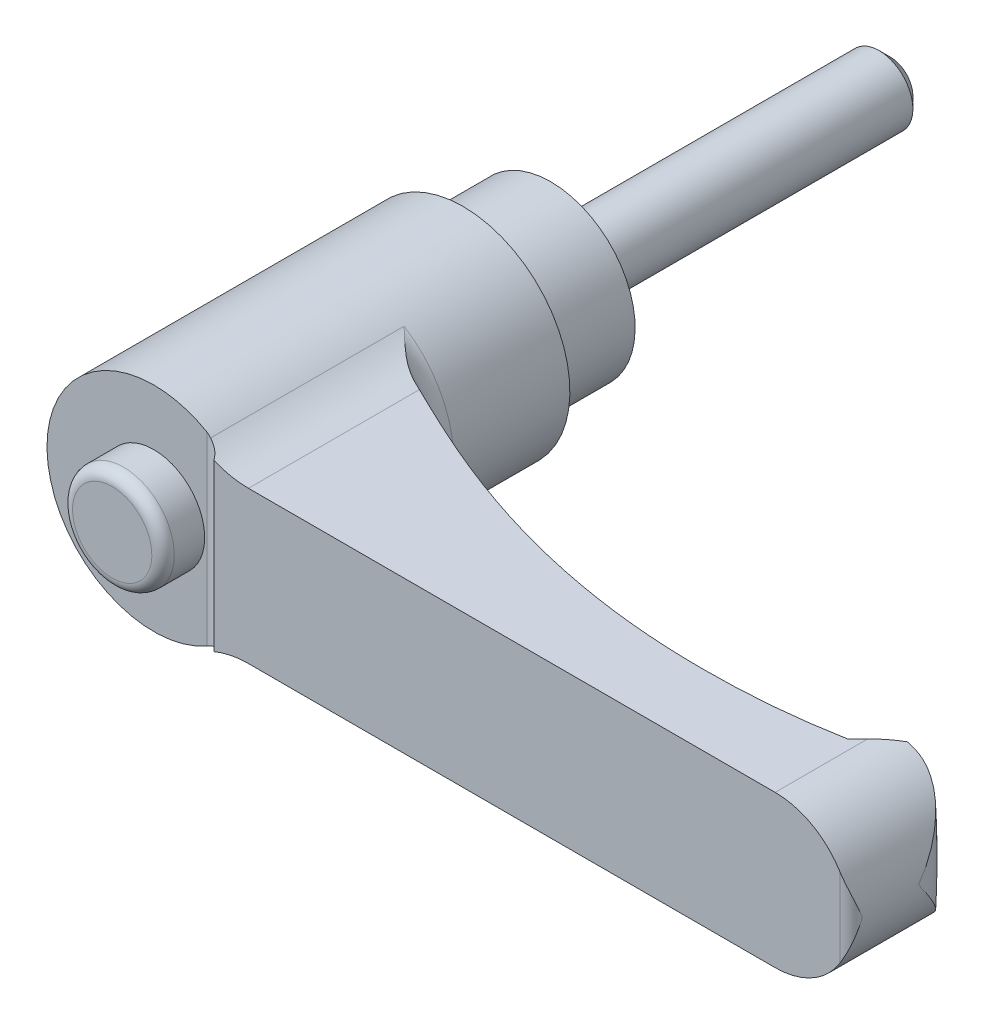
ISO-10303-21;
HEADER;
FILE_DESCRIPTION(('STEP AP214'),'2;1');
FILE_NAME('part.step','',(''),(''),'','','');
FILE_SCHEMA(('AUTOMOTIVE_DESIGN { 1 0 10303 214 1 1 1 1 }'));
ENDSEC;
DATA;
#1=APPLICATION_CONTEXT('core data for automotive mechanical design processes');
#2=APPLICATION_PROTOCOL_DEFINITION('international standard','automotive_design',2000,#1);
#3=PRODUCT_CONTEXT('',#1,'mechanical');
#4=PRODUCT('Part','Part','',(#3));
#5=PRODUCT_RELATED_PRODUCT_CATEGORY('part','',(#4));
#6=PRODUCT_DEFINITION_FORMATION('','',#4);
#7=PRODUCT_DEFINITION_CONTEXT('part definition',#1,'design');
#8=PRODUCT_DEFINITION('design','',#6,#7);
#9=PRODUCT_DEFINITION_SHAPE('','',#8);
#10=(LENGTH_UNIT() NAMED_UNIT(*) SI_UNIT(.MILLI.,.METRE.));
#11=(NAMED_UNIT(*) PLANE_ANGLE_UNIT() SI_UNIT($,.RADIAN.));
#12=(NAMED_UNIT(*) SI_UNIT($,.STERADIAN.) SOLID_ANGLE_UNIT());
#13=UNCERTAINTY_MEASURE_WITH_UNIT(LENGTH_MEASURE(1.E-05),#10,'distance_accuracy_value','');
#14=(GEOMETRIC_REPRESENTATION_CONTEXT(3) GLOBAL_UNCERTAINTY_ASSIGNED_CONTEXT((#13)) GLOBAL_UNIT_ASSIGNED_CONTEXT((#10,
#11,#12)) REPRESENTATION_CONTEXT('',''));
#15=CARTESIAN_POINT('',(0.,0.,0.));
#16=DIRECTION('',(0.,0.,1.));
#17=DIRECTION('',(1.,0.,0.));
#18=AXIS2_PLACEMENT_3D('',#15,#16,#17);
#19=CARTESIAN_POINT('',(6.,0.,0.));
#20=DIRECTION('',(0.,0.,1.));
#21=DIRECTION('',(0.,-1.,0.));
#22=AXIS2_PLACEMENT_3D('',#19,#20,#21);
#23=PLANE('',#22);
#24=CARTESIAN_POINT('',(0.,0.,0.));
#25=DIRECTION('',(0.,0.,-1.));
#26=DIRECTION('',(0.,1.,0.));
#27=AXIS2_PLACEMENT_3D('',#24,#25,#26);
#28=CIRCLE('',#27,3.);
#29=CARTESIAN_POINT('',(0.,3.,0.));
#30=VERTEX_POINT('',#29);
#31=EDGE_CURVE('E423',#30,#30,#28,.T.);
#32=ORIENTED_EDGE('',*,*,#31,.F.);
#33=EDGE_LOOP('',(#32));
#34=FACE_BOUND('',#33,.T.);
#35=CARTESIAN_POINT('',(0.,0.,0.));
#36=DIRECTION('',(0.,0.,-1.));
#37=DIRECTION('',(0.,1.,0.));
#38=AXIS2_PLACEMENT_3D('',#35,#36,#37);
#39=CIRCLE('',#38,6.);
#40=CARTESIAN_POINT('',(0.,6.,0.));
#41=VERTEX_POINT('',#40);
#42=EDGE_CURVE('E347',#41,#41,#39,.T.);
#43=ORIENTED_EDGE('',*,*,#42,.T.);
#44=EDGE_LOOP('',(#43));
#45=FACE_BOUND('',#44,.T.);
#46=ADVANCED_FACE('F14',(#34,#45),#23,.F.);
#47=CARTESIAN_POINT('',(0.,0.,35.5));
#48=DIRECTION('',(0.,0.,-1.));
#49=DIRECTION('',(0.,1.,0.));
#50=AXIS2_PLACEMENT_3D('',#47,#48,#49);
#51=PLANE('',#50);
#52=CARTESIAN_POINT('',(0.,0.,35.5));
#53=DIRECTION('',(0.,0.,-1.));
#54=DIRECTION('',(0.,1.,0.));
#55=AXIS2_PLACEMENT_3D('',#52,#53,#54);
#56=CIRCLE('',#55,9.5);
#57=CARTESIAN_POINT('',(4.75,-8.22724133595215,35.5));
#58=VERTEX_POINT('',#57);
#59=CARTESIAN_POINT('',(4.75,8.22724133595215,35.5));
#60=VERTEX_POINT('',#59);
#61=EDGE_CURVE('E332',#58,#60,#56,.T.);
#62=ORIENTED_EDGE('',*,*,#61,.F.);
#63=DIRECTION('',(0.,1.,0.));
#64=VECTOR('',#63,1.);
#65=CARTESIAN_POINT('',(4.75,-13.5,35.5));
#66=LINE('',#65,#64);
#67=EDGE_CURVE('E383',#58,#60,#66,.T.);
#68=ORIENTED_EDGE('',*,*,#67,.T.);
#69=EDGE_LOOP('',(#62,#68));
#70=FACE_BOUND('',#69,.T.);
#71=CARTESIAN_POINT('',(0.,0.,35.5));
#72=DIRECTION('',(0.,0.,-1.));
#73=DIRECTION('',(0.,1.,0.));
#74=AXIS2_PLACEMENT_3D('',#71,#72,#73);
#75=CIRCLE('',#74,4.52380952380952);
#76=CARTESIAN_POINT('',(0.,4.52380952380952,35.5));
#77=VERTEX_POINT('',#76);
#78=EDGE_CURVE('E183',#77,#77,#75,.F.);
#79=ORIENTED_EDGE('',*,*,#78,.F.);
#80=EDGE_LOOP('',(#79));
#81=FACE_BOUND('',#80,.T.);
#82=ADVANCED_FACE('F158',(#70,#81),#51,.F.);
#83=CARTESIAN_POINT('',(56.25,0.,0.));
#84=DIRECTION('',(0.,0.,1.));
#85=DIRECTION('',(0.,-1.,0.));
#86=AXIS2_PLACEMENT_3D('',#83,#84,#85);
#87=CYLINDRICAL_SURFACE('',#86,6.75);
#88=CARTESIAN_POINT('',(63.,0.,30.5));
#89=CARTESIAN_POINT('',(63.0000000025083,-0.0046874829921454,30.4965903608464));
#90=CARTESIAN_POINT('',(62.9999951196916,-0.0093750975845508,30.4931806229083));
#91=CARTESIAN_POINT('',(62.9990237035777,-0.475524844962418,30.1541065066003));
#92=CARTESIAN_POINT('',(62.9507141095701,-0.938185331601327,29.8175642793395));
#93=CARTESIAN_POINT('',(62.8060463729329,-1.62346497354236,29.3225480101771));
#94=CARTESIAN_POINT('',(62.7456147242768,-1.85084323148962,29.1588881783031));
#95=CARTESIAN_POINT('',(62.6000044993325,-2.30127271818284,28.8365968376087));
#96=CARTESIAN_POINT('',(62.5148384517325,-2.52432607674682,28.6779628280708));
#97=CARTESIAN_POINT('',(62.344804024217,-2.90644000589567,28.4087021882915));
#98=CARTESIAN_POINT('',(62.2657268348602,-3.06692788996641,28.2964051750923));
#99=CARTESIAN_POINT('',(62.0934111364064,-3.38371909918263,28.0768184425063));
#100=CARTESIAN_POINT('',(62.0001726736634,-3.5400224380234,27.9695287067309));
#101=CARTESIAN_POINT('',(61.7993668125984,-3.84715615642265,27.7614384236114));
#102=CARTESIAN_POINT('',(61.6918275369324,-3.99799655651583,27.6606257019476));
#103=CARTESIAN_POINT('',(61.4620426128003,-4.29326696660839,27.4668757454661));
#104=CARTESIAN_POINT('',(61.3398014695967,-4.43769892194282,27.3739361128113));
#105=CARTESIAN_POINT('',(61.0188552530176,-4.78536684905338,27.1560724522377));
#106=CARTESIAN_POINT('',(60.8112818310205,-4.9842025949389,27.0367418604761));
#107=CARTESIAN_POINT('',(60.4758984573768,-5.26551240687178,26.8795376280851));
#108=CARTESIAN_POINT('',(60.3601030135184,-5.35645651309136,26.8307690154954));
#109=CARTESIAN_POINT('',(60.1206554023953,-5.53195453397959,26.7416778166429));
#110=CARTESIAN_POINT('',(59.997005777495,-5.61651049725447,26.7013525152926));
#111=CARTESIAN_POINT('',(59.7699445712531,-5.76076929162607,26.6381973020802));
#112=CARTESIAN_POINT('',(59.667954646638,-5.82188686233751,26.6134697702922));
#113=CARTESIAN_POINT('',(59.4598154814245,-5.93917869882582,26.5707512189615));
#114=CARTESIAN_POINT('',(59.3536672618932,-5.99535416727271,26.5527585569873));
#115=CARTESIAN_POINT('',(59.1377410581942,-6.10229132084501,26.5242546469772));
#116=CARTESIAN_POINT('',(59.0279645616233,-6.15305518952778,26.5137403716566));
#117=CARTESIAN_POINT('',(58.8054681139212,-6.24873887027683,26.5009304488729));
#118=CARTESIAN_POINT('',(58.6927495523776,-6.29366138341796,26.4986309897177));
#119=CARTESIAN_POINT('',(58.4641163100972,-6.37770798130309,26.502966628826));
#120=CARTESIAN_POINT('',(58.3481815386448,-6.41677354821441,26.5096859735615));
#121=CARTESIAN_POINT('',(58.1152313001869,-6.48831686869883,26.5328398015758));
#122=CARTESIAN_POINT('',(57.9982157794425,-6.52079429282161,26.5492747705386));
#123=CARTESIAN_POINT('',(57.7644328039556,-6.57901960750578,26.5923251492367));
#124=CARTESIAN_POINT('',(57.6476652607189,-6.60477054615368,26.618935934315));
#125=CARTESIAN_POINT('',(57.41573023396,-6.64962508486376,26.6826067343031));
#126=CARTESIAN_POINT('',(57.3005622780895,-6.66873068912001,26.7196635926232));
#127=CARTESIAN_POINT('',(57.104290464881,-6.69624244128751,26.7926929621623));
#128=CARTESIAN_POINT('',(57.0224673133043,-6.70614558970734,26.8262017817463));
#129=CARTESIAN_POINT('',(56.8609556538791,-6.72278366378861,26.8986767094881));
#130=CARTESIAN_POINT('',(56.781266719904,-6.72951922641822,26.9376417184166));
#131=CARTESIAN_POINT('',(56.624433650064,-6.74006528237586,27.0209540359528));
#132=CARTESIAN_POINT('',(56.5472927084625,-6.74387222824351,27.0653077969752));
#133=CARTESIAN_POINT('',(56.3961054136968,-6.74884425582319,27.1591719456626));
#134=CARTESIAN_POINT('',(56.3220596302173,-6.75000885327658,27.2086832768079));
#135=CARTESIAN_POINT('',(56.2498,-6.74999999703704,27.2606710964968));
#136=B_SPLINE_CURVE_WITH_KNOTS('',3,(#88,#89,#90,#91,#92,#93,#94,#95,#96,#97,#98,#99,#100,#101,
#102,#103,#104,#105,#106,#107,#108,#109,#110,#111,#112,#113,#114,#115,#116,#117,#118,#119,#120,
#121,#122,#123,#124,#125,#126,#127,#128,#129,#130,#131,#132,#133,#134,#135),.UNSPECIFIED.,.F.,
.F.,(4,2,2,2,2,2,2,2,2,2,2,2,2,2,2,2,2,2,2,2,2,2,2,4),(0.,0.0173896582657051,1.7292315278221,
2.5882674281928,3.44686895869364,4.08007105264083,4.71327107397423,5.34524382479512,
5.97702340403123,6.9068284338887,7.37170994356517,7.83644173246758,8.20045511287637,
8.56437966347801,8.92815681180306,9.29176514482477,9.65879376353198,10.0258407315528,
10.3927210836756,10.7594906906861,11.0261722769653,11.2928002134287,11.5597506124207,
11.8267499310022),.UNSPECIFIED.);
#137=CARTESIAN_POINT('',(58.6622222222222,-6.30425919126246,26.5));
#138=VERTEX_POINT('',#137);
#139=CARTESIAN_POINT('',(63.,0.,30.5));
#140=VERTEX_POINT('',#139);
#141=EDGE_CURVE('E126',#138,#140,#136,.F.);
#142=ORIENTED_EDGE('',*,*,#141,.T.);
#143=CARTESIAN_POINT('',(63.,0.,30.5));
#144=CARTESIAN_POINT('',(63.0000000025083,0.00468748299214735,30.4965903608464));
#145=CARTESIAN_POINT('',(62.9999951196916,0.00937509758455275,30.4931806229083));
#146=CARTESIAN_POINT('',(62.9990237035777,0.47552484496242,30.1541065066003));
#147=CARTESIAN_POINT('',(62.9507141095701,0.938185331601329,29.8175642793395));
#148=CARTESIAN_POINT('',(62.8060463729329,1.62346497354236,29.3225480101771));
#149=CARTESIAN_POINT('',(62.7456147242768,1.85084323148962,29.1588881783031));
#150=CARTESIAN_POINT('',(62.6000044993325,2.30127271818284,28.8365968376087));
#151=CARTESIAN_POINT('',(62.5148384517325,2.52432607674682,28.6779628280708));
#152=CARTESIAN_POINT('',(62.344804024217,2.90644000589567,28.4087021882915));
#153=CARTESIAN_POINT('',(62.2657268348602,3.06692788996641,28.2964051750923));
#154=CARTESIAN_POINT('',(62.0934111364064,3.38371909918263,28.0768184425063));
#155=CARTESIAN_POINT('',(62.0001726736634,3.5400224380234,27.9695287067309));
#156=CARTESIAN_POINT('',(61.7993668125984,3.84715615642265,27.7614384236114));
#157=CARTESIAN_POINT('',(61.6918275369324,3.99799655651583,27.6606257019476));
#158=CARTESIAN_POINT('',(61.4620426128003,4.29326696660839,27.4668757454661));
#159=CARTESIAN_POINT('',(61.3398014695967,4.43769892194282,27.3739361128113));
#160=CARTESIAN_POINT('',(61.0188552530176,4.78536684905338,27.1560724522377));
#161=CARTESIAN_POINT('',(60.8112818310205,4.9842025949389,27.0367418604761));
#162=CARTESIAN_POINT('',(60.4758984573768,5.26551240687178,26.8795376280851));
#163=CARTESIAN_POINT('',(60.3601030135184,5.35645651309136,26.8307690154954));
#164=CARTESIAN_POINT('',(60.1206554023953,5.53195453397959,26.7416778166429));
#165=CARTESIAN_POINT('',(59.997005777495,5.61651049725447,26.7013525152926));
#166=CARTESIAN_POINT('',(59.7699445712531,5.76076929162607,26.6381973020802));
#167=CARTESIAN_POINT('',(59.667954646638,5.82188686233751,26.6134697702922));
#168=CARTESIAN_POINT('',(59.4598154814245,5.93917869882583,26.5707512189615));
#169=CARTESIAN_POINT('',(59.3536672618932,5.99535416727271,26.5527585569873));
#170=CARTESIAN_POINT('',(59.1377410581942,6.10229132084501,26.5242546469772));
#171=CARTESIAN_POINT('',(59.0279645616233,6.15305518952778,26.5137403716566));
#172=CARTESIAN_POINT('',(58.8054681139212,6.24873887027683,26.5009304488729));
#173=CARTESIAN_POINT('',(58.6927495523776,6.29366138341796,26.4986309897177));
#174=CARTESIAN_POINT('',(58.4641163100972,6.37770798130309,26.502966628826));
#175=CARTESIAN_POINT('',(58.3481815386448,6.41677354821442,26.5096859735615));
#176=CARTESIAN_POINT('',(58.1152313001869,6.48831686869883,26.5328398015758));
#177=CARTESIAN_POINT('',(57.9982157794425,6.52079429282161,26.5492747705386));
#178=CARTESIAN_POINT('',(57.7644328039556,6.57901960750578,26.5923251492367));
#179=CARTESIAN_POINT('',(57.6476652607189,6.60477054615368,26.618935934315));
#180=CARTESIAN_POINT('',(57.41573023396,6.64962508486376,26.6826067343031));
#181=CARTESIAN_POINT('',(57.3005622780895,6.66873068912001,26.7196635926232));
#182=CARTESIAN_POINT('',(57.1042904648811,6.69624244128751,26.7926929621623));
#183=CARTESIAN_POINT('',(57.0224673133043,6.70614558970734,26.8262017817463));
#184=CARTESIAN_POINT('',(56.8609556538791,6.72278366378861,26.8986767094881));
#185=CARTESIAN_POINT('',(56.781266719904,6.72951922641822,26.9376417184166));
#186=CARTESIAN_POINT('',(56.624433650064,6.74006528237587,27.0209540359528));
#187=CARTESIAN_POINT('',(56.5472927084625,6.74387222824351,27.0653077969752));
#188=CARTESIAN_POINT('',(56.3961054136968,6.74884425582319,27.1591719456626));
#189=CARTESIAN_POINT('',(56.3220596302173,6.75000885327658,27.2086832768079));
#190=CARTESIAN_POINT('',(56.2498,6.74999999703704,27.2606710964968));
#191=B_SPLINE_CURVE_WITH_KNOTS('',3,(#143,#144,#145,#146,#147,#148,#149,#150,#151,#152,#153,
#154,#155,#156,#157,#158,#159,#160,#161,#162,#163,#164,#165,#166,#167,#168,#169,#170,#171,#172,
#173,#174,#175,#176,#177,#178,#179,#180,#181,#182,#183,#184,#185,#186,#187,#188,#189,#190),
.UNSPECIFIED.,.F.,.F.,(4,2,2,2,2,2,2,2,2,2,2,2,2,2,2,2,2,2,2,2,2,2,2,4),(0.,0.0173896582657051,
1.7292315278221,2.5882674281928,3.44686895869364,4.08007105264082,4.71327107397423,
5.34524382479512,5.97702340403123,6.9068284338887,7.37170994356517,7.83644173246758,
8.20045511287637,8.56437966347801,8.92815681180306,9.29176514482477,9.65879376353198,
10.0258407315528,10.3927210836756,10.7594906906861,11.0261722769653,11.2928002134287,
11.5597506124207,11.8267499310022),.UNSPECIFIED.);
#192=CARTESIAN_POINT('',(58.6622222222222,6.30425919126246,26.5));
#193=VERTEX_POINT('',#192);
#194=EDGE_CURVE('E123',#140,#193,#191,.T.);
#195=ORIENTED_EDGE('',*,*,#194,.T.);
#196=CARTESIAN_POINT('',(56.25,0.,26.5));
#197=DIRECTION('',(0.,0.,-1.));
#198=DIRECTION('',(0.,1.,0.));
#199=AXIS2_PLACEMENT_3D('',#196,#197,#198);
#200=CIRCLE('',#199,6.75);
#201=CARTESIAN_POINT('',(58.,6.51920240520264,26.5));
#202=VERTEX_POINT('',#201);
#203=EDGE_CURVE('E308',#193,#202,#200,.F.);
#204=ORIENTED_EDGE('',*,*,#203,.T.);
#205=CARTESIAN_POINT('',(56.25,0.,28.25));
#206=DIRECTION('',(-0.707106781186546,0.,-0.70710678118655));
#207=DIRECTION('',(-0.70710678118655,0.,0.707106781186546));
#208=AXIS2_PLACEMENT_3D('',#205,#206,#207);
#209=ELLIPSE('',#208,9.54594154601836,6.75);
#210=CARTESIAN_POINT('',(56.25,6.75,28.25));
#211=VERTEX_POINT('',#210);
#212=EDGE_CURVE('E374',#202,#211,#209,.F.);
#213=ORIENTED_EDGE('',*,*,#212,.T.);
#214=DIRECTION('',(0.,0.,1.));
#215=VECTOR('',#214,1.);
#216=CARTESIAN_POINT('',(56.25,6.75,0.));
#217=LINE('',#216,#215);
#218=CARTESIAN_POINT('',(56.25,6.75,36.5));
#219=VERTEX_POINT('',#218);
#220=EDGE_CURVE('E330',#211,#219,#217,.T.);
#221=ORIENTED_EDGE('',*,*,#220,.T.);
#222=CARTESIAN_POINT('',(56.25,0.,36.5));
#223=DIRECTION('',(0.,0.,1.));
#224=DIRECTION('',(0.,-1.,0.));
#225=AXIS2_PLACEMENT_3D('',#222,#223,#224);
#226=CIRCLE('',#225,6.75);
#227=CARTESIAN_POINT('',(62.,3.53553390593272,36.5));
#228=VERTEX_POINT('',#227);
#229=EDGE_CURVE('E322',#228,#219,#226,.T.);
#230=ORIENTED_EDGE('',*,*,#229,.F.);
#231=CARTESIAN_POINT('',(62.,3.53553390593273,36.5));
#232=CARTESIAN_POINT('',(62.0299932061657,3.48675666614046,36.4999933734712));
#233=CARTESIAN_POINT('',(62.0593538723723,3.43761273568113,36.4986515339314));
#234=CARTESIAN_POINT('',(62.1167538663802,3.33870692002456,36.4935798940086));
#235=CARTESIAN_POINT('',(62.1447937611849,3.28894531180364,36.489851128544));
#236=CARTESIAN_POINT('',(62.2267562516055,3.13908056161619,36.4755285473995));
#237=CARTESIAN_POINT('',(62.2786643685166,3.03816514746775,36.4617957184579));
#238=CARTESIAN_POINT('',(62.3766467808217,2.83536966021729,36.4277987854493));
#239=CARTESIAN_POINT('',(62.4227515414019,2.73349792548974,36.4075709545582));
#240=CARTESIAN_POINT('',(62.509502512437,2.52854152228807,36.3618646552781));
#241=CARTESIAN_POINT('',(62.550144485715,2.42545597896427,36.3363821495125));
#242=CARTESIAN_POINT('',(62.6493297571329,2.15471359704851,36.2642737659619));
#243=CARTESIAN_POINT('',(62.7035065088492,1.98634279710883,36.2142841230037));
#244=CARTESIAN_POINT('',(62.7980553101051,1.64812969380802,36.1068184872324));
#245=CARTESIAN_POINT('',(62.8384218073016,1.4782868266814,36.0493394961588));
#246=CARTESIAN_POINT('',(62.9057483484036,1.1374266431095,35.9293690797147));
#247=CARTESIAN_POINT('',(62.9326868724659,0.966407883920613,35.8668697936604));
#248=CARTESIAN_POINT('',(62.9733111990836,0.623942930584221,35.7390768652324));
#249=CARTESIAN_POINT('',(62.9870036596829,0.452496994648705,35.6737846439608));
#250=CARTESIAN_POINT('',(62.997837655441,0.192449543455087,35.5740662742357));
#251=CARTESIAN_POINT('',(62.999781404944,0.103891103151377,35.539987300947));
#252=CARTESIAN_POINT('',(62.9999941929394,0.0102233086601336,35.5039349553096));
#253=CARTESIAN_POINT('',(62.9999999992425,0.00511164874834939,35.5019674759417));
#254=CARTESIAN_POINT('',(63.,0.,35.5));
#255=B_SPLINE_CURVE_WITH_KNOTS('',3,(#231,#232,#233,#234,#235,#236,#237,#238,#239,#240,#241,
#242,#243,#244,#245,#246,#247,#248,#249,#250,#251,#252,#253,#254),.UNSPECIFIED.,.F.,.F.,(4,2,2,
2,2,2,2,2,2,2,2,4),(0.,0.171732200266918,0.343389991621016,0.685890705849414,1.02651095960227,
1.36739390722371,1.91796289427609,2.46875297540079,3.02042294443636,3.57181547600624,
3.85648313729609,3.87291482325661),.UNSPECIFIED.);
#256=CARTESIAN_POINT('',(63.,0.,35.5));
#257=VERTEX_POINT('',#256);
#258=EDGE_CURVE('E169',#257,#228,#255,.F.);
#259=ORIENTED_EDGE('',*,*,#258,.F.);
#260=CARTESIAN_POINT('',(62.,-3.53553390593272,36.5));
#261=CARTESIAN_POINT('',(62.0299932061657,-3.48675666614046,36.4999933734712));
#262=CARTESIAN_POINT('',(62.0593538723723,-3.43761273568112,36.4986515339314));
#263=CARTESIAN_POINT('',(62.1167538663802,-3.33870692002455,36.4935798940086));
#264=CARTESIAN_POINT('',(62.1447937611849,-3.28894531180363,36.489851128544));
#265=CARTESIAN_POINT('',(62.2267562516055,-3.13908056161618,36.4755285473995));
#266=CARTESIAN_POINT('',(62.2786643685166,-3.03816514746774,36.4617957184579));
#267=CARTESIAN_POINT('',(62.3766467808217,-2.83536966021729,36.4277987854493));
#268=CARTESIAN_POINT('',(62.4227515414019,-2.73349792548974,36.4075709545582));
#269=CARTESIAN_POINT('',(62.509502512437,-2.52854152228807,36.3618646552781));
#270=CARTESIAN_POINT('',(62.550144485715,-2.42545597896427,36.3363821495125));
#271=CARTESIAN_POINT('',(62.6493297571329,-2.15471359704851,36.2642737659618));
#272=CARTESIAN_POINT('',(62.7035065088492,-1.98634279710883,36.2142841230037));
#273=CARTESIAN_POINT('',(62.7980553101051,-1.64812969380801,36.1068184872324));
#274=CARTESIAN_POINT('',(62.8384218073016,-1.4782868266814,36.0493394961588));
#275=CARTESIAN_POINT('',(62.9057483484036,-1.1374266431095,35.9293690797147));
#276=CARTESIAN_POINT('',(62.9326868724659,-0.966407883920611,35.8668697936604));
#277=CARTESIAN_POINT('',(62.9733111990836,-0.623942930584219,35.7390768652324));
#278=CARTESIAN_POINT('',(62.9870036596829,-0.452496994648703,35.6737846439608));
#279=CARTESIAN_POINT('',(62.997837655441,-0.192449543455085,35.5740662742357));
#280=CARTESIAN_POINT('',(62.999781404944,-0.103891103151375,35.539987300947));
#281=CARTESIAN_POINT('',(62.9999941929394,-0.0102233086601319,35.5039349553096));
#282=CARTESIAN_POINT('',(62.9999999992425,-0.00511164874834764,35.5019674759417));
#283=CARTESIAN_POINT('',(63.,0.,35.5));
#284=B_SPLINE_CURVE_WITH_KNOTS('',3,(#260,#261,#262,#263,#264,#265,#266,#267,#268,#269,#270,
#271,#272,#273,#274,#275,#276,#277,#278,#279,#280,#281,#282,#283),.UNSPECIFIED.,.F.,.F.,(4,2,2,
2,2,2,2,2,2,2,2,4),(0.,0.171732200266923,0.34338999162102,0.685890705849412,1.02651095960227,
1.36739390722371,1.91796289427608,2.46875297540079,3.02042294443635,3.57181547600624,
3.85648313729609,3.8729148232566),.UNSPECIFIED.);
#285=CARTESIAN_POINT('',(62.,-3.53553390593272,36.5));
#286=VERTEX_POINT('',#285);
#287=EDGE_CURVE('E177',#286,#257,#284,.T.);
#288=ORIENTED_EDGE('',*,*,#287,.F.);
#289=CARTESIAN_POINT('',(56.25,-6.75,36.5));
#290=VERTEX_POINT('',#289);
#291=EDGE_CURVE('E310',#290,#286,#226,.T.);
#292=ORIENTED_EDGE('',*,*,#291,.F.);
#293=DIRECTION('',(0.,0.,1.));
#294=VECTOR('',#293,1.);
#295=CARTESIAN_POINT('',(56.25,-6.75,0.));
#296=LINE('',#295,#294);
#297=CARTESIAN_POINT('',(56.25,-6.75,28.25));
#298=VERTEX_POINT('',#297);
#299=EDGE_CURVE('E355',#298,#290,#296,.T.);
#300=ORIENTED_EDGE('',*,*,#299,.F.);
#301=CARTESIAN_POINT('',(58.,-6.51920240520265,26.5));
#302=VERTEX_POINT('',#301);
#303=EDGE_CURVE('E375',#298,#302,#209,.F.);
#304=ORIENTED_EDGE('',*,*,#303,.T.);
#305=EDGE_CURVE('E134',#302,#138,#200,.F.);
#306=ORIENTED_EDGE('',*,*,#305,.T.);
#307=EDGE_LOOP('',(#142,#195,#204,#213,#221,#230,#259,#288,#292,#300,#304,#306));
#308=FACE_BOUND('',#307,.T.);
#309=ADVANCED_FACE('F132',(#308),#87,.T.);
#310=CARTESIAN_POINT('',(59.,-13.5,26.5));
#311=DIRECTION('',(0.,0.,-1.));
#312=DIRECTION('',(0.,1.,0.));
#313=AXIS2_PLACEMENT_3D('',#310,#311,#312);
#314=PLANE('',#313);
#315=ORIENTED_EDGE('',*,*,#203,.F.);
#316=CARTESIAN_POINT('',(0.,0.,26.5));
#317=DIRECTION('',(0.,0.,-1.));
#318=DIRECTION('',(0.,1.,0.));
#319=AXIS2_PLACEMENT_3D('',#316,#317,#318);
#320=CIRCLE('',#319,59.);
#321=EDGE_CURVE('E37',#193,#138,#320,.T.);
#322=ORIENTED_EDGE('',*,*,#321,.T.);
#323=ORIENTED_EDGE('',*,*,#305,.F.);
#324=DIRECTION('',(0.,1.,0.));
#325=VECTOR('',#324,1.);
#326=CARTESIAN_POINT('',(58.,-13.5,26.5));
#327=LINE('',#326,#325);
#328=EDGE_CURVE('E327',#302,#202,#327,.T.);
#329=ORIENTED_EDGE('',*,*,#328,.T.);
#330=EDGE_LOOP('',(#315,#322,#323,#329));
#331=FACE_BOUND('',#330,.T.);
#332=ADVANCED_FACE('F157',(#331),#314,.T.);
#333=CARTESIAN_POINT('',(0.,0.,36.5));
#334=DIRECTION('',(0.,0.,1.));
#335=DIRECTION('',(0.,-1.,0.));
#336=AXIS2_PLACEMENT_3D('',#333,#334,#335);
#337=PLANE('',#336);
#338=CARTESIAN_POINT('',(9.41740410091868,14.75,36.5));
#339=DIRECTION('',(0.,0.,1.));
#340=DIRECTION('',(1.,0.,0.));
#341=AXIS2_PLACEMENT_3D('',#338,#339,#340);
#342=CIRCLE('',#341,8.);
#343=CARTESIAN_POINT('',(6.33333333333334,7.36836688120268,36.5));
#344=VERTEX_POINT('',#343);
#345=CARTESIAN_POINT('',(9.41740410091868,6.75,36.5));
#346=VERTEX_POINT('',#345);
#347=EDGE_CURVE('E369',#344,#346,#342,.T.);
#348=ORIENTED_EDGE('',*,*,#347,.F.);
#349=DIRECTION('',(0.,1.,0.));
#350=VECTOR('',#349,1.);
#351=CARTESIAN_POINT('',(6.33333333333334,-13.5,36.5));
#352=LINE('',#351,#350);
#353=CARTESIAN_POINT('',(6.33333333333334,-7.36836688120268,36.5));
#354=VERTEX_POINT('',#353);
#355=EDGE_CURVE('E326',#354,#344,#352,.T.);
#356=ORIENTED_EDGE('',*,*,#355,.F.);
#357=CARTESIAN_POINT('',(9.41740410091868,-14.75,36.5));
#358=DIRECTION('',(0.,0.,1.));
#359=DIRECTION('',(1.,0.,0.));
#360=AXIS2_PLACEMENT_3D('',#357,#358,#359);
#361=CIRCLE('',#360,8.);
#362=CARTESIAN_POINT('',(9.41740410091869,-6.75,36.5));
#363=VERTEX_POINT('',#362);
#364=EDGE_CURVE('E361',#363,#354,#361,.T.);
#365=ORIENTED_EDGE('',*,*,#364,.F.);
#366=DIRECTION('',(-1.,0.,0.));
#367=VECTOR('',#366,1.);
#368=CARTESIAN_POINT('',(56.25,-6.75,36.5));
#369=LINE('',#368,#367);
#370=EDGE_CURVE('E364',#290,#363,#369,.T.);
#371=ORIENTED_EDGE('',*,*,#370,.F.);
#372=ORIENTED_EDGE('',*,*,#291,.T.);
#373=DIRECTION('',(0.,1.,0.));
#374=VECTOR('',#373,1.);
#375=CARTESIAN_POINT('',(62.,-13.5,36.5));
#376=LINE('',#375,#374);
#377=EDGE_CURVE('E315',#286,#228,#376,.T.);
#378=ORIENTED_EDGE('',*,*,#377,.T.);
#379=ORIENTED_EDGE('',*,*,#229,.T.);
#380=DIRECTION('',(1.,0.,0.));
#381=VECTOR('',#380,1.);
#382=CARTESIAN_POINT('',(9.41740410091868,6.75,36.5));
#383=LINE('',#382,#381);
#384=EDGE_CURVE('E367',#346,#219,#383,.T.);
#385=ORIENTED_EDGE('',*,*,#384,.F.);
#386=EDGE_LOOP('',(#348,#356,#365,#371,#372,#378,#379,#385));
#387=FACE_BOUND('',#386,.T.);
#388=ADVANCED_FACE('F240',(#387),#337,.T.);
#389=CARTESIAN_POINT('',(0.,0.,0.));
#390=DIRECTION('',(0.,0.,-1.));
#391=DIRECTION('',(0.,1.,0.));
#392=AXIS2_PLACEMENT_3D('',#389,#390,#391);
#393=CYLINDRICAL_SURFACE('',#392,9.5);
#394=CARTESIAN_POINT('',(0.,0.,18.3481601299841));
#395=DIRECTION('',(0.,0.,-1.));
#396=DIRECTION('',(0.,1.,0.));
#397=AXIS2_PLACEMENT_3D('',#394,#395,#396);
#398=CIRCLE('',#397,9.5);
#399=CARTESIAN_POINT('',(5.11230508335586,8.00714285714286,18.3481601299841));
#400=VERTEX_POINT('',#399);
#401=CARTESIAN_POINT('',(5.11230508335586,-8.00714285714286,18.3481601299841));
#402=VERTEX_POINT('',#401);
#403=EDGE_CURVE('E413',#400,#402,#398,.T.);
#404=ORIENTED_EDGE('',*,*,#403,.T.);
#405=DIRECTION('',(0.,0.,1.));
#406=VECTOR('',#405,1.);
#407=CARTESIAN_POINT('',(5.11230508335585,-8.00714285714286,0.));
#408=LINE('',#407,#406);
#409=CARTESIAN_POINT('',(5.11230508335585,-8.00714285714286,35.5614827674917));
#410=VERTEX_POINT('',#409);
#411=EDGE_CURVE('E359',#402,#410,#408,.T.);
#412=ORIENTED_EDGE('',*,*,#411,.T.);
#413=CARTESIAN_POINT('',(4.75,-8.22724133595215,35.5));
#414=CARTESIAN_POINT('',(4.82354897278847,-8.18479174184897,35.5056127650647));
#415=CARTESIAN_POINT('',(4.89626028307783,-8.1414834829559,35.5152432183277));
#416=CARTESIAN_POINT('',(5.03945202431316,-8.05362753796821,35.5421901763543));
#417=CARTESIAN_POINT('',(5.10993308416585,-8.00908020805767,35.5595044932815));
#418=CARTESIAN_POINT('',(5.24861636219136,-7.91889687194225,35.6016146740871));
#419=CARTESIAN_POINT('',(5.31680005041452,-7.87325555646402,35.6264601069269));
#420=CARTESIAN_POINT('',(5.44990684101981,-7.7817124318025,35.6832973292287));
#421=CARTESIAN_POINT('',(5.51483003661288,-7.7358106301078,35.7152889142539));
#422=CARTESIAN_POINT('',(5.69141984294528,-7.6077148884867,35.8145402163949));
#423=CARTESIAN_POINT('',(5.79903338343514,-7.52579740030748,35.8895684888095));
#424=CARTESIAN_POINT('',(5.99917718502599,-7.36722875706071,36.0610902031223));
#425=CARTESIAN_POINT('',(6.09178179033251,-7.29055280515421,36.157471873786));
#426=CARTESIAN_POINT('',(6.20382113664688,-7.19472379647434,36.3011658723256));
#427=CARTESIAN_POINT('',(6.23139044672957,-7.17084441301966,36.33916914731));
#428=CARTESIAN_POINT('',(6.28417716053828,-7.12462925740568,36.4176957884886));
#429=CARTESIAN_POINT('',(6.30939340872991,-7.1022942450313,36.4582203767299));
#430=CARTESIAN_POINT('',(6.33333333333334,-7.08088192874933,36.5));
#431=B_SPLINE_CURVE_WITH_KNOTS('',3,(#413,#414,#415,#416,#417,#418,#419,#420,#421,#422,#423,
#424,#425,#426,#427,#428,#429,#430),.UNSPECIFIED.,.F.,.F.,(4,2,2,2,2,2,2,2,4),(0.,
0.25516766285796,0.510262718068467,0.767074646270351,1.02387922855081,1.48566336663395,
1.94508518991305,2.10299549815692,2.26098294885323),.UNSPECIFIED.);
#432=EDGE_CURVE('E214',#58,#410,#431,.T.);
#433=ORIENTED_EDGE('',*,*,#432,.F.);
#434=ORIENTED_EDGE('',*,*,#61,.T.);
#435=CARTESIAN_POINT('',(6.33333333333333,7.08088192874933,36.5));
#436=CARTESIAN_POINT('',(6.30193651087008,7.10896982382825,36.4452145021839));
#437=CARTESIAN_POINT('',(6.26833956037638,7.13863883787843,36.3925689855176));
#438=CARTESIAN_POINT('',(6.19723055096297,7.20045324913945,36.2916619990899));
#439=CARTESIAN_POINT('',(6.15972345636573,7.23259549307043,36.243395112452));
#440=CARTESIAN_POINT('',(6.08131079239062,7.2986494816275,36.1513438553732));
#441=CARTESIAN_POINT('',(6.04041526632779,7.33255589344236,36.1075470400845));
#442=CARTESIAN_POINT('',(5.95546899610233,7.40171574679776,36.0242830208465));
#443=CARTESIAN_POINT('',(5.91141716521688,7.4369696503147,35.9848173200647));
#444=CARTESIAN_POINT('',(5.7754647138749,7.54368484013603,35.8733623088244));
#445=CARTESIAN_POINT('',(5.67929205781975,7.61650473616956,35.8077657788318));
#446=CARTESIAN_POINT('',(5.47750803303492,7.76289095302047,35.6942705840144));
#447=CARTESIAN_POINT('',(5.37189158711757,7.83645765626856,35.6463815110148));
#448=CARTESIAN_POINT('',(5.1806466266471,7.96370194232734,35.5790108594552));
#449=CARTESIAN_POINT('',(5.09668204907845,8.01772299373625,35.5554125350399));
#450=CARTESIAN_POINT('',(4.92555498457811,8.12398585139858,35.5192948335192));
#451=CARTESIAN_POINT('',(4.83839896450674,8.17623088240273,35.5067542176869));
#452=CARTESIAN_POINT('',(4.75,8.22724133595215,35.5));
#453=B_SPLINE_CURVE_WITH_KNOTS('',3,(#435,#436,#437,#438,#439,#440,#441,#442,#443,#444,#445,
#446,#447,#448,#449,#450,#451,#452),.UNSPECIFIED.,.F.,.F.,(4,2,2,2,2,2,2,2,4),(0.,
0.207163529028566,0.414067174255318,0.620378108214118,0.826760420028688,1.23705708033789,
1.64757566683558,1.9547198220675,2.26127274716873),.UNSPECIFIED.);
#454=CARTESIAN_POINT('',(5.11230508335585,8.00714285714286,35.5614827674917));
#455=VERTEX_POINT('',#454);
#456=EDGE_CURVE('E228',#455,#60,#453,.T.);
#457=ORIENTED_EDGE('',*,*,#456,.F.);
#458=DIRECTION('',(0.,0.,1.));
#459=VECTOR('',#458,1.);
#460=CARTESIAN_POINT('',(5.11230508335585,8.00714285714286,0.));
#461=LINE('',#460,#459);
#462=EDGE_CURVE('E350',#400,#455,#461,.T.);
#463=ORIENTED_EDGE('',*,*,#462,.F.);
#464=EDGE_LOOP('',(#404,#412,#433,#434,#457,#463));
#465=FACE_BOUND('',#464,.T.);
#466=CARTESIAN_POINT('',(0.,0.,8.));
#467=DIRECTION('',(0.,0.,-1.));
#468=DIRECTION('',(0.,1.,0.));
#469=AXIS2_PLACEMENT_3D('',#466,#467,#468);
#470=CIRCLE('',#469,9.5);
#471=CARTESIAN_POINT('',(0.,9.5,8.));
#472=VERTEX_POINT('',#471);
#473=EDGE_CURVE('E333',#472,#472,#470,.T.);
#474=ORIENTED_EDGE('',*,*,#473,.F.);
#475=EDGE_LOOP('',(#474));
#476=FACE_BOUND('',#475,.T.);
#477=ADVANCED_FACE('F238',(#465,#476),#393,.T.);
#478=CARTESIAN_POINT('',(9.41740410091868,14.75,0.));
#479=DIRECTION('',(0.,0.,1.));
#480=DIRECTION('',(0.,-1.,0.));
#481=AXIS2_PLACEMENT_3D('',#478,#479,#480);
#482=CYLINDRICAL_SURFACE('',#481,8.);
#483=DIRECTION('',(0.,0.,1.));
#484=VECTOR('',#483,1.);
#485=CARTESIAN_POINT('',(9.41740410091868,6.75,0.));
#486=LINE('',#485,#484);
#487=CARTESIAN_POINT('',(9.41740410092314,6.75,21.3021638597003));
#488=VERTEX_POINT('',#487);
#489=EDGE_CURVE('E352',#488,#346,#486,.T.);
#490=ORIENTED_EDGE('',*,*,#489,.F.);
#491=CARTESIAN_POINT('',(9.41760410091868,6.7500000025,21.3022609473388));
#492=CARTESIAN_POINT('',(9.34663199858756,6.74999859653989,21.2678090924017));
#493=CARTESIAN_POINT('',(9.27552780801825,6.75094090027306,21.2336266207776));
#494=CARTESIAN_POINT('',(9.13312349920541,6.75473540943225,21.1659081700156));
#495=CARTESIAN_POINT('',(9.06182355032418,6.75758629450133,21.1323717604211));
#496=CARTESIAN_POINT('',(8.91899698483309,6.7652204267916,21.066004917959));
#497=CARTESIAN_POINT('',(8.84747036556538,6.77000369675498,21.0331744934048));
#498=CARTESIAN_POINT('',(8.704162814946,6.78153362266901,20.9682923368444));
#499=CARTESIAN_POINT('',(8.63238174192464,6.78828163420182,20.9362411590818));
#500=CARTESIAN_POINT('',(8.56050869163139,6.79602424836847,20.9046385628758));
#501=B_SPLINE_CURVE_WITH_KNOTS('',3,(#491,#492,#493,#494,#495,#496,#497,#498,#499,#500),
.UNSPECIFIED.,.F.,.F.,(4,2,2,2,4),(0.,0.236671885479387,0.473180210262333,0.709691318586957,
0.946365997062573),.UNSPECIFIED.);
#502=CARTESIAN_POINT('',(8.56096354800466,6.79597525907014,20.9048385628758));
#503=VERTEX_POINT('',#502);
#504=EDGE_CURVE('E246',#488,#503,#501,.T.);
#505=ORIENTED_EDGE('',*,*,#504,.T.);
#506=CARTESIAN_POINT('',(8.56141843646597,6.79592629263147,20.9050385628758));
#507=CARTESIAN_POINT('',(8.47420918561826,6.80531273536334,20.8666951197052));
#508=CARTESIAN_POINT('',(8.38798367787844,6.81604134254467,20.8265142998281));
#509=CARTESIAN_POINT('',(8.21753113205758,6.84002445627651,20.7428900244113));
#510=CARTESIAN_POINT('',(8.13330325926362,6.85327788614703,20.6994479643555));
#511=CARTESIAN_POINT('',(7.88393651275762,6.89653514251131,20.5650030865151));
#512=CARTESIAN_POINT('',(7.72171249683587,6.9300806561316,20.4697011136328));
#513=CARTESIAN_POINT('',(7.40583761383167,7.00533652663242,20.2709379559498));
#514=CARTESIAN_POINT('',(7.25214096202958,7.0469964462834,20.1675294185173));
#515=CARTESIAN_POINT('',(6.95163567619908,7.13786246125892,19.9540740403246));
#516=CARTESIAN_POINT('',(6.80483124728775,7.18707308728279,19.8440232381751));
#517=CARTESIAN_POINT('',(6.52235248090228,7.29074005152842,19.6227797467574));
#518=CARTESIAN_POINT('',(6.38647079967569,7.34497015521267,19.5117441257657));
#519=CARTESIAN_POINT('',(6.12012077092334,7.45966750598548,19.286442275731));
#520=CARTESIAN_POINT('',(5.98965290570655,7.5201353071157,19.1721757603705));
#521=CARTESIAN_POINT('',(5.73356790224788,7.64719834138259,18.9415280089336));
#522=CARTESIAN_POINT('',(5.60795285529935,7.71379617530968,18.825145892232));
#523=CARTESIAN_POINT('',(5.36116691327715,7.853115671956,18.5913699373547));
#524=CARTESIAN_POINT('',(5.23999538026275,7.92583645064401,18.4739762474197));
#525=CARTESIAN_POINT('',(5.11800178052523,8.00350824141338,18.3537764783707));
#526=CARTESIAN_POINT('',(5.11515285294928,8.00532465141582,18.3509683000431));
#527=CARTESIAN_POINT('',(5.11230508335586,8.00714285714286,18.3481601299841));
#528=B_SPLINE_CURVE_WITH_KNOTS('',3,(#506,#507,#508,#509,#510,#511,#512,#513,#514,#515,#516,
#517,#518,#519,#520,#521,#522,#523,#524,#525,#526,#527),.UNSPECIFIED.,.F.,.F.,(4,2,2,2,2,2,2,2,
2,2,4),(0.,0.287104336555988,0.574086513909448,1.14672714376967,1.7159158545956,
2.28544744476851,2.83621563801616,3.38703279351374,3.93808473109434,4.48905724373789,
4.50223731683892),.UNSPECIFIED.);
#529=EDGE_CURVE('E393',#503,#400,#528,.T.);
#530=ORIENTED_EDGE('',*,*,#529,.T.);
#531=ORIENTED_EDGE('',*,*,#462,.T.);
#532=CARTESIAN_POINT('',(6.33333333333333,7.36836688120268,36.5));
#533=CARTESIAN_POINT('',(6.30572631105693,7.37990157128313,36.4517939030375));
#534=CARTESIAN_POINT('',(6.27620115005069,7.39241872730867,36.4049318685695));
#535=CARTESIAN_POINT('',(6.21369042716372,7.41942165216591,36.3142041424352));
#536=CARTESIAN_POINT('',(6.18070621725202,7.433906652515,36.2703372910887));
#537=CARTESIAN_POINT('',(6.11180020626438,7.46478219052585,36.1860768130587));
#538=CARTESIAN_POINT('',(6.07589356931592,7.48116305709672,36.1456672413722));
#539=CARTESIAN_POINT('',(6.001409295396,7.51586753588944,36.0683091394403));
#540=CARTESIAN_POINT('',(5.96283154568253,7.53419123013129,36.0313607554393));
#541=CARTESIAN_POINT('',(5.84377892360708,7.59200134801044,35.9260570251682));
#542=CARTESIAN_POINT('',(5.75985492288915,7.63438377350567,35.8630866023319));
#543=CARTESIAN_POINT('',(5.58613979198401,7.72639161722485,35.7523382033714));
#544=CARTESIAN_POINT('',(5.49634385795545,7.77602300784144,35.7045728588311));
#545=CARTESIAN_POINT('',(5.35683601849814,7.85689272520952,35.6430239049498));
#546=CARTESIAN_POINT('',(5.30809845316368,7.88582630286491,35.6238148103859));
#547=CARTESIAN_POINT('',(5.21035384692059,7.94529574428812,35.5895762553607));
#548=CARTESIAN_POINT('',(5.1613480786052,7.975826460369,35.5745342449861));
#549=CARTESIAN_POINT('',(5.11230508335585,8.00714285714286,35.5614827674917));
#550=B_SPLINE_CURVE_WITH_KNOTS('',3,(#532,#533,#534,#535,#536,#537,#538,#539,#540,#541,#542,
#543,#544,#545,#546,#547,#548,#549),.UNSPECIFIED.,.F.,.F.,(4,2,2,2,2,2,2,2,4),(0.,
0.170139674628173,0.340213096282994,0.50945430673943,0.678702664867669,1.01657399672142,
1.35472528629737,1.53411415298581,1.7129567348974),.UNSPECIFIED.);
#551=EDGE_CURVE('E222',#344,#455,#550,.T.);
#552=ORIENTED_EDGE('',*,*,#551,.F.);
#553=ORIENTED_EDGE('',*,*,#347,.T.);
#554=EDGE_LOOP('',(#490,#505,#530,#531,#552,#553));
#555=FACE_BOUND('',#554,.T.);
#556=ADVANCED_FACE('F234',(#555),#482,.F.);
#557=CARTESIAN_POINT('',(9.41740410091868,6.75,0.));
#558=DIRECTION('',(0.,-1.,0.));
#559=DIRECTION('',(1.,0.,0.));
#560=AXIS2_PLACEMENT_3D('',#557,#558,#559);
#561=PLANE('',#560);
#562=CARTESIAN_POINT('',(43.8904150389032,6.75,-32.7854085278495));
#563=DIRECTION('',(0.,-1.,0.));
#564=DIRECTION('',(1.,0.,0.));
#565=AXIS2_PLACEMENT_3D('',#562,#563,#564);
#566=CIRCLE('',#565,63.);
#567=CARTESIAN_POINT('',(43.630890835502,6.75000000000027,30.2140569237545));
#568=VERTEX_POINT('',#567);
#569=CARTESIAN_POINT('',(55.3333333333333,6.75,29.1666666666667));
#570=VERTEX_POINT('',#569);
#571=EDGE_CURVE('E376',#568,#570,#566,.F.);
#572=ORIENTED_EDGE('',*,*,#571,.F.);
#573=CARTESIAN_POINT('',(31.7211018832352,6.75,29.163677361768));
#574=CARTESIAN_POINT('',(30.4815814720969,6.75,28.9394124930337));
#575=CARTESIAN_POINT('',(29.248337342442,6.75,28.6800208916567));
#576=CARTESIAN_POINT('',(26.798292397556,6.75,28.093381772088));
#577=CARTESIAN_POINT('',(25.5814894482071,6.75,27.7661431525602));
#578=CARTESIAN_POINT('',(23.7726077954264,6.75,27.2275084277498));
#579=CARTESIAN_POINT('',(23.1732161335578,6.75,27.0403034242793));
#580=CARTESIAN_POINT('',(21.9794838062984,6.75,26.6504397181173));
#581=CARTESIAN_POINT('',(21.3851430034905,6.75,26.4477814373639));
#582=CARTESIAN_POINT('',(20.20172109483,6.75,26.027681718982));
#583=CARTESIAN_POINT('',(19.6126399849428,6.75,25.8102402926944));
#584=CARTESIAN_POINT('',(18.4398233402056,6.75,25.3614109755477));
#585=CARTESIAN_POINT('',(17.8560877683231,6.75,25.1300231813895));
#586=CARTESIAN_POINT('',(16.8264520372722,6.75,24.7086305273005));
#587=CARTESIAN_POINT('',(16.3794839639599,6.75,24.5212256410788));
#588=CARTESIAN_POINT('',(15.4885644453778,6.75,24.1393775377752));
#589=CARTESIAN_POINT('',(15.0446130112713,6.75,23.9449342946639));
#590=CARTESIAN_POINT('',(14.1595159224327,6.75,23.5498036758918));
#591=CARTESIAN_POINT('',(13.7183701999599,6.75,23.3491164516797));
#592=CARTESIAN_POINT('',(12.8384969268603,6.75,22.9425083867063));
#593=CARTESIAN_POINT('',(12.3997694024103,6.75,22.7365874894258));
#594=CARTESIAN_POINT('',(11.5213847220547,6.75,22.3195357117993));
#595=CARTESIAN_POINT('',(11.0817393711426,6.75,22.1083800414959));
#596=CARTESIAN_POINT('',(10.2034650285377,6.75,21.6840048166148));
#597=CARTESIAN_POINT('',(9.76483601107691,6.75,21.4707853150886));
#598=CARTESIAN_POINT('',(8.88741279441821,6.75,21.0449308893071));
#599=CARTESIAN_POINT('',(8.4486186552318,6.75,20.832295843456));
#600=CARTESIAN_POINT('',(7.7888040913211,6.75,20.5166390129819));
#601=CARTESIAN_POINT('',(7.56857842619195,6.75,20.4119614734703));
#602=CARTESIAN_POINT('',(7.12729129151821,6.75,20.2043820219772));
#603=CARTESIAN_POINT('',(6.90622982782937,6.75,20.1014800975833));
#604=CARTESIAN_POINT('',(6.48691851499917,6.75,19.9092503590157));
#605=CARTESIAN_POINT('',(6.28878981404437,6.75,19.8196589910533));
#606=CARTESIAN_POINT('',(5.89131318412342,6.75,19.6432260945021));
#607=CARTESIAN_POINT('',(5.69196528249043,6.75,19.5563845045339));
#608=CARTESIAN_POINT('',(5.29178648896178,6.75,19.3863184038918));
#609=CARTESIAN_POINT('',(5.09095599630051,6.75,19.3030929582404));
#610=CARTESIAN_POINT('',(4.68744730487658,6.75,19.1412674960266));
#611=CARTESIAN_POINT('',(4.48476921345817,6.75,19.0626672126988));
#612=CARTESIAN_POINT('',(4.07928382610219,6.75,18.9120884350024));
#613=CARTESIAN_POINT('',(3.87649877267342,6.75,18.8400507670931));
#614=CARTESIAN_POINT('',(3.46854334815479,6.75,18.7031281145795));
#615=CARTESIAN_POINT('',(3.26337283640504,6.75,18.6382435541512));
#616=CARTESIAN_POINT('',(2.64418711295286,6.75,18.4568464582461));
#617=CARTESIAN_POINT('',(2.22603982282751,6.75,18.3534128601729));
#618=CARTESIAN_POINT('',(1.65420364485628,6.75,18.2467177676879));
#619=CARTESIAN_POINT('',(1.50442360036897,6.75,18.2219398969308));
#620=CARTESIAN_POINT('',(1.20392315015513,6.75,18.1790422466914));
#621=CARTESIAN_POINT('',(1.05320291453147,6.75,18.1609212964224));
#622=CARTESIAN_POINT('',(0.751090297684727,6.75,18.1317837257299));
#623=CARTESIAN_POINT('',(0.599697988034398,6.75,18.1207663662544));
#624=CARTESIAN_POINT('',(0.296553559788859,6.75,18.1061196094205));
#625=CARTESIAN_POINT('',(0.144801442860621,6.75,18.1024901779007));
#626=CARTESIAN_POINT('',(-0.159091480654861,6.75,18.1027184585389));
#627=CARTESIAN_POINT('',(-0.311232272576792,6.75,18.1065956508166));
#628=CARTESIAN_POINT('',(-0.615143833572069,6.75,18.121770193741));
#629=CARTESIAN_POINT('',(-0.766914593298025,6.75,18.1330677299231));
#630=CARTESIAN_POINT('',(-1.06969262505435,6.75,18.1627811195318));
#631=CARTESIAN_POINT('',(-1.220700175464,6.75,18.1811941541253));
#632=CARTESIAN_POINT('',(-1.5217232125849,6.75,18.2246820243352));
#633=CARTESIAN_POINT('',(-1.67173881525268,6.75,18.2497560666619));
#634=CARTESIAN_POINT('',(-2.07224275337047,6.75,18.3251477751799));
#635=CARTESIAN_POINT('',(-2.32169003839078,6.75,18.381037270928));
#636=CARTESIAN_POINT('',(-2.81697540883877,6.75,18.507138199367));
#637=CARTESIAN_POINT('',(-3.06281183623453,6.75,18.5773560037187));
#638=CARTESIAN_POINT('',(-3.55135994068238,6.75,18.7293420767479));
#639=CARTESIAN_POINT('',(-3.79406482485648,6.75,18.8111319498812));
#640=CARTESIAN_POINT('',(-4.27623455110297,6.75,18.9835884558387));
#641=CARTESIAN_POINT('',(-4.51569977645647,6.75,19.0742540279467));
#642=CARTESIAN_POINT('',(-4.99367008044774,6.75,19.2630221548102));
#643=CARTESIAN_POINT('',(-5.23215559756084,6.75,19.3611738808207));
#644=CARTESIAN_POINT('',(-5.70695626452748,6.75,19.5625758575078));
#645=CARTESIAN_POINT('',(-5.94327137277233,6.75,19.6658262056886));
#646=CARTESIAN_POINT('',(-6.41402120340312,6.75,19.8759260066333));
#647=CARTESIAN_POINT('',(-6.64845749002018,6.75,19.9827719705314));
#648=CARTESIAN_POINT('',(-7.11612805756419,6.75,20.199046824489));
#649=CARTESIAN_POINT('',(-7.34936235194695,6.75,20.3084756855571));
#650=CARTESIAN_POINT('',(-7.820481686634,6.75,20.5316181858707));
#651=CARTESIAN_POINT('',(-8.05834758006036,6.75,20.6453721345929));
#652=CARTESIAN_POINT('',(-8.53358360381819,6.75,20.8739082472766));
#653=CARTESIAN_POINT('',(-8.77095373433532,6.75,20.9886904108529));
#654=CARTESIAN_POINT('',(-9.48285175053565,6.75,21.3336726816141));
#655=CARTESIAN_POINT('',(-9.95708901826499,6.75,21.5644709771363));
#656=CARTESIAN_POINT('',(-10.904589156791,6.75,22.0230894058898));
#657=CARTESIAN_POINT('',(-11.3778479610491,6.75,22.2509179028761));
#658=CARTESIAN_POINT('',(-12.3264717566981,6.75,22.702156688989));
#659=CARTESIAN_POINT('',(-12.8018367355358,6.75,22.9255670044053));
#660=CARTESIAN_POINT('',(-13.7472574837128,6.75,23.3624658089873));
#661=CARTESIAN_POINT('',(-14.217264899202,6.75,23.5760586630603));
#662=CARTESIAN_POINT('',(-15.160466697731,6.75,23.9960838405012));
#663=CARTESIAN_POINT('',(-15.6336610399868,6.75,24.2025162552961));
#664=CARTESIAN_POINT('',(-16.5835181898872,6.75,24.6072968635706));
#665=CARTESIAN_POINT('',(-17.0601810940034,6.75,24.8056448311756));
#666=CARTESIAN_POINT('',(-18.0170761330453,6.75,25.1935214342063));
#667=CARTESIAN_POINT('',(-18.4973082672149,6.75,25.3830500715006));
#668=CARTESIAN_POINT('',(-19.9446532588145,6.75,25.9379698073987));
#669=CARTESIAN_POINT('',(-20.9172563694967,6.75,26.2891978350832));
#670=CARTESIAN_POINT('',(-22.8764349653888,6.75,26.9503282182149));
#671=CARTESIAN_POINT('',(-23.8630106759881,6.75,27.2602299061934));
#672=CARTESIAN_POINT('',(-25.8434483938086,6.75,27.8346774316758));
#673=CARTESIAN_POINT('',(-26.8372408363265,6.75,28.0994625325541));
#674=CARTESIAN_POINT('',(-28.8357706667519,6.75,28.5839273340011));
#675=CARTESIAN_POINT('',(-29.8405080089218,6.75,28.8036072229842));
#676=CARTESIAN_POINT('',(-31.8589765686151,6.75,29.1964952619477));
#677=CARTESIAN_POINT('',(-32.8727072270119,6.75,29.3697062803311));
#678=CARTESIAN_POINT('',(-34.9071605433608,6.75,29.6686480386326));
#679=CARTESIAN_POINT('',(-35.9278832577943,6.75,29.7943783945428));
#680=CARTESIAN_POINT('',(-37.9963261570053,6.75,29.9997968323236));
#681=CARTESIAN_POINT('',(-39.0441517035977,6.75,30.0784270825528));
#682=CARTESIAN_POINT('',(-41.14239334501,6.75,30.1847467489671));
#683=CARTESIAN_POINT('',(-42.1928094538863,6.75,30.2124358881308));
#684=CARTESIAN_POINT('',(-44.2938118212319,6.75,30.2165051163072));
#685=CARTESIAN_POINT('',(-45.344398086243,6.75,30.1928819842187));
#686=CARTESIAN_POINT('',(-47.4431477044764,6.75,30.0941408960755));
#687=CARTESIAN_POINT('',(-48.4913110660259,6.75,30.0190231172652));
#688=CARTESIAN_POINT('',(-50.5819392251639,6.75,29.8173590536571));
#689=CARTESIAN_POINT('',(-51.6244075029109,6.75,29.6908488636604));
#690=CARTESIAN_POINT('',(-53.7018393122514,6.75,29.3865594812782));
#691=CARTESIAN_POINT('',(-54.7368028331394,6.75,29.2087802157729));
#692=CARTESIAN_POINT('',(-56.796555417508,6.75,28.8022916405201));
#693=CARTESIAN_POINT('',(-57.8213456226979,6.75,28.5735881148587));
#694=CARTESIAN_POINT('',(-59.8583175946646,6.75,28.0657058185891));
#695=CARTESIAN_POINT('',(-60.8704998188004,6.75,27.7865288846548));
#696=CARTESIAN_POINT('',(-62.7386591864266,6.75,27.2210237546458));
#697=CARTESIAN_POINT('',(-63.596613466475,6.75,26.9412039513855));
#698=CARTESIAN_POINT('',(-65.2998711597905,6.75,26.3451620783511));
#699=CARTESIAN_POINT('',(-66.1451735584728,6.75,26.0289371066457));
#700=CARTESIAN_POINT('',(-67.8213142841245,6.75,25.3607166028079));
#701=CARTESIAN_POINT('',(-68.6521555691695,6.75,25.008728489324));
#702=CARTESIAN_POINT('',(-70.2981029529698,6.75,24.2695044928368));
#703=CARTESIAN_POINT('',(-71.1132075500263,6.75,23.8822652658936));
#704=CARTESIAN_POINT('',(-72.7262028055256,6.75,23.0731962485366));
#705=CARTESIAN_POINT('',(-73.524091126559,6.75,22.6513617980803));
#706=CARTESIAN_POINT('',(-75.1011409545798,6.75,21.7738568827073));
#707=CARTESIAN_POINT('',(-75.880300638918,6.75,21.3181831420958));
#708=CARTESIAN_POINT('',(-77.4183136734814,6.75,20.3738879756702));
#709=CARTESIAN_POINT('',(-78.1771685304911,6.75,19.8852690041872));
#710=CARTESIAN_POINT('',(-79.6732930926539,6.75,18.8758914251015));
#711=CARTESIAN_POINT('',(-80.4105607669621,6.75,18.3551298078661));
#712=CARTESIAN_POINT('',(-81.8513021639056,6.75,17.290405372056));
#713=CARTESIAN_POINT('',(-82.5551151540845,6.75,16.746901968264));
#714=CARTESIAN_POINT('',(-83.9391504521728,6.75,15.6306111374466));
#715=CARTESIAN_POINT('',(-84.6193705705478,6.75,15.0578210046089));
#716=CARTESIAN_POINT('',(-86.6226170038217,6.75,13.2971348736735));
#717=CARTESIAN_POINT('',(-87.9086425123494,6.75,12.0666177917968));
#718=CARTESIAN_POINT('',(-90.3715260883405,6.75,9.50168917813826));
#719=CARTESIAN_POINT('',(-91.5484103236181,6.75,8.16730269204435));
#720=CARTESIAN_POINT('',(-93.7851188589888,6.75,5.40369634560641));
#721=CARTESIAN_POINT('',(-94.8449429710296,6.75,3.97447633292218));
#722=CARTESIAN_POINT('',(-96.8361244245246,6.75,1.03692343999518));
#723=CARTESIAN_POINT('',(-97.767942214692,6.75,-0.471097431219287));
#724=CARTESIAN_POINT('',(-99.5010623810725,6.75,-3.56036164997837));
#725=CARTESIAN_POINT('',(-100.302365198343,6.75,-5.14160475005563));
#726=CARTESIAN_POINT('',(-101.768771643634,6.75,-8.36619229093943));
#727=CARTESIAN_POINT('',(-102.433863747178,6.75,-10.0095419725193));
#728=CARTESIAN_POINT('',(-103.622996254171,6.75,-13.3465069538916));
#729=CARTESIAN_POINT('',(-104.147036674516,6.75,-15.0401222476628));
#730=CARTESIAN_POINT('',(-105.049640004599,6.75,-18.4630084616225));
#731=CARTESIAN_POINT('',(-105.428416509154,6.75,-20.1922230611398));
#732=CARTESIAN_POINT('',(-106.038877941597,6.75,-23.6764228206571));
#733=CARTESIAN_POINT('',(-106.270563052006,6.75,-25.4314079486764));
#734=CARTESIAN_POINT('',(-106.585179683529,6.75,-28.9546005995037));
#735=CARTESIAN_POINT('',(-106.668116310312,6.75,-30.7228076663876));
#736=CARTESIAN_POINT('',(-106.684658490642,6.75,-34.2599203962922));
#737=CARTESIAN_POINT('',(-106.618264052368,6.75,-36.0288260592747));
#738=CARTESIAN_POINT('',(-106.336687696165,6.75,-39.5538875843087));
#739=CARTESIAN_POINT('',(-106.121578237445,6.75,-41.3100492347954));
#740=CARTESIAN_POINT('',(-105.544185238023,6.75,-44.7980086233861));
#741=CARTESIAN_POINT('',(-105.181901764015,6.75,-46.5298063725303));
#742=CARTESIAN_POINT('',(-104.312743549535,6.75,-49.9567519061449));
#743=CARTESIAN_POINT('',(-103.805867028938,6.75,-51.651899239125));
#744=CARTESIAN_POINT('',(-102.651145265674,6.75,-54.9934802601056));
#745=CARTESIAN_POINT('',(-102.003299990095,6.75,-56.6399139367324));
#746=CARTESIAN_POINT('',(-100.571184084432,6.75,-59.8725679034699));
#747=CARTESIAN_POINT('',(-99.7868975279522,6.75,-61.4587811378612));
#748=CARTESIAN_POINT('',(-98.0875527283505,6.75,-64.5595376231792));
#749=CARTESIAN_POINT('',(-97.1724945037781,6.75,-66.0740808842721));
#750=CARTESIAN_POINT('',(-95.2181592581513,6.75,-69.02073707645));
#751=CARTESIAN_POINT('',(-94.1788847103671,6.75,-70.452851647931));
#752=CARTESIAN_POINT('',(-91.9835199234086,6.75,-73.2245536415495));
#753=CARTESIAN_POINT('',(-90.8274296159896,6.75,-74.564141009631));
#754=CARTESIAN_POINT('',(-88.4057386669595,6.75,-77.1423361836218));
#755=CARTESIAN_POINT('',(-87.1400537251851,6.75,-78.380864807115));
#756=CARTESIAN_POINT('',(-84.5089879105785,6.75,-80.7470553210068));
#757=CARTESIAN_POINT('',(-83.1436070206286,6.75,-81.8747171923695));
#758=CARTESIAN_POINT('',(-80.3227939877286,6.75,-84.0113309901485));
#759=CARTESIAN_POINT('',(-78.8673570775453,6.75,-85.0202766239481));
#760=CARTESIAN_POINT('',(-75.8769461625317,6.75,-86.9123338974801));
#761=CARTESIAN_POINT('',(-74.3419720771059,6.75,-87.7954454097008));
#762=CARTESIAN_POINT('',(-71.1998351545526,6.75,-89.431561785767));
#763=CARTESIAN_POINT('',(-69.5925280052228,6.75,-90.1842905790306));
#764=CARTESIAN_POINT('',(-67.1388562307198,6.75,-91.2100668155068));
#765=CARTESIAN_POINT('',(-66.3137332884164,6.75,-91.5348094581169));
#766=CARTESIAN_POINT('',(-64.6506068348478,6.75,-92.1493747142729));
#767=CARTESIAN_POINT('',(-63.8126045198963,6.75,-92.4392005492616));
#768=CARTESIAN_POINT('',(-62.1252437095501,6.75,-92.9834437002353));
#769=CARTESIAN_POINT('',(-61.2758857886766,6.75,-93.2378628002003));
#770=CARTESIAN_POINT('',(-59.5673372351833,6.75,-93.7108951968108));
#771=CARTESIAN_POINT('',(-58.7081475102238,6.75,-93.9295117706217));
#772=CARTESIAN_POINT('',(-56.9813119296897,6.75,-94.330650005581));
#773=CARTESIAN_POINT('',(-56.1136653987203,6.75,-94.5131687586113));
#774=CARTESIAN_POINT('',(-54.371590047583,6.75,-94.8418182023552));
#775=CARTESIAN_POINT('',(-53.4971618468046,6.75,-94.9879521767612));
#776=CARTESIAN_POINT('',(-51.7381452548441,6.75,-95.2443772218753));
#777=CARTESIAN_POINT('',(-50.853527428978,6.75,-95.3544663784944));
#778=CARTESIAN_POINT('',(-49.0805458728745,6.75,-95.5375819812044));
#779=CARTESIAN_POINT('',(-48.192182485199,6.75,-95.6106117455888));
#780=CARTESIAN_POINT('',(-46.4130642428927,6.75,-95.7196121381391));
#781=CARTESIAN_POINT('',(-45.5223090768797,6.75,-95.7555776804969));
#782=CARTESIAN_POINT('',(-43.7401549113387,6.75,-95.7905002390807));
#783=CARTESIAN_POINT('',(-42.8487559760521,6.75,-95.7894605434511));
#784=CARTESIAN_POINT('',(-41.0665202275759,6.75,-95.7505392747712));
#785=CARTESIAN_POINT('',(-40.1756836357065,6.75,-95.7126475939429));
#786=CARTESIAN_POINT('',(-38.3964008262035,6.75,-95.6002786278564));
#787=CARTESIAN_POINT('',(-37.5079544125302,6.75,-95.5258044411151));
#788=CARTESIAN_POINT('',(-35.7349776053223,6.75,-95.3406622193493));
#789=CARTESIAN_POINT('',(-34.8504466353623,6.75,-95.2299997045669));
#790=CARTESIAN_POINT('',(-33.0866559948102,6.75,-94.9729961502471));
#791=CARTESIAN_POINT('',(-32.2073960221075,6.75,-94.8266571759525));
#792=CARTESIAN_POINT('',(-30.2088075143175,6.75,-94.4528004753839));
#793=CARTESIAN_POINT('',(-29.0915678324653,6.75,-94.2140271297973));
#794=CARTESIAN_POINT('',(-26.870729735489,6.75,-93.680789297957));
#795=CARTESIAN_POINT('',(-25.7671289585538,6.75,-93.3863346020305));
#796=CARTESIAN_POINT('',(-23.5794007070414,6.75,-92.7452706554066));
#797=CARTESIAN_POINT('',(-22.4952182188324,6.75,-92.3988492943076));
#798=CARTESIAN_POINT('',(-20.8818413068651,6.75,-91.8421742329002));
#799=CARTESIAN_POINT('',(-20.3461750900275,6.75,-91.6504327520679));
#800=CARTESIAN_POINT('',(-19.2791955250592,6.75,-91.2551758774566));
#801=CARTESIAN_POINT('',(-18.7478821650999,6.75,-91.0516605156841));
#802=CARTESIAN_POINT('',(-17.7341015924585,6.75,-90.6511286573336));
#803=CARTESIAN_POINT('',(-17.2512814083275,6.75,-90.4550030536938));
#804=CARTESIAN_POINT('',(-16.2892277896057,6.75,-90.054140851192));
#805=CARTESIAN_POINT('',(-15.8099943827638,6.75,-89.8494041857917));
#806=CARTESIAN_POINT('',(-14.8549276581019,6.75,-89.4321783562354));
#807=CARTESIAN_POINT('',(-14.3790942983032,6.75,-89.2196892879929));
#808=CARTESIAN_POINT('',(-13.4304626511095,6.75,-88.7880630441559));
#809=CARTESIAN_POINT('',(-12.9576643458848,6.75,-88.5689259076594));
#810=CARTESIAN_POINT('',(-12.0107866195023,6.75,-88.1237287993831));
#811=CARTESIAN_POINT('',(-11.5367265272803,6.75,-87.8976278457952));
#812=CARTESIAN_POINT('',(-10.5901348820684,6.75,-87.4422263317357));
#813=CARTESIAN_POINT('',(-10.1176033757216,6.75,-87.2129256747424));
#814=CARTESIAN_POINT('',(-9.40891081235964,6.75,-86.8688571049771));
#815=CARTESIAN_POINT('',(-9.17271619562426,6.75,-86.754157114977));
#816=CARTESIAN_POINT('',(-8.70009930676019,6.75,-86.525227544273));
#817=CARTESIAN_POINT('',(-8.46367703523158,6.75,-86.4109979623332));
#818=CARTESIAN_POINT('',(-7.99032304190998,6.75,-86.1836245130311));
#819=CARTESIAN_POINT('',(-7.75339134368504,6.75,-86.0704805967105));
#820=CARTESIAN_POINT('',(-7.27865658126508,6.75,-85.8460384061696));
#821=CARTESIAN_POINT('',(-7.04085352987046,6.75,-85.7347401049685));
#822=CARTESIAN_POINT('',(-6.59371126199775,6.75,-85.5286626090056));
#823=CARTESIAN_POINT('',(-6.38452366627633,6.75,-85.4335553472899));
#824=CARTESIAN_POINT('',(-5.96482585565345,6.75,-85.2462863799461));
#825=CARTESIAN_POINT('',(-5.75431562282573,6.75,-85.1541247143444));
#826=CARTESIAN_POINT('',(-5.33149356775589,6.75,-84.9736760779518));
#827=CARTESIAN_POINT('',(-5.11918079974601,6.75,-84.8853913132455));
#828=CARTESIAN_POINT('',(-4.69248281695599,6.75,-84.7139542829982));
#829=CARTESIAN_POINT('',(-4.47809761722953,6.75,-84.6308019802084));
#830=CARTESIAN_POINT('',(-4.04974384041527,6.75,-84.4721558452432));
#831=CARTESIAN_POINT('',(-3.83580783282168,6.75,-84.3965746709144));
#832=CARTESIAN_POINT('',(-3.40521230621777,6.75,-84.2535001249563));
#833=CARTESIAN_POINT('',(-3.18855265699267,6.75,-84.1860071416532));
#834=CARTESIAN_POINT('',(-2.7525433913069,6.75,-84.0610936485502));
#835=CARTESIAN_POINT('',(-2.53319651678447,6.75,-84.0036636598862));
#836=CARTESIAN_POINT('',(-2.09168832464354,6.75,-83.9008827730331));
#837=CARTESIAN_POINT('',(-1.86952759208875,6.75,-83.855529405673));
#838=CARTESIAN_POINT('',(-1.49130549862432,6.75,-83.7906550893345));
#839=CARTESIAN_POINT('',(-1.33586865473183,6.75,-83.7674774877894));
#840=CARTESIAN_POINT('',(-1.02408077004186,6.75,-83.7284590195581));
#841=CARTESIAN_POINT('',(-0.867729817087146,6.75,-83.7126174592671));
#842=CARTESIAN_POINT('',(-0.554462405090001,6.75,-83.6887013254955));
#843=CARTESIAN_POINT('',(-0.39754606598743,6.75,-83.680625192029));
#844=CARTESIAN_POINT('',(-0.0835038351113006,6.75,-83.6724647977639));
#845=CARTESIAN_POINT('',(0.0736220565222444,6.75,-83.6723805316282));
#846=CARTESIAN_POINT('',(0.388412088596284,6.75,-83.6802250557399));
#847=CARTESIAN_POINT('',(0.546075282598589,6.75,-83.6881915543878));
#848=CARTESIAN_POINT('',(0.860809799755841,6.75,-83.7119647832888));
#849=CARTESIAN_POINT('',(1.01788109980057,6.75,-83.7277718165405));
#850=CARTESIAN_POINT('',(1.33107186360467,6.75,-83.7667915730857));
#851=CARTESIAN_POINT('',(1.48719146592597,6.75,-83.7900031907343));
#852=CARTESIAN_POINT('',(1.79822732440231,6.75,-83.8432471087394));
#853=CARTESIAN_POINT('',(1.95314372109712,6.75,-83.8732785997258));
#854=CARTESIAN_POINT('',(2.62162776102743,6.75,-84.0167635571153));
#855=CARTESIAN_POINT('',(3.12861672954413,6.75,-84.1613638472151));
#856=CARTESIAN_POINT('',(3.87795406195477,6.75,-84.4106972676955));
#857=CARTESIAN_POINT('',(4.12616139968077,6.75,-84.4993375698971));
#858=CARTESIAN_POINT('',(4.61946607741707,6.75,-84.6849296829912));
#859=CARTESIAN_POINT('',(4.86456379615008,6.75,-84.781880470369));
#860=CARTESIAN_POINT('',(5.35373795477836,6.75,-84.9826129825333));
#861=CARTESIAN_POINT('',(5.59779784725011,6.75,-85.0864344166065));
#862=CARTESIAN_POINT('',(6.08391986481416,6.75,-85.2986549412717));
#863=CARTESIAN_POINT('',(6.32598194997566,6.75,-85.4070541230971));
#864=CARTESIAN_POINT('',(6.80840591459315,6.75,-85.626981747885));
#865=CARTESIAN_POINT('',(7.04876914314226,6.75,-85.738507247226));
#866=CARTESIAN_POINT('',(7.52847328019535,6.75,-85.9637227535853));
#867=CARTESIAN_POINT('',(7.76781419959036,6.75,-86.0774127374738));
#868=CARTESIAN_POINT('',(8.25058393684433,6.75,-86.3083743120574));
#869=CARTESIAN_POINT('',(8.49400009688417,6.75,-86.4256722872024));
#870=CARTESIAN_POINT('',(8.98050911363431,6.75,-86.6609348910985));
#871=CARTESIAN_POINT('',(9.22360197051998,6.75,-86.7788995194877));
#872=CARTESIAN_POINT('',(9.95291032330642,6.75,-87.1329433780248));
#873=CARTESIAN_POINT('',(10.43907279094,6.75,-87.3691324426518));
#874=CARTESIAN_POINT('',(11.4111644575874,6.75,-87.8375363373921));
#875=CARTESIAN_POINT('',(11.8970882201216,6.75,-88.0697623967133));
#876=CARTESIAN_POINT('',(12.8714835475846,6.75,-88.5288181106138));
#877=CARTESIAN_POINT('',(13.3599550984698,6.75,-88.7556477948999));
#878=CARTESIAN_POINT('',(14.3351346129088,6.75,-89.1999837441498));
#879=CARTESIAN_POINT('',(14.8218099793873,6.75,-89.4175613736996));
#880=CARTESIAN_POINT('',(15.7987012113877,6.75,-89.8446134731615));
#881=CARTESIAN_POINT('',(16.2889170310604,6.75,-90.0540880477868));
#882=CARTESIAN_POINT('',(17.2731304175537,6.75,-90.4640285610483));
#883=CARTESIAN_POINT('',(17.7671281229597,6.75,-90.6644941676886));
#884=CARTESIAN_POINT('',(18.7589568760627,6.75,-91.0556890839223));
#885=CARTESIAN_POINT('',(19.2567879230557,6.75,-91.246418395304));
#886=CARTESIAN_POINT('',(20.7571720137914,6.75,-91.8035253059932));
#887=CARTESIAN_POINT('',(21.7655568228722,6.75,-92.1543779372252));
#888=CARTESIAN_POINT('',(23.7968768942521,6.75,-92.8111424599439));
#889=CARTESIAN_POINT('',(24.8198123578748,6.75,-93.1170537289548));
#890=CARTESIAN_POINT('',(26.8755254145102,6.75,-93.6806238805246));
#891=CARTESIAN_POINT('',(27.9082628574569,6.75,-93.938428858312));
#892=CARTESIAN_POINT('',(29.9847437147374,6.75,-94.4051396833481));
#893=CARTESIAN_POINT('',(31.0284871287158,6.75,-94.6140455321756));
#894=CARTESIAN_POINT('',(33.1247380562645,6.75,-94.9815983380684));
#895=CARTESIAN_POINT('',(34.1772450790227,6.75,-95.1402480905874));
#896=CARTESIAN_POINT('',(36.2887235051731,6.75,-95.406294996));
#897=CARTESIAN_POINT('',(37.3476948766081,6.75,-95.513692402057));
#898=CARTESIAN_POINT('',(39.4383732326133,6.75,-95.6741075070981));
#899=CARTESIAN_POINT('',(40.4699645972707,6.75,-95.7286336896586));
#900=CARTESIAN_POINT('',(42.5345754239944,6.75,-95.7882677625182));
#901=CARTESIAN_POINT('',(43.5675948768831,6.75,-95.7933759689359));
#902=CARTESIAN_POINT('',(45.6326882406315,6.75,-95.7539054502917));
#903=CARTESIAN_POINT('',(46.6647621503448,6.75,-95.7093266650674));
#904=CARTESIAN_POINT('',(48.7255562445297,6.75,-95.5703832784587));
#905=CARTESIAN_POINT('',(49.7542764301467,6.75,-95.47601869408));
#906=CARTESIAN_POINT('',(51.8044254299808,6.75,-95.237739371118));
#907=CARTESIAN_POINT('',(52.8258627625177,6.75,-95.0938979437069));
#908=CARTESIAN_POINT('',(54.8605635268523,6.75,-94.756843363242));
#909=CARTESIAN_POINT('',(55.8738269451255,6.75,-94.5636301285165));
#910=CARTESIAN_POINT('',(57.8896776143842,6.75,-94.1282028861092));
#911=CARTESIAN_POINT('',(58.8922657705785,6.75,-93.8859930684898));
#912=CARTESIAN_POINT('',(60.8844423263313,6.75,-93.3530529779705));
#913=CARTESIAN_POINT('',(61.8740311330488,6.75,-93.0623242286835));
#914=CARTESIAN_POINT('',(63.713667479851,6.75,-92.4727675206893));
#915=CARTESIAN_POINT('',(64.565538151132,6.75,-92.1796114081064));
#916=CARTESIAN_POINT('',(66.2560827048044,6.75,-91.5572141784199));
#917=CARTESIAN_POINT('',(67.0947555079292,6.75,-91.2279701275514));
#918=CARTESIAN_POINT('',(68.7571178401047,6.75,-90.5340537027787));
#919=CARTESIAN_POINT('',(69.5808102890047,6.75,-90.1693883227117));
#920=CARTESIAN_POINT('',(71.2119472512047,6.75,-89.4051741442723));
#921=CARTESIAN_POINT('',(72.0193902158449,6.75,-89.0056220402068));
#922=CARTESIAN_POINT('',(73.6167343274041,6.75,-88.1722263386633));
#923=CARTESIAN_POINT('',(74.4066293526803,6.75,-87.73837100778));
#924=CARTESIAN_POINT('',(75.9672090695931,6.75,-86.8372182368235));
#925=CARTESIAN_POINT('',(76.7378918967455,6.75,-86.3699175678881));
#926=CARTESIAN_POINT('',(78.2584875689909,6.75,-85.4027854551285));
#927=CARTESIAN_POINT('',(79.0084019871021,6.75,-84.9029564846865));
#928=CARTESIAN_POINT('',(80.4862020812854,6.75,-83.8715925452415));
#929=CARTESIAN_POINT('',(81.2140856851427,6.75,-83.3400546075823));
#930=CARTESIAN_POINT('',(82.6366380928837,6.75,-82.253731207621));
#931=CARTESIAN_POINT('',(83.3316246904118,6.75,-81.699362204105));
#932=CARTESIAN_POINT('',(84.6975587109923,6.75,-80.5617264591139));
#933=CARTESIAN_POINT('',(85.368503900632,6.75,-79.9784570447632));
#934=CARTESIAN_POINT('',(87.3432818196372,6.75,-78.1869423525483));
#935=CARTESIAN_POINT('',(88.6094629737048,6.75,-76.9366804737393));
#936=CARTESIAN_POINT('',(91.0310464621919,6.75,-74.3340775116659));
#937=CARTESIAN_POINT('',(92.1864789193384,6.75,-72.98176436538));
#938=CARTESIAN_POINT('',(94.3788698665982,6.75,-70.1842028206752));
#939=CARTESIAN_POINT('',(95.4158281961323,6.75,-68.7389542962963));
#940=CARTESIAN_POINT('',(97.360308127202,6.75,-65.7711255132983));
#941=CARTESIAN_POINT('',(98.2682706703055,6.75,-64.2488340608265));
#942=CARTESIAN_POINT('',(99.9525691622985,6.75,-61.1330949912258));
#943=CARTESIAN_POINT('',(100.728905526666,6.75,-59.5396475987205));
#944=CARTESIAN_POINT('',(102.14444719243,6.75,-56.2927997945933));
#945=CARTESIAN_POINT('',(102.783640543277,6.75,-54.6393941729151));
#946=CARTESIAN_POINT('',(103.920229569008,6.75,-51.284541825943));
#947=CARTESIAN_POINT('',(104.417625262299,6.75,-49.5830951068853));
#948=CARTESIAN_POINT('',(105.266449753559,6.75,-46.1467335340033));
#949=CARTESIAN_POINT('',(105.618084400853,6.75,-44.4118695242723));
#950=CARTESIAN_POINT('',(106.173886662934,6.75,-40.918679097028));
#951=CARTESIAN_POINT('',(106.378054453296,6.75,-39.1603527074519));
#952=CARTESIAN_POINT('',(106.63745907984,6.75,-35.6328053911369));
#953=CARTESIAN_POINT('',(106.692700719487,6.75,-33.863584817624));
#954=CARTESIAN_POINT('',(106.653871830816,6.75,-30.3267827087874));
#955=CARTESIAN_POINT('',(106.559801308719,6.75,-28.5592011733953));
#956=CARTESIAN_POINT('',(106.223097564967,6.75,-25.039056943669));
#957=CARTESIAN_POINT('',(105.980531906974,6.75,-23.2864877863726));
#958=CARTESIAN_POINT('',(105.348629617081,6.75,-19.8080128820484));
#959=CARTESIAN_POINT('',(104.959293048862,6.75,-18.0821071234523));
#960=CARTESIAN_POINT('',(104.036625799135,6.75,-14.6692067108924));
#961=CARTESIAN_POINT('',(103.503293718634,6.75,-12.9822124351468));
#962=CARTESIAN_POINT('',(102.296446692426,6.75,-9.65913461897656));
#963=CARTESIAN_POINT('',(101.622931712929,6.75,-8.02305109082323));
#964=CARTESIAN_POINT('',(100.140421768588,6.75,-4.81317579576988));
#965=CARTESIAN_POINT('',(99.331407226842,6.75,-3.23939307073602));
#966=CARTESIAN_POINT('',(97.5837445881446,6.75,-0.165533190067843));
#967=CARTESIAN_POINT('',(96.6450965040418,6.75,1.33454397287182));
#968=CARTESIAN_POINT('',(94.6448869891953,6.75,4.25033983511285));
#969=CARTESIAN_POINT('',(93.5833278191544,6.75,5.66606008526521));
#970=CARTESIAN_POINT('',(91.3448583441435,6.75,8.40316188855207));
#971=CARTESIAN_POINT('',(90.1679479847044,6.75,9.72454339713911));
#972=CARTESIAN_POINT('',(87.7061788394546,6.75,12.2646707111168));
#973=CARTESIAN_POINT('',(86.4212338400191,6.75,13.4833329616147));
#974=CARTESIAN_POINT('',(83.7533888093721,6.75,15.8082511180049));
#975=CARTESIAN_POINT('',(82.3704887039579,6.75,16.9145069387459));
#976=CARTESIAN_POINT('',(79.5164948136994,6.75,19.0069377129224));
#977=CARTESIAN_POINT('',(78.0453946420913,6.75,19.9931039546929));
#978=CARTESIAN_POINT('',(75.0255771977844,6.75,21.8384016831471));
#979=CARTESIAN_POINT('',(73.4768600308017,6.75,22.6975333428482));
#980=CARTESIAN_POINT('',(70.3092725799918,6.75,24.2846363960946));
#981=CARTESIAN_POINT('',(68.6902527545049,6.75,25.0123093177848));
#982=CARTESIAN_POINT('',(65.3968310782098,6.75,26.3291953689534));
#983=CARTESIAN_POINT('',(63.7224285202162,6.75,26.9184067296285));
#984=CARTESIAN_POINT('',(60.3306421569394,6.75,27.9543579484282));
#985=CARTESIAN_POINT('',(58.6132703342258,6.75,28.401137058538));
#986=CARTESIAN_POINT('',(55.1472728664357,6.75,29.1497014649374));
#987=CARTESIAN_POINT('',(53.3986487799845,6.75,29.4514939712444));
#988=CARTESIAN_POINT('',(49.9873848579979,6.75,29.8949635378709));
#989=CARTESIAN_POINT('',(48.325836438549,6.75,30.0451162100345));
#990=CARTESIAN_POINT('',(44.9959240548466,6.75,30.2156585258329));
#991=CARTESIAN_POINT('',(43.3275601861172,6.75,30.2360499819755));
#992=CARTESIAN_POINT('',(40.8278480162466,6.75,30.1700137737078));
#993=CARTESIAN_POINT('',(39.9949434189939,6.75,30.1318832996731));
#994=CARTESIAN_POINT('',(38.3312308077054,6.75,30.0236448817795));
#995=CARTESIAN_POINT('',(37.5004226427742,6.75,29.9535393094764));
#996=CARTESIAN_POINT('',(35.8421572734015,6.75,29.7816602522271));
#997=CARTESIAN_POINT('',(35.0146998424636,6.75,29.6798889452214));
#998=CARTESIAN_POINT('',(33.3642796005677,6.75,29.4450971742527));
#999=CARTESIAN_POINT('',(32.541316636,6.75,29.3120777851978));
#1000=CARTESIAN_POINT('',(31.7211018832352,6.75,29.163677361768));
#1001=B_SPLINE_CURVE_WITH_KNOTS('',3,(#573,#574,#575,#576,#577,#578,#579,#580,#581,#582,#583,
#584,#585,#586,#587,#588,#589,#590,#591,#592,#593,#594,#595,#596,#597,#598,#599,#600,#601,#602,
#603,#604,#605,#606,#607,#608,#609,#610,#611,#612,#613,#614,#615,#616,#617,#618,#619,#620,#621,
#622,#623,#624,#625,#626,#627,#628,#629,#630,#631,#632,#633,#634,#635,#636,#637,#638,#639,#640,
#641,#642,#643,#644,#645,#646,#647,#648,#649,#650,#651,#652,#653,#654,#655,#656,#657,#658,#659,
#660,#661,#662,#663,#664,#665,#666,#667,#668,#669,#670,#671,#672,#673,#674,#675,#676,#677,#678,
#679,#680,#681,#682,#683,#684,#685,#686,#687,#688,#689,#690,#691,#692,#693,#694,#695,#696,#697,
#698,#699,#700,#701,#702,#703,#704,#705,#706,#707,#708,#709,#710,#711,#712,#713,#714,#715,#716,
#717,#718,#719,#720,#721,#722,#723,#724,#725,#726,#727,#728,#729,#730,#731,#732,#733,#734,#735,
#736,#737,#738,#739,#740,#741,#742,#743,#744,#745,#746,#747,#748,#749,#750,#751,#752,#753,#754,
#755,#756,#757,#758,#759,#760,#761,#762,#763,#764,#765,#766,#767,#768,#769,#770,#771,#772,#773,
#774,#775,#776,#777,#778,#779,#780,#781,#782,#783,#784,#785,#786,#787,#788,#789,#790,#791,#792,
#793,#794,#795,#796,#797,#798,#799,#800,#801,#802,#803,#804,#805,#806,#807,#808,#809,#810,#811,
#812,#813,#814,#815,#816,#817,#818,#819,#820,#821,#822,#823,#824,#825,#826,#827,#828,#829,#830,
#831,#832,#833,#834,#835,#836,#837,#838,#839,#840,#841,#842,#843,#844,#845,#846,#847,#848,#849,
#850,#851,#852,#853,#854,#855,#856,#857,#858,#859,#860,#861,#862,#863,#864,#865,#866,#867,#868,
#869,#870,#871,#872,#873,#874,#875,#876,#877,#878,#879,#880,#881,#882,#883,#884,#885,#886,#887,
#888,#889,#890,#891,#892,#893,#894,#895,#896,#897,#898,#899,#900,#901,#902,#903,#904,#905,#906,
#907,#908,#909,#910,#911,#912,#913,#914,#915,#916,#917,#918,#919,#920,#921,#922,#923,#924,#925,
#926,#927,#928,#929,#930,#931,#932,#933,#934,#935,#936,#937,#938,#939,#940,#941,#942,#943,#944,
#945,#946,#947,#948,#949,#950,#951,#952,#953,#954,#955,#956,#957,#958,#959,#960,#961,#962,#963,
#964,#965,#966,#967,#968,#969,#970,#971,#972,#973,#974,#975,#976,#977,#978,#979,#980,#981,#982,
#983,#984,#985,#986,#987,#988,#989,#990,#991,#992,#993,#994,#995,#996,#997,#998,#999,#1000),
.UNSPECIFIED.,.T.,.F.,(4,2,2,2,2,2,2,2,2,2,2,2,2,2,2,2,2,2,2,2,2,2,2,2,2,2,2,2,2,2,2,2,2,2,2,2,
2,2,2,2,2,2,2,2,2,2,2,2,2,2,2,2,2,2,2,2,2,2,2,2,2,2,2,2,2,2,2,2,2,2,2,2,2,2,2,2,2,2,2,2,2,2,2,2,
2,2,2,2,2,2,2,2,2,2,2,2,2,2,2,2,2,2,2,2,2,2,2,2,2,2,2,2,2,2,2,2,2,2,2,2,2,2,2,2,2,2,2,2,2,2,2,2,
2,2,2,2,2,2,2,2,2,2,2,2,2,2,2,2,2,2,2,2,2,2,2,2,2,2,2,2,2,2,2,2,2,2,2,2,2,2,2,2,2,2,2,2,2,2,2,2,
2,2,2,2,2,2,2,2,2,2,2,2,2,2,2,2,2,2,2,2,2,2,2,2,2,2,2,2,2,2,2,2,2,4),(0.,3.77861670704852,
7.5567381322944,9.44040078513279,11.3240120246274,13.2076218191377,15.0912185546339,
16.5451550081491,17.9990968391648,19.4530034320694,20.906925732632,22.370085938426,
23.8332086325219,25.2959995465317,26.027506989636,26.7590093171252,27.411323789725,
28.0636236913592,28.7157539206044,29.3678464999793,30.0133125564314,30.6588168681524,
31.9483552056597,32.4036871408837,32.8589389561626,33.3141433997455,33.7693457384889,
34.2257309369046,34.6821275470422,35.1383435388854,35.5945052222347,36.3608361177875,
37.127508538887,37.8956316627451,38.663663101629,39.4372651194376,40.2108819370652,
40.9837686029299,41.7566465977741,42.5476425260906,43.3386381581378,44.9208898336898,
46.4966058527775,48.0723124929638,49.6210544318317,51.1697765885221,52.7185419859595,
54.2673070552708,57.3686159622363,60.469974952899,63.5543370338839,66.6386862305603,
69.7228449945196,72.8070287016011,75.9581097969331,79.1092080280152,82.2605040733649,
85.4117892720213,88.5608650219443,91.709945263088,94.8586680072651,98.0072761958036,
100.713776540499,103.420492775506,106.126648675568,108.833061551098,111.539839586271,
114.246879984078,116.953718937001,119.660811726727,122.327701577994,124.994838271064,
130.327575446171,135.659030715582,140.990494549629,146.30224829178,151.613984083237,
156.926169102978,162.238353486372,167.542696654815,172.847033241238,178.151187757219,
183.455341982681,188.756913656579,194.058482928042,199.360117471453,204.661753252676,
209.96400829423,215.266262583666,220.568411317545,225.870563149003,231.1768302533,
236.483098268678,241.789647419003,247.096201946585,252.413858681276,255.0734024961,
257.732700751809,260.391864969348,263.05078564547,265.70992044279,268.368815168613,
271.042359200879,273.715663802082,276.389335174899,279.062768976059,281.736936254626,
284.410877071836,287.084410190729,289.757788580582,293.183656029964,296.608921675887,
300.022088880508,301.728823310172,303.435553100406,304.998868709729,306.562196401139,
308.125504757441,309.688803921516,311.26443859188,312.840120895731,313.627836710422,
314.415550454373,315.203228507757,315.990895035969,316.680257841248,317.369630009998,
318.059389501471,318.749143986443,319.429700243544,320.110289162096,320.790233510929,
321.470038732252,321.941350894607,322.412618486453,322.883791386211,323.354963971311,
323.828353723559,324.301761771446,324.775099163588,325.24838041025,326.825981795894,
327.616648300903,328.407217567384,329.202841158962,329.998480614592,330.793394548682,
331.588299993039,332.398910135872,333.209519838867,334.831015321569,336.446685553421,
338.062346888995,339.66157483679,341.260782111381,342.860048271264,344.459314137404,
347.661288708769,350.863307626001,354.055438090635,357.247568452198,360.439521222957,
363.631458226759,366.729382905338,369.82728776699,372.925196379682,376.023103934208,
379.116440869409,382.209782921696,385.302860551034,388.395841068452,391.097749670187,
393.799878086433,396.501474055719,399.20332629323,401.90610672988,404.609148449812,
407.311984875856,410.015074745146,412.681260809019,415.347693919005,420.679032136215,
426.00891613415,431.338807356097,436.650017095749,441.961210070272,447.272865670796,
452.584520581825,457.888648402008,463.192769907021,468.496720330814,473.800670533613,
479.102209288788,484.40374574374,489.70533370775,495.00692294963,500.309278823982,
505.611634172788,510.913892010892,516.216152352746,521.522684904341,526.829221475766,
532.136142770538,537.443056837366,542.761872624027,548.080756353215,553.398173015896,
558.715325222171,563.715371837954,568.715348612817,571.216176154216,573.716818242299,
576.217288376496,578.717672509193),.UNSPECIFIED.);
#1002=EDGE_CURVE('E255',#568,#488,#1001,.T.);
#1003=ORIENTED_EDGE('',*,*,#1002,.T.);
#1004=ORIENTED_EDGE('',*,*,#489,.T.);
#1005=ORIENTED_EDGE('',*,*,#384,.T.);
#1006=ORIENTED_EDGE('',*,*,#220,.F.);
#1007=DIRECTION('',(0.70710678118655,0.,-0.707106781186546));
#1008=VECTOR('',#1007,1.);
#1009=CARTESIAN_POINT('',(46.9587020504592,6.75,37.5412979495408));
#1010=LINE('',#1009,#1008);
#1011=EDGE_CURVE('E372',#570,#211,#1010,.T.);
#1012=ORIENTED_EDGE('',*,*,#1011,.F.);
#1013=EDGE_LOOP('',(#572,#1003,#1004,#1005,#1006,#1012));
#1014=FACE_BOUND('',#1013,.T.);
#1015=ADVANCED_FACE('F162',(#1014),#561,.F.);
#1016=CARTESIAN_POINT('',(56.25,-6.75,0.));
#1017=DIRECTION('',(0.,1.,0.));
#1018=DIRECTION('',(-1.,0.,0.));
#1019=AXIS2_PLACEMENT_3D('',#1016,#1017,#1018);
#1020=PLANE('',#1019);
#1021=DIRECTION('',(0.,0.,1.));
#1022=VECTOR('',#1021,1.);
#1023=CARTESIAN_POINT('',(9.41740410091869,-6.75,0.));
#1024=LINE('',#1023,#1022);
#1025=CARTESIAN_POINT('',(9.4174041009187,-6.75,21.3021638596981));
#1026=VERTEX_POINT('',#1025);
#1027=EDGE_CURVE('E357',#1026,#363,#1024,.T.);
#1028=ORIENTED_EDGE('',*,*,#1027,.F.);
#1029=CARTESIAN_POINT('',(31.7211018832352,-6.75,29.163677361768));
#1030=CARTESIAN_POINT('',(32.6221696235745,-6.75,29.326704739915));
#1031=CARTESIAN_POINT('',(33.5265795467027,-6.75,29.471175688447));
#1032=CARTESIAN_POINT('',(35.3407094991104,-6.75,29.7223484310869));
#1033=CARTESIAN_POINT('',(36.2504299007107,-6.75,29.8290475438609));
#1034=CARTESIAN_POINT('',(38.0737199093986,-6.75,30.0041551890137));
#1035=CARTESIAN_POINT('',(38.9872901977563,-6.75,30.0725566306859));
#1036=CARTESIAN_POINT('',(40.8165927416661,-6.75,30.170661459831));
#1037=CARTESIAN_POINT('',(41.7323251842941,-6.75,30.2003613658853));
#1038=CARTESIAN_POINT('',(43.5625278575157,-6.75,30.2207719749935));
#1039=CARTESIAN_POINT('',(44.476997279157,-6.75,30.2115548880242));
#1040=CARTESIAN_POINT('',(46.3047997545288,-6.75,30.1541435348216));
#1041=CARTESIAN_POINT('',(47.218132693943,-6.75,30.1059456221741));
#1042=CARTESIAN_POINT('',(49.0417644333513,-6.75,29.9705318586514));
#1043=CARTESIAN_POINT('',(49.9520636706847,-6.75,29.8833219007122));
#1044=CARTESIAN_POINT('',(51.7681713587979,-6.75,29.6699256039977));
#1045=CARTESIAN_POINT('',(52.6739793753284,-6.75,29.543735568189));
#1046=CARTESIAN_POINT('',(54.4764363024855,-6.75,29.2529912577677));
#1047=CARTESIAN_POINT('',(55.3731052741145,-6.75,29.088561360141));
#1048=CARTESIAN_POINT('',(57.1586413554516,-6.75,28.7213295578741));
#1049=CARTESIAN_POINT('',(58.0475077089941,-6.75,28.5185239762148));
#1050=CARTESIAN_POINT('',(59.8156260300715,-6.75,28.0748800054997));
#1051=CARTESIAN_POINT('',(60.6948787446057,-6.75,27.8340445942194));
#1052=CARTESIAN_POINT('',(62.4422754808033,-6.75,27.3147013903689));
#1053=CARTESIAN_POINT('',(63.3104184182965,-6.75,27.0361899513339));
#1054=CARTESIAN_POINT('',(65.0345493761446,-6.75,26.441750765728));
#1055=CARTESIAN_POINT('',(65.890527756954,-6.75,26.1257950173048));
#1056=CARTESIAN_POINT('',(67.5880601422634,-6.75,25.457196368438));
#1057=CARTESIAN_POINT('',(68.429612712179,-6.75,25.1045498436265));
#1058=CARTESIAN_POINT('',(70.930037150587,-6.75,23.9925432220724));
#1059=CARTESIAN_POINT('',(72.5651973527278,-6.75,23.1789362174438));
#1060=CARTESIAN_POINT('',(75.7229837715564,-6.75,21.4331598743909));
#1061=CARTESIAN_POINT('',(77.2473091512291,-6.75,20.50405007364));
#1062=CARTESIAN_POINT('',(80.2118464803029,-6.75,18.5200477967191));
#1063=CARTESIAN_POINT('',(81.6520597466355,-6.75,17.4651572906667));
#1064=CARTESIAN_POINT('',(84.4373441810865,-6.75,15.2375248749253));
#1065=CARTESIAN_POINT('',(85.7824510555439,-6.75,14.0648275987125));
#1066=CARTESIAN_POINT('',(88.3684002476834,-6.75,11.6096020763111));
#1067=CARTESIAN_POINT('',(89.6092425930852,-6.75,10.3270738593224));
#1068=CARTESIAN_POINT('',(91.9710228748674,-6.75,7.66884410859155));
#1069=CARTESIAN_POINT('',(93.0925929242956,-6.75,6.29370412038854));
#1070=CARTESIAN_POINT('',(95.2156780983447,-6.75,3.45368029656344));
#1071=CARTESIAN_POINT('',(96.2171937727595,-6.75,1.9887968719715));
#1072=CARTESIAN_POINT('',(98.0930692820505,-6.75,-1.02042751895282));
#1073=CARTESIAN_POINT('',(98.9674174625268,-6.75,-2.56477575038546));
#1074=CARTESIAN_POINT('',(100.582569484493,-6.75,-5.72179634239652));
#1075=CARTESIAN_POINT('',(101.323373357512,-6.75,-7.33446868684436));
#1076=CARTESIAN_POINT('',(102.664699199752,-6.75,-10.6131654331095));
#1077=CARTESIAN_POINT('',(103.265513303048,-6.75,-12.2790703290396));
#1078=CARTESIAN_POINT('',(104.324559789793,-6.75,-15.6555993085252));
#1079=CARTESIAN_POINT('',(104.78279241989,-6.75,-17.3662233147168));
#1080=CARTESIAN_POINT('',(105.553385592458,-6.75,-20.819963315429));
#1081=CARTESIAN_POINT('',(105.865750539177,-6.75,-22.5630783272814));
#1082=CARTESIAN_POINT('',(106.342393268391,-6.75,-26.0694392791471));
#1083=CARTESIAN_POINT('',(106.506671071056,-6.75,-27.8326852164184));
#1084=CARTESIAN_POINT('',(106.685893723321,-6.75,-31.3653673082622));
#1085=CARTESIAN_POINT('',(106.700955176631,-6.75,-33.1347975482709));
#1086=CARTESIAN_POINT('',(106.581941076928,-6.75,-36.6686344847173));
#1087=CARTESIAN_POINT('',(106.447865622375,-6.75,-38.4330411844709));
#1088=CARTESIAN_POINT('',(106.031535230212,-6.75,-41.9442908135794));
#1089=CARTESIAN_POINT('',(105.749279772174,-6.75,-43.6911336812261));
#1090=CARTESIAN_POINT('',(105.038606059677,-6.75,-47.1548299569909));
#1091=CARTESIAN_POINT('',(104.610187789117,-6.75,-48.8716833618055));
#1092=CARTESIAN_POINT('',(103.610305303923,-6.75,-52.2630098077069));
#1093=CARTESIAN_POINT('',(103.038856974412,-6.75,-53.9374875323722));
#1094=CARTESIAN_POINT('',(101.7569725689,-6.75,-57.232368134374));
#1095=CARTESIAN_POINT('',(101.046536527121,-6.75,-58.8527710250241));
#1096=CARTESIAN_POINT('',(99.491754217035,-6.75,-62.0279950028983));
#1097=CARTESIAN_POINT('',(98.6474086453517,-6.75,-63.5828164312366));
#1098=CARTESIAN_POINT('',(96.8308327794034,-6.75,-66.6158648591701));
#1099=CARTESIAN_POINT('',(95.8586024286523,-6.75,-68.0940918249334));
#1100=CARTESIAN_POINT('',(93.7926967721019,-6.75,-70.9641802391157));
#1101=CARTESIAN_POINT('',(92.6989630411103,-6.75,-72.3559996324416));
#1102=CARTESIAN_POINT('',(90.3982440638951,-6.75,-75.042651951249));
#1103=CARTESIAN_POINT('',(89.1912588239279,-6.75,-76.3374848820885));
#1104=CARTESIAN_POINT('',(86.6726051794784,-6.75,-78.8210764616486));
#1105=CARTESIAN_POINT('',(85.3609331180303,-6.75,-80.0098314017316));
#1106=CARTESIAN_POINT('',(82.6423023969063,-6.75,-82.2728625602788));
#1107=CARTESIAN_POINT('',(81.235343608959,-6.75,-83.3471386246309));
#1108=CARTESIAN_POINT('',(78.333931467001,-6.75,-85.3752569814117));
#1109=CARTESIAN_POINT('',(76.8393479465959,-6.75,-86.328913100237));
#1110=CARTESIAN_POINT('',(73.7753858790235,-6.75,-88.1072173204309));
#1111=CARTESIAN_POINT('',(72.2060073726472,-6.75,-88.9318654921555));
#1112=CARTESIAN_POINT('',(69.0036771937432,-6.75,-90.4464325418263));
#1113=CARTESIAN_POINT('',(67.3707387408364,-6.75,-91.1363792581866));
#1114=CARTESIAN_POINT('',(64.8827114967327,-6.75,-92.0667665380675));
#1115=CARTESIAN_POINT('',(64.0468175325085,-6.75,-92.3595058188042));
#1116=CARTESIAN_POINT('',(62.3635248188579,-6.75,-92.9097177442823));
#1117=CARTESIAN_POINT('',(61.5161271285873,-6.75,-93.1671936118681));
#1118=CARTESIAN_POINT('',(59.8084206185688,-6.75,-93.6472831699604));
#1119=CARTESIAN_POINT('',(58.9480777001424,-6.75,-93.8697753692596));
#1120=CARTESIAN_POINT('',(57.218898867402,-6.75,-94.2784901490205));
#1121=CARTESIAN_POINT('',(56.3500637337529,-6.75,-94.4647160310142));
#1122=CARTESIAN_POINT('',(54.6052922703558,-6.75,-94.8006694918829));
#1123=CARTESIAN_POINT('',(53.7293553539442,-6.75,-94.9503940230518));
#1124=CARTESIAN_POINT('',(51.972074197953,-6.75,-95.2131245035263));
#1125=CARTESIAN_POINT('',(51.0907304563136,-6.75,-95.3261337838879));
#1126=CARTESIAN_POINT('',(49.323243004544,-6.75,-95.5154348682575));
#1127=CARTESIAN_POINT('',(48.4370954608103,-6.75,-95.5916908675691));
#1128=CARTESIAN_POINT('',(46.6624770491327,-6.75,-95.707290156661));
#1129=CARTESIAN_POINT('',(45.7740063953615,-6.75,-95.7466367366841));
#1130=CARTESIAN_POINT('',(43.9961083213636,-6.75,-95.7884918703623));
#1131=CARTESIAN_POINT('',(43.1066808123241,-6.75,-95.7909966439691));
#1132=CARTESIAN_POINT('',(41.3285593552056,-6.75,-95.7593135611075));
#1133=CARTESIAN_POINT('',(40.4398653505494,-6.75,-95.7251288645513));
#1134=CARTESIAN_POINT('',(38.653238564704,-6.75,-95.6196524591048));
#1135=CARTESIAN_POINT('',(37.75533356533,-6.75,-95.5478902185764));
#1136=CARTESIAN_POINT('',(35.9633257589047,-6.75,-95.3673754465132));
#1137=CARTESIAN_POINT('',(35.0692226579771,-6.75,-95.2586258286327));
#1138=CARTESIAN_POINT('',(33.2862132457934,-6.75,-95.0046428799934));
#1139=CARTESIAN_POINT('',(32.397306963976,-6.75,-94.8594093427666));
#1140=CARTESIAN_POINT('',(30.6261033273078,-6.75,-94.5331196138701));
#1141=CARTESIAN_POINT('',(29.7438059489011,-6.75,-94.352063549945));
#1142=CARTESIAN_POINT('',(27.9908400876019,-6.75,-93.9558125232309));
#1143=CARTESIAN_POINT('',(27.120138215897,-6.75,-93.7407650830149));
#1144=CARTESIAN_POINT('',(25.3877340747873,-6.75,-93.2770464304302));
#1145=CARTESIAN_POINT('',(24.5260319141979,-6.75,-93.0283748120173));
#1146=CARTESIAN_POINT('',(22.8127176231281,-6.75,-92.4988153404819));
#1147=CARTESIAN_POINT('',(21.9611042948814,-6.75,-92.2179313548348));
#1148=CARTESIAN_POINT('',(20.2685720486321,-6.75,-91.6257191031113));
#1149=CARTESIAN_POINT('',(19.4276527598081,-6.75,-91.3143918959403));
#1150=CARTESIAN_POINT('',(18.092544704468,-6.75,-90.7945361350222));
#1151=CARTESIAN_POINT('',(17.5948346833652,-6.75,-90.5949801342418));
#1152=CARTESIAN_POINT('',(16.6032436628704,-6.75,-90.1865768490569));
#1153=CARTESIAN_POINT('',(16.1093626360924,-6.75,-89.9777296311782));
#1154=CARTESIAN_POINT('',(15.1253228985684,-6.75,-89.5516567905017));
#1155=CARTESIAN_POINT('',(14.6351636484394,-6.75,-89.3344324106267));
#1156=CARTESIAN_POINT('',(13.6581342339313,-6.75,-88.8927212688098));
#1157=CARTESIAN_POINT('',(13.17126407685,-6.75,-88.6682344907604));
#1158=CARTESIAN_POINT('',(12.1958801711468,-6.75,-88.2115032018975));
#1159=CARTESIAN_POINT('',(11.7073905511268,-6.75,-87.9792073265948));
#1160=CARTESIAN_POINT('',(10.7321683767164,-6.75,-87.5109370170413));
#1161=CARTESIAN_POINT('',(10.2454358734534,-6.75,-87.2749624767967));
#1162=CARTESIAN_POINT('',(9.51555044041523,-6.75,-86.9206428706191));
#1163=CARTESIAN_POINT('',(9.27230614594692,-6.75,-86.8024841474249));
#1164=CARTESIAN_POINT('',(8.7856127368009,-6.75,-86.566589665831));
#1165=CARTESIAN_POINT('',(8.54216362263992,-6.75,-86.4488539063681));
#1166=CARTESIAN_POINT('',(8.0547592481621,-6.75,-86.214461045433));
#1167=CARTESIAN_POINT('',(7.81080401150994,-6.75,-86.0978038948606));
#1168=CARTESIAN_POINT('',(7.32199848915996,-6.75,-85.8663828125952));
#1169=CARTESIAN_POINT('',(7.07714821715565,-6.75,-85.7516188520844));
#1170=CARTESIAN_POINT('',(6.61768174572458,-6.75,-85.539594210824));
#1171=CARTESIAN_POINT('',(6.40322858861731,-6.75,-85.4419812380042));
#1172=CARTESIAN_POINT('',(5.97293942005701,-6.75,-85.2498316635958));
#1173=CARTESIAN_POINT('',(5.75710338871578,-6.75,-85.155295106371));
#1174=CARTESIAN_POINT('',(5.32353035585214,-6.75,-84.9702971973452));
#1175=CARTESIAN_POINT('',(5.10579229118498,-6.75,-84.8798383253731));
#1176=CARTESIAN_POINT('',(4.66812465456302,-6.75,-84.7043572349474));
#1177=CARTESIAN_POINT('',(4.44819509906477,-6.75,-84.6193349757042));
#1178=CARTESIAN_POINT('',(4.00923021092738,-6.75,-84.4576048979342));
#1179=CARTESIAN_POINT('',(3.79023580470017,-6.75,-84.3807867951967));
#1180=CARTESIAN_POINT('',(3.34937489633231,-6.75,-84.2357596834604));
#1181=CARTESIAN_POINT('',(3.12750824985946,-6.75,-84.1675511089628));
#1182=CARTESIAN_POINT('',(2.68096607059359,-6.75,-84.0418891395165));
#1183=CARTESIAN_POINT('',(2.45629367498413,-6.75,-83.9844247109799));
#1184=CARTESIAN_POINT('',(2.00403485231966,-6.75,-83.8824032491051));
#1185=CARTESIAN_POINT('',(1.7764490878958,-6.75,-83.8378433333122));
#1186=CARTESIAN_POINT('',(1.38954722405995,-6.75,-83.7751878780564));
#1187=CARTESIAN_POINT('',(1.23086312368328,-6.75,-83.7531694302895));
#1188=CARTESIAN_POINT('',(0.912616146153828,-6.75,-83.7168752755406));
#1189=CARTESIAN_POINT('',(0.753053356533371,-6.75,-83.7025988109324));
#1190=CARTESIAN_POINT('',(0.43344695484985,-6.75,-83.6821990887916));
#1191=CARTESIAN_POINT('',(0.273403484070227,-6.75,-83.676073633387));
#1192=CARTESIAN_POINT('',(-0.0467865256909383,-6.75,-83.6721516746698));
#1193=CARTESIAN_POINT('',(-0.20693306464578,-6.75,-83.6743551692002));
#1194=CARTESIAN_POINT('',(-0.528067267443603,-6.75,-83.687071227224));
#1195=CARTESIAN_POINT('',(-0.689052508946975,-6.75,-83.697644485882));
#1196=CARTESIAN_POINT('',(-1.01028975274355,-6.75,-83.7268606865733));
#1197=CARTESIAN_POINT('',(-1.17054171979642,-6.75,-83.7455040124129));
#1198=CARTESIAN_POINT('',(-1.48997428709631,-6.75,-83.7903410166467));
#1199=CARTESIAN_POINT('',(-1.6491549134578,-6.75,-83.8165345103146));
#1200=CARTESIAN_POINT('',(-1.96618153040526,-6.75,-83.8758044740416));
#1201=CARTESIAN_POINT('',(-2.12402778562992,-6.75,-83.908879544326));
#1202=CARTESIAN_POINT('',(-2.59294502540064,-6.75,-84.01676947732));
#1203=CARTESIAN_POINT('',(-2.90194686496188,-6.75,-84.1006301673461));
#1204=CARTESIAN_POINT('',(-3.5143825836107,-6.75,-84.2868428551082));
#1205=CARTESIAN_POINT('',(-3.81781271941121,-6.75,-84.3892068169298));
#1206=CARTESIAN_POINT('',(-4.42049244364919,-6.75,-84.6076421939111));
#1207=CARTESIAN_POINT('',(-4.71972977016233,-6.75,-84.723747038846));
#1208=CARTESIAN_POINT('',(-5.31422892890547,-6.75,-84.965446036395));
#1209=CARTESIAN_POINT('',(-5.60949157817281,-6.75,-85.0910382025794));
#1210=CARTESIAN_POINT('',(-6.19939618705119,-6.75,-85.3496919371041));
#1211=CARTESIAN_POINT('',(-6.49401618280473,-6.75,-85.4828032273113));
#1212=CARTESIAN_POINT('',(-7.08129088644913,-6.75,-85.753293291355));
#1213=CARTESIAN_POINT('',(-7.37394552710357,-6.75,-85.8906722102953));
#1214=CARTESIAN_POINT('',(-7.95766182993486,-6.75,-86.1677627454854));
#1215=CARTESIAN_POINT('',(-8.24872510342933,-6.75,-86.3074709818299));
#1216=CARTESIAN_POINT('',(-8.8302695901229,-6.75,-86.5880780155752));
#1217=CARTESIAN_POINT('',(-9.12075081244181,-6.75,-86.7289767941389));
#1218=CARTESIAN_POINT('',(-9.70681861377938,-6.75,-87.0134711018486));
#1219=CARTESIAN_POINT('',(-10.0024036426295,-6.75,-87.1570698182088));
#1220=CARTESIAN_POINT('',(-10.593890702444,-6.75,-87.4436157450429));
#1221=CARTESIAN_POINT('',(-10.8897927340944,-6.75,-87.5865629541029));
#1222=CARTESIAN_POINT('',(-11.482317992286,-6.75,-87.871188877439));
#1223=CARTESIAN_POINT('',(-11.778941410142,-6.75,-88.0128671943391));
#1224=CARTESIAN_POINT('',(-12.3730588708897,-6.75,-88.2943857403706));
#1225=CARTESIAN_POINT('',(-12.6705529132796,-6.75,-88.4342259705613));
#1226=CARTESIAN_POINT('',(-13.5623243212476,-6.75,-88.8492520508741));
#1227=CARTESIAN_POINT('',(-14.1581856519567,-6.75,-89.1210541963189));
#1228=CARTESIAN_POINT('',(-15.355068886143,-6.75,-89.6530141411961));
#1229=CARTESIAN_POINT('',(-15.9560905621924,-6.75,-89.9131724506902));
#1230=CARTESIAN_POINT('',(-17.0316803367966,-6.75,-90.3646174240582));
#1231=CARTESIAN_POINT('',(-17.5051495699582,-6.75,-90.5585205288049));
#1232=CARTESIAN_POINT('',(-18.4556070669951,-6.75,-90.9374749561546));
#1233=CARTESIAN_POINT('',(-18.9325952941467,-6.75,-91.1225263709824));
#1234=CARTESIAN_POINT('',(-20.368937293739,-6.75,-91.6635981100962));
#1235=CARTESIAN_POINT('',(-21.3336559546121,-6.75,-92.0055306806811));
#1236=CARTESIAN_POINT('',(-23.2777656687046,-6.75,-92.6488997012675));
#1237=CARTESIAN_POINT('',(-24.2571726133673,-6.75,-92.9502881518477));
#1238=CARTESIAN_POINT('',(-26.2282679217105,-6.75,-93.5098075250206));
#1239=CARTESIAN_POINT('',(-27.219955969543,-6.75,-93.7679395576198));
#1240=CARTESIAN_POINT('',(-29.2151919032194,-6.75,-94.2395212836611));
#1241=CARTESIAN_POINT('',(-30.2187527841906,-6.75,-94.4529160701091));
#1242=CARTESIAN_POINT('',(-32.2346440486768,-6.75,-94.8333270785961));
#1243=CARTESIAN_POINT('',(-33.2469744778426,-6.75,-95.0003430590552));
#1244=CARTESIAN_POINT('',(-35.2781891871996,-6.75,-95.286990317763));
#1245=CARTESIAN_POINT('',(-36.2970725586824,-6.75,-95.4066280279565));
#1246=CARTESIAN_POINT('',(-38.3393421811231,-6.75,-95.5978201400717));
#1247=CARTESIAN_POINT('',(-39.3627283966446,-6.75,-95.6693749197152));
#1248=CARTESIAN_POINT('',(-41.3768642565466,-6.75,-95.7622786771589));
#1249=CARTESIAN_POINT('',(-42.3675391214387,-6.75,-95.785253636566));
#1250=CARTESIAN_POINT('',(-44.3490059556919,-6.75,-95.7855618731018));
#1251=CARTESIAN_POINT('',(-45.3397979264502,-6.75,-95.7628903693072));
#1252=CARTESIAN_POINT('',(-47.3191691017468,-6.75,-95.6717514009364));
#1253=CARTESIAN_POINT('',(-48.3077485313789,-6.75,-95.6032888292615));
#1254=CARTESIAN_POINT('',(-50.2807757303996,-6.75,-95.4205517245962));
#1255=CARTESIAN_POINT('',(-51.265223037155,-6.75,-95.3062721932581));
#1256=CARTESIAN_POINT('',(-53.2244949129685,-6.75,-95.0324731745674));
#1257=CARTESIAN_POINT('',(-54.1993405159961,-6.75,-94.8731042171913));
#1258=CARTESIAN_POINT('',(-56.1405722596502,-6.75,-94.5092149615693));
#1259=CARTESIAN_POINT('',(-57.1069583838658,-6.75,-94.3046945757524));
#1260=CARTESIAN_POINT('',(-59.0290967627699,-6.75,-93.8508755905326));
#1261=CARTESIAN_POINT('',(-59.9848496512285,-6.75,-93.6015796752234));
#1262=CARTESIAN_POINT('',(-61.8836808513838,-6.75,-93.0586732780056));
#1263=CARTESIAN_POINT('',(-62.826759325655,-6.75,-92.7650633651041));
#1264=CARTESIAN_POINT('',(-64.614144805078,-6.75,-92.1624428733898));
#1265=CARTESIAN_POINT('',(-65.4597182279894,-6.75,-91.8571812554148));
#1266=CARTESIAN_POINT('',(-67.1371835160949,-6.75,-91.2109144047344));
#1267=CARTESIAN_POINT('',(-67.9690742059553,-6.75,-90.8699061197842));
#1268=CARTESIAN_POINT('',(-69.617436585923,-6.75,-90.1528142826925));
#1269=CARTESIAN_POINT('',(-70.4339107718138,-6.75,-89.7767364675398));
#1270=CARTESIAN_POINT('',(-72.0501580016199,-6.75,-88.9900806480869));
#1271=CARTESIAN_POINT('',(-72.8499294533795,-6.75,-88.5794993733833));
#1272=CARTESIAN_POINT('',(-74.4320628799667,-6.75,-87.7241332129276));
#1273=CARTESIAN_POINT('',(-75.2144058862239,-6.75,-87.2793132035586));
#1274=CARTESIAN_POINT('',(-76.7593932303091,-6.75,-86.3566434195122));
#1275=CARTESIAN_POINT('',(-77.5220356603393,-6.75,-85.8787904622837));
#1276=CARTESIAN_POINT('',(-79.7781472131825,-6.75,-84.3970019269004));
#1277=CARTESIAN_POINT('',(-81.2402217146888,-6.75,-83.3446089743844));
#1278=CARTESIAN_POINT('',(-84.0513631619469,-6.75,-81.1325241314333));
#1279=CARTESIAN_POINT('',(-85.4016008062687,-6.75,-79.9743145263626));
#1280=CARTESIAN_POINT('',(-87.9993973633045,-6.75,-77.5478912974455));
#1281=CARTESIAN_POINT('',(-89.2469577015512,-6.75,-76.2796792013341));
#1282=CARTESIAN_POINT('',(-91.629803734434,-6.75,-73.6429131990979));
#1283=CARTESIAN_POINT('',(-92.7651405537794,-6.75,-72.274405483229));
#1284=CARTESIAN_POINT('',(-94.9160314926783,-6.75,-69.4462789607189));
#1285=CARTESIAN_POINT('',(-95.9315855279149,-6.75,-67.9866600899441));
#1286=CARTESIAN_POINT('',(-97.8324584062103,-6.75,-64.9916720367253));
#1287=CARTESIAN_POINT('',(-98.718193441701,-6.75,-63.456566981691));
#1288=CARTESIAN_POINT('',(-100.357042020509,-6.75,-60.3171281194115));
#1289=CARTESIAN_POINT('',(-101.110155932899,-6.75,-58.7127945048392));
#1290=CARTESIAN_POINT('',(-102.478457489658,-6.75,-55.4461017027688));
#1291=CARTESIAN_POINT('',(-103.09362695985,-6.75,-53.7837349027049));
#1292=CARTESIAN_POINT('',(-104.181503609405,-6.75,-50.4130213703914));
#1293=CARTESIAN_POINT('',(-104.654210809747,-6.75,-48.7046746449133));
#1294=CARTESIAN_POINT('',(-105.453221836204,-6.75,-45.2565660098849));
#1295=CARTESIAN_POINT('',(-105.779726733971,-6.75,-43.5168506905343));
#1296=CARTESIAN_POINT('',(-106.284952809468,-6.75,-40.0160931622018));
#1297=CARTESIAN_POINT('',(-106.463674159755,-6.75,-38.2550509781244));
#1298=CARTESIAN_POINT('',(-106.672050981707,-6.75,-34.7242454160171));
#1299=CARTESIAN_POINT('',(-106.7017128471,-6.75,-32.9544824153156));
#1300=CARTESIAN_POINT('',(-106.611775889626,-6.75,-29.4187529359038));
#1301=CARTESIAN_POINT('',(-106.492177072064,-6.75,-27.6527864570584));
#1302=CARTESIAN_POINT('',(-106.104656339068,-6.75,-24.1379621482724));
#1303=CARTESIAN_POINT('',(-105.836797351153,-6.75,-22.3890973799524));
#1304=CARTESIAN_POINT('',(-105.154713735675,-6.75,-18.9201479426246));
#1305=CARTESIAN_POINT('',(-104.740489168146,-6.75,-17.2000632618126));
#1306=CARTESIAN_POINT('',(-103.768625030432,-6.75,-13.8008665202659));
#1307=CARTESIAN_POINT('',(-103.210982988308,-6.75,-12.1217551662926));
#1308=CARTESIAN_POINT('',(-101.956270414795,-6.75,-8.81646079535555));
#1309=CARTESIAN_POINT('',(-101.259199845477,-6.75,-7.19027779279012));
#1310=CARTESIAN_POINT('',(-99.7304743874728,-6.75,-4.00210198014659));
#1311=CARTESIAN_POINT('',(-98.898795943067,-6.75,-2.44012046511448));
#1312=CARTESIAN_POINT('',(-97.1068819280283,-6.75,0.608272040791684));
#1313=CARTESIAN_POINT('',(-96.1466463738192,-6.75,2.09468304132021));
#1314=CARTESIAN_POINT('',(-94.1045112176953,-6.75,4.98135485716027));
#1315=CARTESIAN_POINT('',(-93.0226160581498,-6.75,6.38161881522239));
#1316=CARTESIAN_POINT('',(-90.744854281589,-6.75,9.08615819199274));
#1317=CARTESIAN_POINT('',(-89.548987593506,-6.75,10.3904335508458));
#1318=CARTESIAN_POINT('',(-87.0507711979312,-6.75,12.8948425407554));
#1319=CARTESIAN_POINT('',(-85.7483337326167,-6.75,14.0948886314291));
#1320=CARTESIAN_POINT('',(-83.0471443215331,-6.75,16.3811760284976));
#1321=CARTESIAN_POINT('',(-81.6483923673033,-6.75,17.4674173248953));
#1322=CARTESIAN_POINT('',(-78.7643657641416,-6.75,19.5186163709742));
#1323=CARTESIAN_POINT('',(-77.2790813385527,-6.75,20.4835603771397));
#1324=CARTESIAN_POINT('',(-74.2327929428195,-6.75,22.285295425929));
#1325=CARTESIAN_POINT('',(-72.6717888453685,-6.75,23.1220862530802));
#1326=CARTESIAN_POINT('',(-69.4811505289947,-6.75,24.6636681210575));
#1327=CARTESIAN_POINT('',(-67.8513645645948,-6.75,25.3681463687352));
#1328=CARTESIAN_POINT('',(-65.3670865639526,-6.75,26.3202979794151));
#1329=CARTESIAN_POINT('',(-64.5322799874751,-6.75,26.620287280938));
#1330=CARTESIAN_POINT('',(-62.8508377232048,-6.75,27.1849745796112));
#1331=CARTESIAN_POINT('',(-62.0042031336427,-6.75,27.4496758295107));
#1332=CARTESIAN_POINT('',(-60.300813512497,-6.75,27.9432996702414));
#1333=CARTESIAN_POINT('',(-59.4440610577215,-6.75,28.1722311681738));
#1334=CARTESIAN_POINT('',(-57.7218041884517,-6.75,28.5940330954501));
#1335=CARTESIAN_POINT('',(-56.8563005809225,-6.75,28.7869068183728));
#1336=CARTESIAN_POINT('',(-55.1179198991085,-6.75,29.136353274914));
#1337=CARTESIAN_POINT('',(-54.2450421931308,-6.75,29.2929228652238));
#1338=CARTESIAN_POINT('',(-52.4935984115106,-6.75,29.5695250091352));
#1339=CARTESIAN_POINT('',(-51.6150328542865,-6.75,29.689560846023));
#1340=CARTESIAN_POINT('',(-49.848460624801,-6.75,29.8935915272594));
#1341=CARTESIAN_POINT('',(-48.9604288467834,-6.75,29.9773689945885));
#1342=CARTESIAN_POINT('',(-47.1817244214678,-6.75,30.1077969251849));
#1343=CARTESIAN_POINT('',(-46.2910520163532,-6.75,30.1544506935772));
#1344=CARTESIAN_POINT('',(-44.508440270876,-6.75,30.2106906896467));
#1345=CARTESIAN_POINT('',(-43.6165008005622,-6.75,30.2202727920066));
#1346=CARTESIAN_POINT('',(-41.8330711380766,-6.75,30.2024953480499));
#1347=CARTESIAN_POINT('',(-40.9415809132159,-6.75,30.175139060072));
#1348=CARTESIAN_POINT('',(-39.159828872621,-6.75,30.0836929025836));
#1349=CARTESIAN_POINT('',(-38.2695684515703,-6.75,30.0195759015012));
#1350=CARTESIAN_POINT('',(-36.4924961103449,-6.75,29.8549399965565));
#1351=CARTESIAN_POINT('',(-35.6056839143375,-6.75,29.754424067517));
#1352=CARTESIAN_POINT('',(-33.8369505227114,-6.75,29.5174682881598));
#1353=CARTESIAN_POINT('',(-32.9550289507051,-6.75,29.3810312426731));
#1354=CARTESIAN_POINT('',(-31.1974056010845,-6.75,29.0728398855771));
#1355=CARTESIAN_POINT('',(-30.3217035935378,-6.75,28.9010868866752));
#1356=CARTESIAN_POINT('',(-28.7865909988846,-6.75,28.5683104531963));
#1357=CARTESIAN_POINT('',(-28.125591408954,-6.75,28.4145628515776));
#1358=CARTESIAN_POINT('',(-26.8084494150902,-6.75,28.0875182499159));
#1359=CARTESIAN_POINT('',(-26.1523069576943,-6.75,27.9142214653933));
#1360=CARTESIAN_POINT('',(-24.8454648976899,-6.75,27.5486202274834));
#1361=CARTESIAN_POINT('',(-24.1947643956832,-6.75,27.3563189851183));
#1362=CARTESIAN_POINT('',(-22.8990899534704,-6.75,26.9533036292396));
#1363=CARTESIAN_POINT('',(-22.2541160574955,-6.75,26.7425893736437));
#1364=CARTESIAN_POINT('',(-20.972701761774,-6.75,26.304367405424));
#1365=CARTESIAN_POINT('',(-20.3362379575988,-6.75,26.0769280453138));
#1366=CARTESIAN_POINT('',(-19.0694736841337,-6.75,25.6054868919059));
#1367=CARTESIAN_POINT('',(-18.4391732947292,-6.75,25.3614848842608));
#1368=CARTESIAN_POINT('',(-17.1847802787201,-6.75,24.8581631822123));
#1369=CARTESIAN_POINT('',(-16.5606872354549,-6.75,24.5988445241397));
#1370=CARTESIAN_POINT('',(-15.318396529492,-6.75,24.0664879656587));
#1371=CARTESIAN_POINT('',(-14.7001988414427,-6.75,23.7934501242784));
#1372=CARTESIAN_POINT('',(-13.6992886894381,-6.75,23.3402014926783));
#1373=CARTESIAN_POINT('',(-13.3149910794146,-6.75,23.1634723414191));
#1374=CARTESIAN_POINT('',(-12.5481366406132,-6.75,22.8062768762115));
#1375=CARTESIAN_POINT('',(-12.165579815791,-6.75,22.6258105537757));
#1376=CARTESIAN_POINT('',(-11.4017091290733,-6.75,22.2620448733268));
#1377=CARTESIAN_POINT('',(-11.0203955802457,-6.75,22.0787448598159));
#1378=CARTESIAN_POINT('',(-10.2585227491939,-6.75,21.7106025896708));
#1379=CARTESIAN_POINT('',(-9.877963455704,-6.75,21.5257603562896));
#1380=CARTESIAN_POINT('',(-9.11370355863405,-6.75,21.1547167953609));
#1381=CARTESIAN_POINT('',(-8.73000243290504,-6.75,20.9685165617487));
#1382=CARTESIAN_POINT('',(-7.96135236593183,-6.75,20.5985931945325));
#1383=CARTESIAN_POINT('',(-7.57640331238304,-6.75,20.4148702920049));
#1384=CARTESIAN_POINT('',(-6.99697646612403,-6.75,20.1437579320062));
#1385=CARTESIAN_POINT('',(-6.80353952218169,-6.75,20.0541500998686));
#1386=CARTESIAN_POINT('',(-6.41572937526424,-6.75,19.8769871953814));
#1387=CARTESIAN_POINT('',(-6.22135618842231,-6.75,19.7894320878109));
#1388=CARTESIAN_POINT('',(-5.83143353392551,-6.75,19.6170551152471));
#1389=CARTESIAN_POINT('',(-5.63588425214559,-6.75,19.5322328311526));
#1390=CARTESIAN_POINT('',(-5.24329260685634,-6.75,19.3661258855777));
#1391=CARTESIAN_POINT('',(-5.0462503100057,-6.75,19.28484106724));
#1392=CARTESIAN_POINT('',(-4.66241268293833,-6.75,19.1316026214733));
#1393=CARTESIAN_POINT('',(-4.47572430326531,-6.75,19.0593822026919));
#1394=CARTESIAN_POINT('',(-4.10049310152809,-6.75,18.9198935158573));
#1395=CARTESIAN_POINT('',(-3.91195025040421,-6.75,18.8526253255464));
#1396=CARTESIAN_POINT('',(-3.53275773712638,-6.75,18.7241613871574));
#1397=CARTESIAN_POINT('',(-3.34210772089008,-6.75,18.6629666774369));
#1398=CARTESIAN_POINT('',(-2.95858032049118,-6.75,18.5479490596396));
#1399=CARTESIAN_POINT('',(-2.76570295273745,-6.75,18.4941260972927));
#1400=CARTESIAN_POINT('',(-2.3812628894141,-6.75,18.3961640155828));
#1401=CARTESIAN_POINT('',(-2.18974132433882,-6.75,18.3518649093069));
#1402=CARTESIAN_POINT('',(-1.80469589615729,-6.75,18.2730796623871));
#1403=CARTESIAN_POINT('',(-1.61117231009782,-6.75,18.2385921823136));
#1404=CARTESIAN_POINT('',(-1.22261169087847,-6.75,18.1806912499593));
#1405=CARTESIAN_POINT('',(-1.02757597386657,-6.75,18.1572690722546));
#1406=CARTESIAN_POINT('',(-0.636426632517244,-6.75,18.1224205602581));
#1407=CARTESIAN_POINT('',(-0.440313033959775,-6.75,18.1109939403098));
#1408=CARTESIAN_POINT('',(-0.0445844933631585,-6.75,18.100562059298));
#1409=CARTESIAN_POINT('',(0.155035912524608,-6.75,18.101760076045));
#1410=CARTESIAN_POINT('',(0.553781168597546,-6.75,18.1170122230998));
#1411=CARTESIAN_POINT('',(0.752906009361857,-6.75,18.1310665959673));
#1412=CARTESIAN_POINT('',(1.15002945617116,-6.75,18.1714059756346));
#1413=CARTESIAN_POINT('',(1.34802722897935,-6.75,18.1976990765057));
#1414=CARTESIAN_POINT('',(1.74220640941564,-6.75,18.261429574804));
#1415=CARTESIAN_POINT('',(1.93838774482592,-6.75,18.298867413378));
#1416=CARTESIAN_POINT('',(2.33241533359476,-6.75,18.3843665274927));
#1417=CARTESIAN_POINT('',(2.53021921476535,-6.75,18.4326210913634));
#1418=CARTESIAN_POINT('',(2.92348846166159,-6.75,18.5378055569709));
#1419=CARTESIAN_POINT('',(3.11895377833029,-6.75,18.5947356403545));
#1420=CARTESIAN_POINT('',(3.50765250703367,-6.75,18.7158337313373));
#1421=CARTESIAN_POINT('',(3.70088549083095,-6.75,18.7800031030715));
#1422=CARTESIAN_POINT('',(4.08525373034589,-6.75,18.9142636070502));
#1423=CARTESIAN_POINT('',(4.27638912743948,-6.75,18.9843543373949));
#1424=CARTESIAN_POINT('',(4.78536183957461,-6.75,19.1782812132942));
#1425=CARTESIAN_POINT('',(5.10154981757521,-6.75,19.3064333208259));
#1426=CARTESIAN_POINT('',(5.73010115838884,-6.75,19.5718375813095));
#1427=CARTESIAN_POINT('',(6.04246373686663,-6.75,19.7090915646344));
#1428=CARTESIAN_POINT('',(6.66471057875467,-6.75,19.9896151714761));
#1429=CARTESIAN_POINT('',(6.97459305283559,-6.75,20.1328887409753));
#1430=CARTESIAN_POINT('',(7.59264126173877,-6.75,20.4230088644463));
#1431=CARTESIAN_POINT('',(7.90080712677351,-6.75,20.5698551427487));
#1432=CARTESIAN_POINT('',(8.51664288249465,-6.75,20.8655792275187));
#1433=CARTESIAN_POINT('',(8.82431163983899,-6.75,21.014459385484));
#1434=CARTESIAN_POINT('',(9.43939575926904,-6.75,21.3127518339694));
#1435=CARTESIAN_POINT('',(9.74681111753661,-6.75,21.4621641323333));
#1436=CARTESIAN_POINT('',(10.3617605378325,-6.75,21.7604517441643));
#1437=CARTESIAN_POINT('',(10.6692945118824,-6.75,21.9093272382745));
#1438=CARTESIAN_POINT('',(11.2849692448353,-6.75,22.2058172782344));
#1439=CARTESIAN_POINT('',(11.5931100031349,-6.75,22.3534318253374));
#1440=CARTESIAN_POINT('',(12.5138448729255,-6.75,22.7910210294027));
#1441=CARTESIAN_POINT('',(13.1277745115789,-6.75,23.078204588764));
#1442=CARTESIAN_POINT('',(14.3607611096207,-6.75,23.6415471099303));
#1443=CARTESIAN_POINT('',(14.9798185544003,-6.75,23.9177050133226));
#1444=CARTESIAN_POINT('',(16.2234633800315,-6.75,24.4564467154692));
#1445=CARTESIAN_POINT('',(16.8480478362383,-6.75,24.7190372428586));
#1446=CARTESIAN_POINT('',(18.1033505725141,-6.75,25.2290536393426));
#1447=CARTESIAN_POINT('',(18.7340686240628,-6.75,25.4764800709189));
#1448=CARTESIAN_POINT('',(20.3663267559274,-6.75,26.0924581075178));
#1449=CARTESIAN_POINT('',(21.3725066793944,-6.75,26.4488275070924));
#1450=CARTESIAN_POINT('',(23.3995616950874,-6.75,27.1170262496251));
#1451=CARTESIAN_POINT('',(24.4204367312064,-6.75,27.4288557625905));
#1452=CARTESIAN_POINT('',(26.4812779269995,-6.75,28.0070763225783));
#1453=CARTESIAN_POINT('',(27.5213197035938,-6.75,28.273198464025));
#1454=CARTESIAN_POINT('',(29.6130757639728,-6.75,28.7559464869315));
#1455=CARTESIAN_POINT('',(30.6647923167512,-6.75,28.9725625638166));
#1456=CARTESIAN_POINT('',(31.7211018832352,-6.75,29.163677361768));
#1457=B_SPLINE_CURVE_WITH_KNOTS('',3,(#1029,#1030,#1031,#1032,#1033,#1034,#1035,#1036,#1037,
#1038,#1039,#1040,#1041,#1042,#1043,#1044,#1045,#1046,#1047,#1048,#1049,#1050,#1051,#1052,#1053,
#1054,#1055,#1056,#1057,#1058,#1059,#1060,#1061,#1062,#1063,#1064,#1065,#1066,#1067,#1068,#1069,
#1070,#1071,#1072,#1073,#1074,#1075,#1076,#1077,#1078,#1079,#1080,#1081,#1082,#1083,#1084,#1085,
#1086,#1087,#1088,#1089,#1090,#1091,#1092,#1093,#1094,#1095,#1096,#1097,#1098,#1099,#1100,#1101,
#1102,#1103,#1104,#1105,#1106,#1107,#1108,#1109,#1110,#1111,#1112,#1113,#1114,#1115,#1116,#1117,
#1118,#1119,#1120,#1121,#1122,#1123,#1124,#1125,#1126,#1127,#1128,#1129,#1130,#1131,#1132,#1133,
#1134,#1135,#1136,#1137,#1138,#1139,#1140,#1141,#1142,#1143,#1144,#1145,#1146,#1147,#1148,#1149,
#1150,#1151,#1152,#1153,#1154,#1155,#1156,#1157,#1158,#1159,#1160,#1161,#1162,#1163,#1164,#1165,
#1166,#1167,#1168,#1169,#1170,#1171,#1172,#1173,#1174,#1175,#1176,#1177,#1178,#1179,#1180,#1181,
#1182,#1183,#1184,#1185,#1186,#1187,#1188,#1189,#1190,#1191,#1192,#1193,#1194,#1195,#1196,#1197,
#1198,#1199,#1200,#1201,#1202,#1203,#1204,#1205,#1206,#1207,#1208,#1209,#1210,#1211,#1212,#1213,
#1214,#1215,#1216,#1217,#1218,#1219,#1220,#1221,#1222,#1223,#1224,#1225,#1226,#1227,#1228,#1229,
#1230,#1231,#1232,#1233,#1234,#1235,#1236,#1237,#1238,#1239,#1240,#1241,#1242,#1243,#1244,#1245,
#1246,#1247,#1248,#1249,#1250,#1251,#1252,#1253,#1254,#1255,#1256,#1257,#1258,#1259,#1260,#1261,
#1262,#1263,#1264,#1265,#1266,#1267,#1268,#1269,#1270,#1271,#1272,#1273,#1274,#1275,#1276,#1277,
#1278,#1279,#1280,#1281,#1282,#1283,#1284,#1285,#1286,#1287,#1288,#1289,#1290,#1291,#1292,#1293,
#1294,#1295,#1296,#1297,#1298,#1299,#1300,#1301,#1302,#1303,#1304,#1305,#1306,#1307,#1308,#1309,
#1310,#1311,#1312,#1313,#1314,#1315,#1316,#1317,#1318,#1319,#1320,#1321,#1322,#1323,#1324,#1325,
#1326,#1327,#1328,#1329,#1330,#1331,#1332,#1333,#1334,#1335,#1336,#1337,#1338,#1339,#1340,#1341,
#1342,#1343,#1344,#1345,#1346,#1347,#1348,#1349,#1350,#1351,#1352,#1353,#1354,#1355,#1356,#1357,
#1358,#1359,#1360,#1361,#1362,#1363,#1364,#1365,#1366,#1367,#1368,#1369,#1370,#1371,#1372,#1373,
#1374,#1375,#1376,#1377,#1378,#1379,#1380,#1381,#1382,#1383,#1384,#1385,#1386,#1387,#1388,#1389,
#1390,#1391,#1392,#1393,#1394,#1395,#1396,#1397,#1398,#1399,#1400,#1401,#1402,#1403,#1404,#1405,
#1406,#1407,#1408,#1409,#1410,#1411,#1412,#1413,#1414,#1415,#1416,#1417,#1418,#1419,#1420,#1421,
#1422,#1423,#1424,#1425,#1426,#1427,#1428,#1429,#1430,#1431,#1432,#1433,#1434,#1435,#1436,#1437,
#1438,#1439,#1440,#1441,#1442,#1443,#1444,#1445,#1446,#1447,#1448,#1449,#1450,#1451,#1452,#1453,
#1454,#1455,#1456),.UNSPECIFIED.,.T.,.F.,(4,2,2,2,2,2,2,2,2,2,2,2,2,2,2,2,2,2,2,2,2,2,2,2,2,2,2,
2,2,2,2,2,2,2,2,2,2,2,2,2,2,2,2,2,2,2,2,2,2,2,2,2,2,2,2,2,2,2,2,2,2,2,2,2,2,2,2,2,2,2,2,2,2,2,2,
2,2,2,2,2,2,2,2,2,2,2,2,2,2,2,2,2,2,2,2,2,2,2,2,2,2,2,2,2,2,2,2,2,2,2,2,2,2,2,2,2,2,2,2,2,2,2,2,
2,2,2,2,2,2,2,2,2,2,2,2,2,2,2,2,2,2,2,2,2,2,2,2,2,2,2,2,2,2,2,2,2,2,2,2,2,2,2,2,2,2,2,2,2,2,2,2,
2,2,2,2,2,2,2,2,2,2,2,2,2,2,2,2,2,2,2,2,2,2,2,2,2,2,2,2,2,2,2,2,2,2,2,2,2,2,2,2,2,2,4),(0.,
2.74686574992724,5.49392645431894,8.24149560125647,10.9893118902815,13.732031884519,
16.4750084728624,19.217570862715,21.9603934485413,24.6944166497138,27.4287019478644,
30.1627732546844,32.8971093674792,35.6335033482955,38.3701678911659,43.8418472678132,
49.1911196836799,54.5403083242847,59.8874779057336,65.234646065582,70.5518922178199,
75.8691140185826,81.1868228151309,86.5045303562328,91.8110393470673,97.1175391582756,
102.423878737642,107.730217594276,113.032409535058,118.334597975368,123.636805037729,
128.939012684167,134.240631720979,139.542249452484,144.843839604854,150.145432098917,
155.44958500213,160.753737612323,166.058075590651,171.362420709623,176.674855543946,
181.987287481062,187.2986203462,189.955001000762,192.611138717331,195.276306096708,
197.941230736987,200.606377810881,203.27128301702,205.938779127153,208.606037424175,
211.273569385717,213.940871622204,216.642400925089,219.343717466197,222.045049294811,
224.746371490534,227.436276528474,230.126214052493,232.815828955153,235.505350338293,
237.113941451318,238.72252104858,240.330862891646,241.939208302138,243.561911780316,
245.184662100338,245.995935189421,246.807206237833,247.618440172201,248.429661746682,
249.136515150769,249.843378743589,250.550666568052,251.25794908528,251.954038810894,
252.650163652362,253.345569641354,254.040820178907,254.521265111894,255.001663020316,
255.481931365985,255.962199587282,256.445982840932,256.929789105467,257.413583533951,
257.897279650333,258.856953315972,259.81724973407,260.779932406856,261.742414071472,
262.712246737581,263.682112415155,264.650675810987,265.619223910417,266.605083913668,
267.590946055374,268.577106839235,269.563267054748,271.527939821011,273.49252643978,
275.027348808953,276.562155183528,279.631808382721,282.705064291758,285.77824132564,
288.855168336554,291.932111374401,295.008636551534,298.085137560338,301.05692206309,
304.029017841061,307.000796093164,309.972898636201,312.93519365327,315.897494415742,
318.859617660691,321.821702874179,324.517866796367,327.2142611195,329.91021511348,
332.606424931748,335.305438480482,338.004712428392,343.401828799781,348.732427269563,
354.062951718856,359.391036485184,364.719125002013,370.029739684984,375.340339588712,
380.651638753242,385.962937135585,391.266908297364,396.570873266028,401.874610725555,
407.178347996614,412.47983587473,417.781321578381,423.082898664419,428.384477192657,
433.686984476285,438.989491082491,444.291804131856,449.594120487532,454.900847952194,
460.207575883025,465.514904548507,470.822242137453,476.141972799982,478.802548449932,
481.462878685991,484.122545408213,486.781969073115,489.441622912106,492.10103765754,
494.776182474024,497.451089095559,500.126293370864,502.80126168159,505.478206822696,
508.154933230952,510.831450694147,513.507868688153,515.543517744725,517.579144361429,
519.614427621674,521.649726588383,523.677126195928,525.704552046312,527.731840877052,
529.759120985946,531.028061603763,532.297005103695,533.566246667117,534.835469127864,
536.114952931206,537.394555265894,538.034098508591,538.673630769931,539.313064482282,
539.952469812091,540.552926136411,541.153391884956,541.75396011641,542.354523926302,
542.944035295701,543.533466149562,544.122431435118,544.711382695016,545.309831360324,
545.908291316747,546.507147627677,547.106027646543,547.716609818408,548.327204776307,
548.937914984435,549.548583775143,550.571858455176,551.595339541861,552.619502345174,
553.643586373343,554.66897611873,555.694381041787,556.719400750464,557.744419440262,
559.777674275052,561.811123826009,563.843555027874,565.875910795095,569.077167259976,
572.278411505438,575.497888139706,578.71800183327),.UNSPECIFIED.);
#1458=CARTESIAN_POINT('',(43.630890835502,-6.75000000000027,30.2140569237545));
#1459=VERTEX_POINT('',#1458);
#1460=EDGE_CURVE('E287',#1026,#1459,#1457,.T.);
#1461=ORIENTED_EDGE('',*,*,#1460,.T.);
#1462=CARTESIAN_POINT('',(43.8904150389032,-6.75,-32.7854085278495));
#1463=DIRECTION('',(0.,1.,0.));
#1464=DIRECTION('',(-1.,0.,0.));
#1465=AXIS2_PLACEMENT_3D('',#1462,#1463,#1464);
#1466=CIRCLE('',#1465,63.);
#1467=CARTESIAN_POINT('',(55.3333333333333,-6.75,29.1666666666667));
#1468=VERTEX_POINT('',#1467);
#1469=EDGE_CURVE('E304',#1468,#1459,#1466,.F.);
#1470=ORIENTED_EDGE('',*,*,#1469,.F.);
#1471=DIRECTION('',(-0.70710678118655,0.,0.707106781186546));
#1472=VECTOR('',#1471,1.);
#1473=CARTESIAN_POINT('',(70.375,-6.75,14.125));
#1474=LINE('',#1473,#1472);
#1475=EDGE_CURVE('E307',#298,#1468,#1474,.T.);
#1476=ORIENTED_EDGE('',*,*,#1475,.F.);
#1477=ORIENTED_EDGE('',*,*,#299,.T.);
#1478=ORIENTED_EDGE('',*,*,#370,.T.);
#1479=EDGE_LOOP('',(#1028,#1461,#1470,#1476,#1477,#1478));
#1480=FACE_BOUND('',#1479,.T.);
#1481=ADVANCED_FACE('F159',(#1480),#1020,.F.);
#1482=CARTESIAN_POINT('',(9.41740410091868,-14.75,0.));
#1483=DIRECTION('',(0.,0.,1.));
#1484=DIRECTION('',(0.,-1.,0.));
#1485=AXIS2_PLACEMENT_3D('',#1482,#1483,#1484);
#1486=CYLINDRICAL_SURFACE('',#1485,8.);
#1487=CARTESIAN_POINT('',(5.11230508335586,-8.00714285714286,18.3481601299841));
#1488=CARTESIAN_POINT('',(5.11515285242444,-8.00532465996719,18.3509682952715));
#1489=CARTESIAN_POINT('',(5.11800177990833,-8.00350824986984,18.3537764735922));
#1490=CARTESIAN_POINT('',(5.32693843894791,-7.87048031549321,18.5596411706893));
#1491=CARTESIAN_POINT('',(5.5390965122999,-7.74860731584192,18.7627289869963));
#1492=CARTESIAN_POINT('',(5.97792429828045,-7.52290056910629,19.1638675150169));
#1493=CARTESIAN_POINT('',(6.20461026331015,-7.41908752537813,19.361912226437));
#1494=CARTESIAN_POINT('',(6.55694757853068,-7.27780743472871,19.6500680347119));
#1495=CARTESIAN_POINT('',(6.67623412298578,-7.23318355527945,19.7444836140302));
#1496=CARTESIAN_POINT('',(6.91941978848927,-7.14890447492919,19.9295871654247));
#1497=CARTESIAN_POINT('',(7.04331949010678,-7.10924990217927,20.020274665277));
#1498=CARTESIAN_POINT('',(7.2957985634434,-7.0353350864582,20.1966810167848));
#1499=CARTESIAN_POINT('',(7.42436827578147,-7.00106441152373,20.2824092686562));
#1500=CARTESIAN_POINT('',(7.68666300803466,-6.93829660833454,20.4478244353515));
#1501=CARTESIAN_POINT('',(7.82038589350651,-6.90979711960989,20.527513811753));
#1502=CARTESIAN_POINT('',(8.0547262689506,-6.86628064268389,20.6579859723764));
#1503=CARTESIAN_POINT('',(8.15404693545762,-6.8497278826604,20.7105838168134));
#1504=CARTESIAN_POINT('',(8.35558558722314,-6.82012499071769,20.8113334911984));
#1505=CARTESIAN_POINT('',(8.45780717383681,-6.80707944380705,20.8594794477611));
#1506=CARTESIAN_POINT('',(8.56141843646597,-6.79592629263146,20.9050385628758));
#1507=B_SPLINE_CURVE_WITH_KNOTS('',3,(#1487,#1488,#1489,#1490,#1491,#1492,#1493,#1494,#1495,
#1496,#1497,#1498,#1499,#1500,#1501,#1502,#1503,#1504,#1505,#1506),.UNSPECIFIED.,.F.,.F.,(4,2,2,
2,2,2,2,2,2,4),(0.,0.0131800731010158,0.966215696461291,1.9203367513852,2.39580274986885,
2.87132878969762,3.34592176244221,3.82032022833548,4.16095664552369,4.50203623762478),.UNSPECIFIED.);
#1508=CARTESIAN_POINT('',(8.56096354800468,-6.79597525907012,20.9048385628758));
#1509=VERTEX_POINT('',#1508);
#1510=EDGE_CURVE('E399',#402,#1509,#1507,.T.);
#1511=ORIENTED_EDGE('',*,*,#1510,.T.);
#1512=CARTESIAN_POINT('',(8.56050869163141,-6.79602424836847,20.9046385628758));
#1513=CARTESIAN_POINT('',(8.63238174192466,-6.78828163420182,20.9362411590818));
#1514=CARTESIAN_POINT('',(8.70416281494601,-6.78153362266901,20.9682923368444));
#1515=CARTESIAN_POINT('',(8.8474703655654,-6.77000369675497,21.0331744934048));
#1516=CARTESIAN_POINT('',(8.91899698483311,-6.7652204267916,21.066004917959));
#1517=CARTESIAN_POINT('',(9.0618235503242,-6.75758629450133,21.1323717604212));
#1518=CARTESIAN_POINT('',(9.13312349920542,-6.75473540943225,21.1659081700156));
#1519=CARTESIAN_POINT('',(9.27552780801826,-6.75094090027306,21.2336266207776));
#1520=CARTESIAN_POINT('',(9.34663199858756,-6.74999859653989,21.2678090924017));
#1521=CARTESIAN_POINT('',(9.41760410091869,-6.7500000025,21.3022609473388));
#1522=B_SPLINE_CURVE_WITH_KNOTS('',3,(#1512,#1513,#1514,#1515,#1516,#1517,#1518,#1519,#1520,
#1521),.UNSPECIFIED.,.F.,.F.,(4,2,2,2,4),(0.,0.236674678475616,0.473185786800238,
0.709694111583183,0.946365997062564),.UNSPECIFIED.);
#1523=EDGE_CURVE('E254',#1509,#1026,#1522,.T.);
#1524=ORIENTED_EDGE('',*,*,#1523,.T.);
#1525=ORIENTED_EDGE('',*,*,#1027,.T.);
#1526=ORIENTED_EDGE('',*,*,#364,.T.);
#1527=CARTESIAN_POINT('',(5.11230508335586,-8.00714285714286,35.5614827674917));
#1528=CARTESIAN_POINT('',(5.16377998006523,-7.9742735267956,35.5751823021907));
#1529=CARTESIAN_POINT('',(5.21521094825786,-7.94227159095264,35.5910725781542));
#1530=CARTESIAN_POINT('',(5.31763218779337,-7.88010522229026,35.6273910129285));
#1531=CARTESIAN_POINT('',(5.36862210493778,-7.84994216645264,35.6478225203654));
#1532=CARTESIAN_POINT('',(5.5207779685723,-7.76215273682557,35.7163504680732));
#1533=CARTESIAN_POINT('',(5.62062061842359,-7.7075490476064,35.7715498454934));
#1534=CARTESIAN_POINT('',(5.81286065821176,-7.60723469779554,35.9012652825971));
#1535=CARTESIAN_POINT('',(5.90522051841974,-7.56156741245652,35.9758716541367));
#1536=CARTESIAN_POINT('',(6.03399380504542,-7.50053065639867,36.1008803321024));
#1537=CARTESIAN_POINT('',(6.07523145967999,-7.4814540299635,36.1446515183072));
#1538=CARTESIAN_POINT('',(6.15400935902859,-7.4457466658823,36.2363047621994));
#1539=CARTESIAN_POINT('',(6.19155226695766,-7.42911416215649,36.2841838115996));
#1540=CARTESIAN_POINT('',(6.24596616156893,-7.40545020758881,36.3605770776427));
#1541=CARTESIAN_POINT('',(6.26434450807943,-7.39754542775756,36.3877656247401));
#1542=CARTESIAN_POINT('',(6.29981673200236,-7.38243464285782,36.4431445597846));
#1543=CARTESIAN_POINT('',(6.31691096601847,-7.37522844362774,36.4713346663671));
#1544=CARTESIAN_POINT('',(6.33333333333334,-7.36836688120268,36.5));
#1545=B_SPLINE_CURVE_WITH_KNOTS('',3,(#1527,#1528,#1529,#1530,#1531,#1532,#1533,#1534,#1535,
#1536,#1537,#1538,#1539,#1540,#1541,#1542,#1543,#1544),.UNSPECIFIED.,.F.,.F.,(4,2,2,2,2,2,2,2,
4),(0.,0.187697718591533,0.375534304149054,0.753037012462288,1.13232890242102,1.32136254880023,
1.5102589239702,1.61148640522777,1.71268567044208),.UNSPECIFIED.);
#1546=EDGE_CURVE('E204',#410,#354,#1545,.T.);
#1547=ORIENTED_EDGE('',*,*,#1546,.F.);
#1548=ORIENTED_EDGE('',*,*,#411,.F.);
#1549=EDGE_LOOP('',(#1511,#1524,#1525,#1526,#1547,#1548));
#1550=FACE_BOUND('',#1549,.T.);
#1551=ADVANCED_FACE('F199',(#1550),#1486,.F.);
#1552=CARTESIAN_POINT('',(9.5,0.,8.));
#1553=DIRECTION('',(0.,0.,1.));
#1554=DIRECTION('',(0.,-1.,0.));
#1555=AXIS2_PLACEMENT_3D('',#1552,#1553,#1554);
#1556=PLANE('',#1555);
#1557=CARTESIAN_POINT('',(0.,0.,8.));
#1558=DIRECTION('',(0.,0.,-1.));
#1559=DIRECTION('',(0.,1.,0.));
#1560=AXIS2_PLACEMENT_3D('',#1557,#1558,#1559);
#1561=CIRCLE('',#1560,7.5);
#1562=CARTESIAN_POINT('',(0.,7.5,8.));
#1563=VERTEX_POINT('',#1562);
#1564=EDGE_CURVE('E338',#1563,#1563,#1561,.T.);
#1565=ORIENTED_EDGE('',*,*,#1564,.F.);
#1566=EDGE_LOOP('',(#1565));
#1567=FACE_BOUND('',#1566,.T.);
#1568=ORIENTED_EDGE('',*,*,#473,.T.);
#1569=EDGE_LOOP('',(#1568));
#1570=FACE_BOUND('',#1569,.T.);
#1571=ADVANCED_FACE('F447',(#1567,#1570),#1556,.F.);
#1572=CARTESIAN_POINT('',(0.,0.,0.));
#1573=DIRECTION('',(0.,0.,-1.));
#1574=DIRECTION('',(0.,1.,0.));
#1575=AXIS2_PLACEMENT_3D('',#1572,#1573,#1574);
#1576=CYLINDRICAL_SURFACE('',#1575,7.5);
#1577=CARTESIAN_POINT('',(0.,0.,0.2));
#1578=DIRECTION('',(0.,0.,-1.));
#1579=DIRECTION('',(0.,1.,0.));
#1580=AXIS2_PLACEMENT_3D('',#1577,#1578,#1579);
#1581=CIRCLE('',#1580,7.5);
#1582=CARTESIAN_POINT('',(0.,7.5,0.2));
#1583=VERTEX_POINT('',#1582);
#1584=EDGE_CURVE('E341',#1583,#1583,#1581,.T.);
#1585=ORIENTED_EDGE('',*,*,#1584,.F.);
#1586=EDGE_LOOP('',(#1585));
#1587=FACE_BOUND('',#1586,.T.);
#1588=ORIENTED_EDGE('',*,*,#1564,.T.);
#1589=EDGE_LOOP('',(#1588));
#1590=FACE_BOUND('',#1589,.T.);
#1591=ADVANCED_FACE('F441',(#1587,#1590),#1576,.T.);
#1592=CARTESIAN_POINT('',(7.5,0.,0.2));
#1593=DIRECTION('',(0.,0.,1.));
#1594=DIRECTION('',(0.,-1.,0.));
#1595=AXIS2_PLACEMENT_3D('',#1592,#1593,#1594);
#1596=PLANE('',#1595);
#1597=CARTESIAN_POINT('',(0.,0.,0.200000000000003));
#1598=DIRECTION('',(0.,0.,-1.));
#1599=DIRECTION('',(0.,1.,0.));
#1600=AXIS2_PLACEMENT_3D('',#1597,#1598,#1599);
#1601=CIRCLE('',#1600,6.);
#1602=CARTESIAN_POINT('',(0.,6.,0.200000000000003));
#1603=VERTEX_POINT('',#1602);
#1604=EDGE_CURVE('E344',#1603,#1603,#1601,.T.);
#1605=ORIENTED_EDGE('',*,*,#1604,.F.);
#1606=EDGE_LOOP('',(#1605));
#1607=FACE_BOUND('',#1606,.T.);
#1608=ORIENTED_EDGE('',*,*,#1584,.T.);
#1609=EDGE_LOOP('',(#1608));
#1610=FACE_BOUND('',#1609,.T.);
#1611=ADVANCED_FACE('F435',(#1607,#1610),#1596,.F.);
#1612=CARTESIAN_POINT('',(0.,0.,0.));
#1613=DIRECTION('',(0.,0.,-1.));
#1614=DIRECTION('',(0.,1.,0.));
#1615=AXIS2_PLACEMENT_3D('',#1612,#1613,#1614);
#1616=CYLINDRICAL_SURFACE('',#1615,6.);
#1617=ORIENTED_EDGE('',*,*,#42,.F.);
#1618=EDGE_LOOP('',(#1617));
#1619=FACE_BOUND('',#1618,.T.);
#1620=ORIENTED_EDGE('',*,*,#1604,.T.);
#1621=EDGE_LOOP('',(#1620));
#1622=FACE_BOUND('',#1621,.T.);
#1623=ADVANCED_FACE('F197',(#1619,#1622),#1616,.T.);
#1624=CARTESIAN_POINT('',(4.59795375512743,-13.5,37.4942121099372));
#1625=DIRECTION('',(0.,1.,0.));
#1626=DIRECTION('',(-1.,0.,0.));
#1627=AXIS2_PLACEMENT_3D('',#1624,#1625,#1626);
#1628=CYLINDRICAL_SURFACE('',#1627,1.99999999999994);
#1629=ORIENTED_EDGE('',*,*,#456,.T.);
#1630=ORIENTED_EDGE('',*,*,#67,.F.);
#1631=ORIENTED_EDGE('',*,*,#432,.T.);
#1632=ORIENTED_EDGE('',*,*,#1546,.T.);
#1633=ORIENTED_EDGE('',*,*,#355,.T.);
#1634=ORIENTED_EDGE('',*,*,#551,.T.);
#1635=EDGE_LOOP('',(#1629,#1630,#1631,#1632,#1633,#1634));
#1636=FACE_BOUND('',#1635,.T.);
#1637=ADVANCED_FACE('F192',(#1636),#1628,.F.);
#1638=CARTESIAN_POINT('',(43.8904150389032,-13.5,-32.7854085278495));
#1639=DIRECTION('',(0.,1.,0.));
#1640=DIRECTION('',(-1.,0.,0.));
#1641=AXIS2_PLACEMENT_3D('',#1638,#1639,#1640);
#1642=CYLINDRICAL_SURFACE('',#1641,63.);
#1643=ORIENTED_EDGE('',*,*,#571,.T.);
#1644=DIRECTION('',(0.,1.,0.));
#1645=VECTOR('',#1644,1.);
#1646=CARTESIAN_POINT('',(55.3333333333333,-13.5,29.1666666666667));
#1647=LINE('',#1646,#1645);
#1648=EDGE_CURVE('E305',#1468,#570,#1647,.T.);
#1649=ORIENTED_EDGE('',*,*,#1648,.F.);
#1650=ORIENTED_EDGE('',*,*,#1469,.T.);
#1651=CARTESIAN_POINT('',(43.8904150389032,0.,-95.7854085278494));
#1652=CARTESIAN_POINT('',(43.8904150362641,-0.0987597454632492,-95.7854085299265));
#1653=CARTESIAN_POINT('',(43.8902483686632,-0.197519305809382,-95.7854085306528));
#1654=CARTESIAN_POINT('',(43.8894468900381,-0.434981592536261,-95.7854085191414));
#1655=CARTESIAN_POINT('',(43.8886499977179,-0.573683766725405,-95.7854085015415));
#1656=CARTESIAN_POINT('',(43.8830216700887,-1.26720709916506,-95.7854083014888));
#1657=CARTESIAN_POINT('',(43.8732587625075,-1.82199555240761,-95.7854077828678));
#1658=CARTESIAN_POINT('',(43.8390417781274,-3.08576917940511,-95.785390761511));
#1659=CARTESIAN_POINT('',(43.8112533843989,-3.79466650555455,-95.7853698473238));
#1660=CARTESIAN_POINT('',(43.741530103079,-5.15384076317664,-95.7852409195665));
#1661=CARTESIAN_POINT('',(43.7009321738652,-5.80418828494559,-95.7851401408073));
#1662=CARTESIAN_POINT('',(43.5574950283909,-7.7549786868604,-95.7846046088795));
#1663=CARTESIAN_POINT('',(43.4330487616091,-9.053925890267,-95.7839364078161));
#1664=CARTESIAN_POINT('',(43.2039182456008,-10.9973973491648,-95.7817129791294));
#1665=CARTESIAN_POINT('',(43.1204446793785,-11.6445186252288,-95.7807680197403));
#1666=CARTESIAN_POINT('',(42.9394948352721,-12.9368728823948,-95.7782966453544));
#1667=CARTESIAN_POINT('',(42.8420171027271,-13.5821056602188,-95.7767701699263));
#1668=CARTESIAN_POINT('',(42.525851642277,-15.5329344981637,-95.7709868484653));
#1669=CARTESIAN_POINT('',(42.2856223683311,-16.8350966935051,-95.765536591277));
#1670=CARTESIAN_POINT('',(41.7500214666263,-19.4281385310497,-95.7496077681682));
#1671=CARTESIAN_POINT('',(41.4546414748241,-20.7190164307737,-95.7391284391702));
#1672=CARTESIAN_POINT('',(40.8106663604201,-23.2881248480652,-95.7109125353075));
#1673=CARTESIAN_POINT('',(40.4620410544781,-24.5663477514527,-95.6931718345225));
#1674=CARTESIAN_POINT('',(39.7140602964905,-27.1076070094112,-95.6479441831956));
#1675=CARTESIAN_POINT('',(39.3147067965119,-28.3706439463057,-95.6204576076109));
#1676=CARTESIAN_POINT('',(38.4666573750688,-30.8834333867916,-95.5529497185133));
#1677=CARTESIAN_POINT('',(38.01783363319,-32.1331418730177,-95.5128954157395));
#1678=CARTESIAN_POINT('',(37.0744038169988,-34.6145979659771,-95.417403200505));
#1679=CARTESIAN_POINT('',(36.5797936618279,-35.8463439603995,-95.3619639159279));
#1680=CARTESIAN_POINT('',(35.0316977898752,-39.5122682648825,-95.1681382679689));
#1681=CARTESIAN_POINT('',(33.9136131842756,-41.9181102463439,-95.0022224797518));
#1682=CARTESIAN_POINT('',(31.533239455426,-46.6368465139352,-94.573406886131));
#1683=CARTESIAN_POINT('',(30.2714944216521,-48.9500494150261,-94.3108651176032));
#1684=CARTESIAN_POINT('',(27.6240895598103,-53.4872818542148,-93.6644946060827));
#1685=CARTESIAN_POINT('',(26.238420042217,-55.7113043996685,-93.2806563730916));
#1686=CARTESIAN_POINT('',(23.3695555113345,-60.0616606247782,-92.3686066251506));
#1687=CARTESIAN_POINT('',(21.8864613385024,-62.1880915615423,-91.8405426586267));
#1688=CARTESIAN_POINT('',(18.8478891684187,-66.3386220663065,-90.6175224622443));
#1689=CARTESIAN_POINT('',(17.2924245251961,-68.3627403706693,-89.9225969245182));
#1690=CARTESIAN_POINT('',(14.3950562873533,-71.9789376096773,-88.4738349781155));
#1691=CARTESIAN_POINT('',(13.05978596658,-73.5875695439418,-87.7481777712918));
#1692=CARTESIAN_POINT('',(11.0475013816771,-75.9379409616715,-86.5529833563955));
#1693=CARTESIAN_POINT('',(10.3751016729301,-76.7110508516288,-86.1367484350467));
#1694=CARTESIAN_POINT('',(9.02958280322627,-78.2355827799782,-85.2674410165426));
#1695=CARTESIAN_POINT('',(8.35646370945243,-78.987006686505,-84.8143717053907));
#1696=CARTESIAN_POINT('',(7.01257518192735,-80.4666497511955,-83.8706174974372));
#1697=CARTESIAN_POINT('',(6.3418042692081,-81.1948875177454,-83.3799638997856));
#1698=CARTESIAN_POINT('',(5.00475241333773,-82.6277478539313,-82.3597198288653));
#1699=CARTESIAN_POINT('',(4.33847117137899,-83.3323720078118,-81.8301319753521));
#1700=CARTESIAN_POINT('',(3.01332125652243,-84.7167599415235,-80.7312511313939));
#1701=CARTESIAN_POINT('',(2.35445053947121,-85.396530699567,-80.1619694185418));
#1702=CARTESIAN_POINT('',(1.04672335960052,-86.7303557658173,-78.9827415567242));
#1703=CARTESIAN_POINT('',(0.397869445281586,-87.3844035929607,-78.3727852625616));
#1704=CARTESIAN_POINT('',(-1.26057712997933,-89.0382481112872,-76.7446528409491));
#1705=CARTESIAN_POINT('',(-2.26032628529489,-90.0177172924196,-75.6955080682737));
#1706=CARTESIAN_POINT('',(-4.21385465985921,-91.9029589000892,-73.4934463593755));
#1707=CARTESIAN_POINT('',(-5.16764392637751,-92.8087474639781,-72.3405522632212));
#1708=CARTESIAN_POINT('',(-6.55368814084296,-94.1075882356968,-70.5341730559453));
#1709=CARTESIAN_POINT('',(-7.0083405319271,-94.5306320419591,-69.919089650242));
#1710=CARTESIAN_POINT('',(-7.90100584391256,-95.3559544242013,-68.6635597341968));
#1711=CARTESIAN_POINT('',(-8.33902150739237,-95.7582364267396,-68.0231174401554));
#1712=CARTESIAN_POINT('',(-9.19673274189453,-96.5412923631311,-66.7171803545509));
#1713=CARTESIAN_POINT('',(-9.61642641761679,-96.9220640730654,-66.0516829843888));
#1714=CARTESIAN_POINT('',(-10.4356862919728,-97.6612366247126,-64.6962500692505));
#1715=CARTESIAN_POINT('',(-10.8352515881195,-98.0196364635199,-64.0063134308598));
#1716=CARTESIAN_POINT('',(-11.6160313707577,-98.7163936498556,-62.5963093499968));
#1717=CARTESIAN_POINT('',(-11.997042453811,-99.0545354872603,-61.8760225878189));
#1718=CARTESIAN_POINT('',(-12.7348904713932,-99.7062627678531,-60.4123240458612));
#1719=CARTESIAN_POINT('',(-13.0917277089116,-100.019848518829,-59.6689125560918));
#1720=CARTESIAN_POINT('',(-13.7794632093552,-100.621618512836,-58.1600529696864));
#1721=CARTESIAN_POINT('',(-14.1103598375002,-100.909801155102,-57.3946034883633));
#1722=CARTESIAN_POINT('',(-14.7444500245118,-101.459893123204,-55.8430521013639));
#1723=CARTESIAN_POINT('',(-15.0476436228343,-101.72180248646,-55.056950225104));
#1724=CARTESIAN_POINT('',(-15.6244345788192,-102.218332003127,-53.4662651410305));
#1725=CARTESIAN_POINT('',(-15.898055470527,-102.452973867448,-52.6616972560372));
#1726=CARTESIAN_POINT('',(-16.4144164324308,-102.894436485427,-51.035210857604));
#1727=CARTESIAN_POINT('',(-16.657157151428,-103.101257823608,-50.2132927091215));
#1728=CARTESIAN_POINT('',(-17.1102976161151,-103.486344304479,-48.5541273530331));
#1729=CARTESIAN_POINT('',(-17.3207022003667,-103.664613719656,-47.7168824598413));
#1730=CARTESIAN_POINT('',(-17.707925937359,-103.9919891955,-46.0290472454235));
#1731=CARTESIAN_POINT('',(-17.884746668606,-104.141096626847,-45.1784575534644));
#1732=CARTESIAN_POINT('',(-18.1795258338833,-104.389246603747,-43.5959789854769));
#1733=CARTESIAN_POINT('',(-18.3023439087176,-104.49245203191,-42.8656413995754));
#1734=CARTESIAN_POINT('',(-18.5224666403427,-104.677207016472,-41.3983381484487));
#1735=CARTESIAN_POINT('',(-18.6197693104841,-104.758754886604,-40.661371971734));
#1736=CARTESIAN_POINT('',(-18.7883734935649,-104.899938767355,-39.1825340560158));
#1737=CARTESIAN_POINT('',(-18.8596802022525,-104.959579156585,-38.4406633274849));
#1738=CARTESIAN_POINT('',(-18.9759894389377,-105.056807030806,-36.9533404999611));
#1739=CARTESIAN_POINT('',(-19.0209891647,-105.094392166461,-36.2078880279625));
#1740=CARTESIAN_POINT('',(-19.0844413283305,-105.147377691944,-34.7154424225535));
#1741=CARTESIAN_POINT('',(-19.1029071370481,-105.162789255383,-33.9684502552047));
#1742=CARTESIAN_POINT('',(-19.1132468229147,-105.171419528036,-32.4741542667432));
#1743=CARTESIAN_POINT('',(-19.1051206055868,-105.164638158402,-31.7268504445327));
#1744=CARTESIAN_POINT('',(-19.062312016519,-105.128899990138,-30.2335479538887));
#1745=CARTESIAN_POINT('',(-19.0276305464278,-105.09994394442,-29.487549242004));
#1746=CARTESIAN_POINT('',(-18.9318925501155,-105.019951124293,-27.9984930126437));
#1747=CARTESIAN_POINT('',(-18.8708363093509,-104.968914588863,-27.2554354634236));
#1748=CARTESIAN_POINT('',(-18.661097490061,-104.7934196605,-25.1589606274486));
#1749=CARTESIAN_POINT('',(-18.4817404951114,-104.643175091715,-23.8105552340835));
#1750=CARTESIAN_POINT('',(-18.038391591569,-104.270602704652,-21.1381667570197));
#1751=CARTESIAN_POINT('',(-17.7744061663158,-104.048280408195,-19.8141818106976));
#1752=CARTESIAN_POINT('',(-17.1658037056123,-103.533556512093,-17.1988630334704));
#1753=CARTESIAN_POINT('',(-16.8211910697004,-103.241158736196,-15.9075274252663));
#1754=CARTESIAN_POINT('',(-16.056315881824,-102.588761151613,-13.3650017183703));
#1755=CARTESIAN_POINT('',(-15.6360501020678,-102.228758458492,-12.1138133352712));
#1756=CARTESIAN_POINT('',(-14.7109472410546,-101.431338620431,-9.61845706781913));
#1757=CARTESIAN_POINT('',(-14.20381847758,-100.991798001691,-8.37581898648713));
#1758=CARTESIAN_POINT('',(-13.1220851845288,-100.04714981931,-5.94619469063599));
#1759=CARTESIAN_POINT('',(-12.5474799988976,-99.5420416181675,-4.75920901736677));
#1760=CARTESIAN_POINT('',(-11.3380201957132,-98.4697071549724,-2.44525914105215));
#1761=CARTESIAN_POINT('',(-10.7031527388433,-97.9024676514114,-1.31830780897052));
#1762=CARTESIAN_POINT('',(-9.38078808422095,-96.709547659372,0.871919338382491));
#1763=CARTESIAN_POINT('',(-8.69328807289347,-96.0838640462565,1.93519174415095));
#1764=CARTESIAN_POINT('',(-7.18429056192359,-94.6958290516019,4.12470226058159));
#1765=CARTESIAN_POINT('',(-6.35678997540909,-93.9261728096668,5.24217386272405));
#1766=CARTESIAN_POINT('',(-4.65515659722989,-92.3221768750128,7.39178695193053));
#1767=CARTESIAN_POINT('',(-3.78102131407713,-91.4878337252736,8.42392387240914));
#1768=CARTESIAN_POINT('',(-1.99584596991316,-89.75865407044,10.4028731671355));
#1769=CARTESIAN_POINT('',(-1.08479094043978,-88.8637929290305,11.3496504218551));
#1770=CARTESIAN_POINT('',(0.764469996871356,-87.0178964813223,13.1583157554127));
#1771=CARTESIAN_POINT('',(1.7026790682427,-86.066854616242,14.0201938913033));
#1772=CARTESIAN_POINT('',(3.3644929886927,-84.352485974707,15.4592137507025));
#1773=CARTESIAN_POINT('',(4.08424252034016,-83.6003884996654,16.0543157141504));
#1774=CARTESIAN_POINT('',(5.53046030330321,-82.0678043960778,17.1982275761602));
#1775=CARTESIAN_POINT('',(6.25692915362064,-81.2873152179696,17.7470333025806));
#1776=CARTESIAN_POINT('',(7.71322703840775,-79.6991714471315,18.7996526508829));
#1777=CARTESIAN_POINT('',(8.4430569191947,-78.8915096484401,19.3034542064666));
#1778=CARTESIAN_POINT('',(9.90268027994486,-77.2503500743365,20.2673849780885));
#1779=CARTESIAN_POINT('',(10.6324737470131,-76.4168494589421,20.7275093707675));
#1780=CARTESIAN_POINT('',(12.0901650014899,-74.7236419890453,21.6064081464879));
#1781=CARTESIAN_POINT('',(12.8180568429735,-73.8638898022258,22.0251050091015));
#1782=CARTESIAN_POINT('',(14.2676336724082,-72.1206262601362,22.8219208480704));
#1783=CARTESIAN_POINT('',(14.9893180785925,-71.2371127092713,23.2000360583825));
#1784=CARTESIAN_POINT('',(17.140438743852,-68.5526878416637,24.2760380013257));
#1785=CARTESIAN_POINT('',(18.5564133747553,-66.7173484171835,24.9158604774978));
#1786=CARTESIAN_POINT('',(21.4843703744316,-62.7534482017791,26.1191362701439));
#1787=CARTESIAN_POINT('',(22.9895635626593,-60.6149529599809,26.6662295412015));
#1788=CARTESIAN_POINT('',(25.9016582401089,-56.2398645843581,27.6111839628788));
#1789=CARTESIAN_POINT('',(27.3085395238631,-54.0032514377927,28.0090145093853));
#1790=CARTESIAN_POINT('',(29.9960911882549,-49.4419240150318,28.6789156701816));
#1791=CARTESIAN_POINT('',(31.2769468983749,-47.1173462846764,28.9511731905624));
#1792=CARTESIAN_POINT('',(33.6899289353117,-42.3841138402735,29.395415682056));
#1793=CARTESIAN_POINT('',(34.8221129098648,-39.9754921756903,29.5674396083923));
#1794=CARTESIAN_POINT('',(36.8686919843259,-35.188295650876,29.8301919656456));
#1795=CARTESIAN_POINT('',(37.7904917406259,-32.8130832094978,29.9241721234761));
#1796=CARTESIAN_POINT('',(39.040465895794,-29.2046651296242,30.0290180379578));
#1797=CARTESIAN_POINT('',(39.4349111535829,-27.9946043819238,30.0579429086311));
#1798=CARTESIAN_POINT('',(40.1775266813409,-25.560162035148,30.1061889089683));
#1799=CARTESIAN_POINT('',(40.5256987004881,-24.3357809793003,30.1255104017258));
#1800=CARTESIAN_POINT('',(41.2419983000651,-21.6143949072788,30.1601264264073));
#1801=CARTESIAN_POINT('',(41.5988327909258,-20.1143821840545,30.1737107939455));
#1802=CARTESIAN_POINT('',(42.2380572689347,-17.0986439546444,30.1937321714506));
#1803=CARTESIAN_POINT('',(42.5204562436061,-15.5829203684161,30.2001700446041));
#1804=CARTESIAN_POINT('',(42.9166265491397,-13.1097474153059,30.207247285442));
#1805=CARTESIAN_POINT('',(43.0539267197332,-12.1560156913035,30.2091556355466));
#1806=CARTESIAN_POINT('',(43.2978057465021,-10.2446427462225,30.2119226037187));
#1807=CARTESIAN_POINT('',(43.4043852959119,-9.28700161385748,30.212781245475));
#1808=CARTESIAN_POINT('',(43.6073517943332,-7.14757381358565,30.2140564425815));
#1809=CARTESIAN_POINT('',(43.6957235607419,-5.96501300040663,30.2143254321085));
#1810=CARTESIAN_POINT('',(43.7986098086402,-4.07613001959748,30.2145352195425));
#1811=CARTESIAN_POINT('',(43.8285399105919,-3.37061148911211,30.2145647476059));
#1812=CARTESIAN_POINT('',(43.8622804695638,-2.25918239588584,30.2145863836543));
#1813=CARTESIAN_POINT('',(43.8717858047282,-1.853441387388,30.2145890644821));
#1814=CARTESIAN_POINT('',(43.884806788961,-1.06389151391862,30.2145915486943));
#1815=CARTESIAN_POINT('',(43.8886195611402,-0.680087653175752,30.2145915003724));
#1816=CARTESIAN_POINT('',(43.8902483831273,-0.197519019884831,30.2145914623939));
#1817=CARTESIAN_POINT('',(43.8904150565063,-0.0987593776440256,30.2145914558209));
#1818=CARTESIAN_POINT('',(43.8904150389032,0.,30.2145914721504));
#1819=B_SPLINE_CURVE_WITH_KNOTS('',3,(#1651,#1652,#1653,#1654,#1655,#1656,#1657,#1658,#1659,
#1660,#1661,#1662,#1663,#1664,#1665,#1666,#1667,#1668,#1669,#1670,#1671,#1672,#1673,#1674,#1675,
#1676,#1677,#1678,#1679,#1680,#1681,#1682,#1683,#1684,#1685,#1686,#1687,#1688,#1689,#1690,#1691,
#1692,#1693,#1694,#1695,#1696,#1697,#1698,#1699,#1700,#1701,#1702,#1703,#1704,#1705,#1706,#1707,
#1708,#1709,#1710,#1711,#1712,#1713,#1714,#1715,#1716,#1717,#1718,#1719,#1720,#1721,#1722,#1723,
#1724,#1725,#1726,#1727,#1728,#1729,#1730,#1731,#1732,#1733,#1734,#1735,#1736,#1737,#1738,#1739,
#1740,#1741,#1742,#1743,#1744,#1745,#1746,#1747,#1748,#1749,#1750,#1751,#1752,#1753,#1754,#1755,
#1756,#1757,#1758,#1759,#1760,#1761,#1762,#1763,#1764,#1765,#1766,#1767,#1768,#1769,#1770,#1771,
#1772,#1773,#1774,#1775,#1776,#1777,#1778,#1779,#1780,#1781,#1782,#1783,#1784,#1785,#1786,#1787,
#1788,#1789,#1790,#1791,#1792,#1793,#1794,#1795,#1796,#1797,#1798,#1799,#1800,#1801,#1802,#1803,
#1804,#1805,#1806,#1807,#1808,#1809,#1810,#1811,#1812,#1813,#1814,#1815,#1816,#1817,#1818),
.UNSPECIFIED.,.F.,.F.,(4,2,2,2,2,2,2,2,2,2,2,2,2,2,2,2,2,2,2,2,2,2,2,2,2,2,2,2,2,2,2,2,2,2,2,2,
2,2,2,2,2,2,2,2,2,2,2,2,2,2,2,2,2,2,2,2,2,2,2,2,2,2,2,2,2,2,2,2,2,2,2,2,2,2,2,2,2,2,2,2,2,2,2,
4),(0.,0.296278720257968,0.71239105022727,2.37691045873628,4.50500920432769,6.45973152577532,
10.3729051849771,12.3302351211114,14.2877685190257,18.2588667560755,22.2305677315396,
26.2045285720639,30.1783365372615,34.1626639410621,38.1473468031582,46.1136219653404,
54.0506713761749,61.9883419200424,69.9179221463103,77.8460449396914,84.4787413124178,
87.7958243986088,91.1126208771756,94.4266846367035,97.740525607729,101.053428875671,
104.36716157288,109.609579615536,114.850846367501,117.472421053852,120.093561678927,
122.71497280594,125.336501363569,127.982225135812,130.627915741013,133.273772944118,
135.919626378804,138.563358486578,141.207035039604,143.850315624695,146.493471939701,
148.735971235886,150.978645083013,153.220870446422,155.463334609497,157.704668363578,
159.946010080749,162.187275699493,164.428517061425,168.528974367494,172.629117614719,
176.729037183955,180.829131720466,185.061551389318,189.294012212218,193.52737682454,
197.760967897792,202.524249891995,207.287786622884,212.053274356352,216.819319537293,
220.41540603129,224.011816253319,227.609187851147,231.206956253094,234.811334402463,
238.41604675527,245.623162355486,253.630261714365,261.639001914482,269.635782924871,
277.629453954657,285.270465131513,289.088833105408,292.907056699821,297.531008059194,
302.154400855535,305.044646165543,307.934826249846,311.49134824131,313.609617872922,
314.827138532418,315.978570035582,316.274848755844),.UNSPECIFIED.);
#1820=CARTESIAN_POINT('',(43.8904150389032,0.,30.2145914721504));
#1821=VERTEX_POINT('',#1820);
#1822=EDGE_CURVE('E130',#1821,#1459,#1819,.F.);
#1823=ORIENTED_EDGE('',*,*,#1822,.F.);
#1824=CARTESIAN_POINT('',(43.8904150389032,0.,-95.7854085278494));
#1825=CARTESIAN_POINT('',(43.8904150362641,0.0987597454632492,-95.7854085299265));
#1826=CARTESIAN_POINT('',(43.8902483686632,0.197519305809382,-95.7854085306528));
#1827=CARTESIAN_POINT('',(43.8894468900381,0.434981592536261,-95.7854085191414));
#1828=CARTESIAN_POINT('',(43.8886499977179,0.573683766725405,-95.7854085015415));
#1829=CARTESIAN_POINT('',(43.8830216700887,1.26720709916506,-95.7854083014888));
#1830=CARTESIAN_POINT('',(43.8732587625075,1.82199555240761,-95.7854077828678));
#1831=CARTESIAN_POINT('',(43.8390417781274,3.08576917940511,-95.785390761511));
#1832=CARTESIAN_POINT('',(43.8112533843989,3.79466650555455,-95.7853698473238));
#1833=CARTESIAN_POINT('',(43.741530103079,5.15384076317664,-95.7852409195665));
#1834=CARTESIAN_POINT('',(43.7009321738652,5.80418828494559,-95.7851401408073));
#1835=CARTESIAN_POINT('',(43.5574950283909,7.7549786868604,-95.7846046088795));
#1836=CARTESIAN_POINT('',(43.4330487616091,9.053925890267,-95.7839364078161));
#1837=CARTESIAN_POINT('',(43.2039182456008,10.9973973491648,-95.7817129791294));
#1838=CARTESIAN_POINT('',(43.1204446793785,11.6445186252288,-95.7807680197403));
#1839=CARTESIAN_POINT('',(42.9394948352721,12.9368728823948,-95.7782966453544));
#1840=CARTESIAN_POINT('',(42.8420171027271,13.5821056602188,-95.7767701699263));
#1841=CARTESIAN_POINT('',(42.525851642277,15.5329344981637,-95.7709868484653));
#1842=CARTESIAN_POINT('',(42.2856223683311,16.8350966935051,-95.765536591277));
#1843=CARTESIAN_POINT('',(41.7500214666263,19.4281385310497,-95.7496077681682));
#1844=CARTESIAN_POINT('',(41.4546414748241,20.7190164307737,-95.7391284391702));
#1845=CARTESIAN_POINT('',(40.8106663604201,23.2881248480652,-95.7109125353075));
#1846=CARTESIAN_POINT('',(40.4620410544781,24.5663477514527,-95.6931718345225));
#1847=CARTESIAN_POINT('',(39.7140602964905,27.1076070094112,-95.6479441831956));
#1848=CARTESIAN_POINT('',(39.3147067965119,28.3706439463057,-95.6204576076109));
#1849=CARTESIAN_POINT('',(38.4666573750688,30.8834333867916,-95.5529497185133));
#1850=CARTESIAN_POINT('',(38.01783363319,32.1331418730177,-95.5128954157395));
#1851=CARTESIAN_POINT('',(37.0744038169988,34.6145979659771,-95.417403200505));
#1852=CARTESIAN_POINT('',(36.5797936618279,35.8463439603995,-95.3619639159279));
#1853=CARTESIAN_POINT('',(35.0316977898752,39.5122682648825,-95.1681382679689));
#1854=CARTESIAN_POINT('',(33.9136131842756,41.9181102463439,-95.0022224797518));
#1855=CARTESIAN_POINT('',(31.533239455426,46.6368465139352,-94.573406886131));
#1856=CARTESIAN_POINT('',(30.2714944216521,48.9500494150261,-94.3108651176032));
#1857=CARTESIAN_POINT('',(27.6240895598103,53.4872818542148,-93.6644946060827));
#1858=CARTESIAN_POINT('',(26.238420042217,55.7113043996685,-93.2806563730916));
#1859=CARTESIAN_POINT('',(23.3695555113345,60.0616606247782,-92.3686066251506));
#1860=CARTESIAN_POINT('',(21.8864613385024,62.1880915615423,-91.8405426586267));
#1861=CARTESIAN_POINT('',(18.8478891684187,66.3386220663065,-90.6175224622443));
#1862=CARTESIAN_POINT('',(17.2924245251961,68.3627403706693,-89.9225969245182));
#1863=CARTESIAN_POINT('',(14.3950562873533,71.9789376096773,-88.4738349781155));
#1864=CARTESIAN_POINT('',(13.05978596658,73.5875695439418,-87.7481777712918));
#1865=CARTESIAN_POINT('',(11.0475013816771,75.9379409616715,-86.5529833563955));
#1866=CARTESIAN_POINT('',(10.3751016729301,76.7110508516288,-86.1367484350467));
#1867=CARTESIAN_POINT('',(9.02958280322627,78.2355827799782,-85.2674410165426));
#1868=CARTESIAN_POINT('',(8.35646370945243,78.987006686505,-84.8143717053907));
#1869=CARTESIAN_POINT('',(7.01257518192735,80.4666497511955,-83.8706174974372));
#1870=CARTESIAN_POINT('',(6.3418042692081,81.1948875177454,-83.3799638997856));
#1871=CARTESIAN_POINT('',(5.00475241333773,82.6277478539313,-82.3597198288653));
#1872=CARTESIAN_POINT('',(4.33847117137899,83.3323720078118,-81.8301319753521));
#1873=CARTESIAN_POINT('',(3.01332125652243,84.7167599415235,-80.7312511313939));
#1874=CARTESIAN_POINT('',(2.35445053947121,85.396530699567,-80.1619694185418));
#1875=CARTESIAN_POINT('',(1.04672335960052,86.7303557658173,-78.9827415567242));
#1876=CARTESIAN_POINT('',(0.397869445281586,87.3844035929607,-78.3727852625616));
#1877=CARTESIAN_POINT('',(-1.26057712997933,89.0382481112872,-76.7446528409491));
#1878=CARTESIAN_POINT('',(-2.26032628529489,90.0177172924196,-75.6955080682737));
#1879=CARTESIAN_POINT('',(-4.21385465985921,91.9029589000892,-73.4934463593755));
#1880=CARTESIAN_POINT('',(-5.16764392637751,92.8087474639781,-72.3405522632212));
#1881=CARTESIAN_POINT('',(-6.55368814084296,94.1075882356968,-70.5341730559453));
#1882=CARTESIAN_POINT('',(-7.0083405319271,94.5306320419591,-69.919089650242));
#1883=CARTESIAN_POINT('',(-7.90100584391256,95.3559544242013,-68.6635597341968));
#1884=CARTESIAN_POINT('',(-8.33902150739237,95.7582364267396,-68.0231174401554));
#1885=CARTESIAN_POINT('',(-9.19673274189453,96.5412923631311,-66.7171803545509));
#1886=CARTESIAN_POINT('',(-9.61642641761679,96.9220640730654,-66.0516829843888));
#1887=CARTESIAN_POINT('',(-10.4356862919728,97.6612366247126,-64.6962500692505));
#1888=CARTESIAN_POINT('',(-10.8352515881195,98.0196364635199,-64.0063134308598));
#1889=CARTESIAN_POINT('',(-11.6160313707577,98.7163936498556,-62.5963093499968));
#1890=CARTESIAN_POINT('',(-11.997042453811,99.0545354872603,-61.8760225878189));
#1891=CARTESIAN_POINT('',(-12.7348904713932,99.7062627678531,-60.4123240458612));
#1892=CARTESIAN_POINT('',(-13.0917277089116,100.019848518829,-59.6689125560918));
#1893=CARTESIAN_POINT('',(-13.7794632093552,100.621618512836,-58.1600529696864));
#1894=CARTESIAN_POINT('',(-14.1103598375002,100.909801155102,-57.3946034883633));
#1895=CARTESIAN_POINT('',(-14.7444500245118,101.459893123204,-55.8430521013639));
#1896=CARTESIAN_POINT('',(-15.0476436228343,101.72180248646,-55.056950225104));
#1897=CARTESIAN_POINT('',(-15.6244345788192,102.218332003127,-53.4662651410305));
#1898=CARTESIAN_POINT('',(-15.898055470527,102.452973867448,-52.6616972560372));
#1899=CARTESIAN_POINT('',(-16.4144164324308,102.894436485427,-51.035210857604));
#1900=CARTESIAN_POINT('',(-16.657157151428,103.101257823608,-50.2132927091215));
#1901=CARTESIAN_POINT('',(-17.1102976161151,103.486344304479,-48.5541273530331));
#1902=CARTESIAN_POINT('',(-17.3207022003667,103.664613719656,-47.7168824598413));
#1903=CARTESIAN_POINT('',(-17.707925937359,103.9919891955,-46.0290472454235));
#1904=CARTESIAN_POINT('',(-17.884746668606,104.141096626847,-45.1784575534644));
#1905=CARTESIAN_POINT('',(-18.1795258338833,104.389246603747,-43.5959789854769));
#1906=CARTESIAN_POINT('',(-18.3023439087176,104.49245203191,-42.8656413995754));
#1907=CARTESIAN_POINT('',(-18.5224666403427,104.677207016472,-41.3983381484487));
#1908=CARTESIAN_POINT('',(-18.6197693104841,104.758754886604,-40.661371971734));
#1909=CARTESIAN_POINT('',(-18.7883734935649,104.899938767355,-39.1825340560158));
#1910=CARTESIAN_POINT('',(-18.8596802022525,104.959579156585,-38.4406633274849));
#1911=CARTESIAN_POINT('',(-18.9759894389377,105.056807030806,-36.9533404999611));
#1912=CARTESIAN_POINT('',(-19.0209891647,105.094392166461,-36.2078880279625));
#1913=CARTESIAN_POINT('',(-19.0844413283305,105.147377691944,-34.7154424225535));
#1914=CARTESIAN_POINT('',(-19.1029071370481,105.162789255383,-33.9684502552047));
#1915=CARTESIAN_POINT('',(-19.1132468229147,105.171419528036,-32.4741542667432));
#1916=CARTESIAN_POINT('',(-19.1051206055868,105.164638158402,-31.7268504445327));
#1917=CARTESIAN_POINT('',(-19.062312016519,105.128899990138,-30.2335479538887));
#1918=CARTESIAN_POINT('',(-19.0276305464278,105.09994394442,-29.487549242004));
#1919=CARTESIAN_POINT('',(-18.9318925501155,105.019951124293,-27.9984930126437));
#1920=CARTESIAN_POINT('',(-18.8708363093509,104.968914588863,-27.2554354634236));
#1921=CARTESIAN_POINT('',(-18.661097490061,104.7934196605,-25.1589606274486));
#1922=CARTESIAN_POINT('',(-18.4817404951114,104.643175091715,-23.8105552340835));
#1923=CARTESIAN_POINT('',(-18.038391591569,104.270602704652,-21.1381667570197));
#1924=CARTESIAN_POINT('',(-17.7744061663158,104.048280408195,-19.8141818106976));
#1925=CARTESIAN_POINT('',(-17.1658037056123,103.533556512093,-17.1988630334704));
#1926=CARTESIAN_POINT('',(-16.8211910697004,103.241158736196,-15.9075274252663));
#1927=CARTESIAN_POINT('',(-16.056315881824,102.588761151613,-13.3650017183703));
#1928=CARTESIAN_POINT('',(-15.6360501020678,102.228758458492,-12.1138133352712));
#1929=CARTESIAN_POINT('',(-14.7109472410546,101.431338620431,-9.61845706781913));
#1930=CARTESIAN_POINT('',(-14.20381847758,100.991798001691,-8.37581898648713));
#1931=CARTESIAN_POINT('',(-13.1220851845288,100.04714981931,-5.94619469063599));
#1932=CARTESIAN_POINT('',(-12.5474799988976,99.5420416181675,-4.75920901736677));
#1933=CARTESIAN_POINT('',(-11.3380201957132,98.4697071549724,-2.44525914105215));
#1934=CARTESIAN_POINT('',(-10.7031527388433,97.9024676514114,-1.31830780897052));
#1935=CARTESIAN_POINT('',(-9.38078808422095,96.709547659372,0.871919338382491));
#1936=CARTESIAN_POINT('',(-8.69328807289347,96.0838640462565,1.93519174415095));
#1937=CARTESIAN_POINT('',(-7.18429056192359,94.6958290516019,4.12470226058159));
#1938=CARTESIAN_POINT('',(-6.35678997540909,93.9261728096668,5.24217386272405));
#1939=CARTESIAN_POINT('',(-4.65515659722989,92.3221768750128,7.39178695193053));
#1940=CARTESIAN_POINT('',(-3.78102131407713,91.4878337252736,8.42392387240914));
#1941=CARTESIAN_POINT('',(-1.99584596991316,89.75865407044,10.4028731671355));
#1942=CARTESIAN_POINT('',(-1.08479094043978,88.8637929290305,11.3496504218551));
#1943=CARTESIAN_POINT('',(0.764469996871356,87.0178964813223,13.1583157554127));
#1944=CARTESIAN_POINT('',(1.7026790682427,86.066854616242,14.0201938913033));
#1945=CARTESIAN_POINT('',(3.3644929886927,84.352485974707,15.4592137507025));
#1946=CARTESIAN_POINT('',(4.08424252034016,83.6003884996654,16.0543157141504));
#1947=CARTESIAN_POINT('',(5.53046030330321,82.0678043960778,17.1982275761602));
#1948=CARTESIAN_POINT('',(6.25692915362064,81.2873152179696,17.7470333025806));
#1949=CARTESIAN_POINT('',(7.71322703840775,79.6991714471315,18.7996526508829));
#1950=CARTESIAN_POINT('',(8.4430569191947,78.8915096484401,19.3034542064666));
#1951=CARTESIAN_POINT('',(9.90268027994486,77.2503500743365,20.2673849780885));
#1952=CARTESIAN_POINT('',(10.6324737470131,76.4168494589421,20.7275093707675));
#1953=CARTESIAN_POINT('',(12.0901650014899,74.7236419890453,21.6064081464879));
#1954=CARTESIAN_POINT('',(12.8180568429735,73.8638898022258,22.0251050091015));
#1955=CARTESIAN_POINT('',(14.2676336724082,72.1206262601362,22.8219208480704));
#1956=CARTESIAN_POINT('',(14.9893180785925,71.2371127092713,23.2000360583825));
#1957=CARTESIAN_POINT('',(17.140438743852,68.5526878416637,24.2760380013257));
#1958=CARTESIAN_POINT('',(18.5564133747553,66.7173484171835,24.9158604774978));
#1959=CARTESIAN_POINT('',(21.4843703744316,62.7534482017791,26.1191362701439));
#1960=CARTESIAN_POINT('',(22.9895635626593,60.6149529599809,26.6662295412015));
#1961=CARTESIAN_POINT('',(25.9016582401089,56.2398645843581,27.6111839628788));
#1962=CARTESIAN_POINT('',(27.3085395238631,54.0032514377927,28.0090145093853));
#1963=CARTESIAN_POINT('',(29.9960911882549,49.4419240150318,28.6789156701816));
#1964=CARTESIAN_POINT('',(31.2769468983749,47.1173462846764,28.9511731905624));
#1965=CARTESIAN_POINT('',(33.6899289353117,42.3841138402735,29.395415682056));
#1966=CARTESIAN_POINT('',(34.8221129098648,39.9754921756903,29.5674396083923));
#1967=CARTESIAN_POINT('',(36.8686919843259,35.188295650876,29.8301919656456));
#1968=CARTESIAN_POINT('',(37.7904917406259,32.8130832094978,29.9241721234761));
#1969=CARTESIAN_POINT('',(39.040465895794,29.2046651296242,30.0290180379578));
#1970=CARTESIAN_POINT('',(39.4349111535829,27.9946043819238,30.0579429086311));
#1971=CARTESIAN_POINT('',(40.1775266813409,25.560162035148,30.1061889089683));
#1972=CARTESIAN_POINT('',(40.5256987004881,24.3357809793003,30.1255104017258));
#1973=CARTESIAN_POINT('',(41.2419983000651,21.6143949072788,30.1601264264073));
#1974=CARTESIAN_POINT('',(41.5988327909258,20.1143821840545,30.1737107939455));
#1975=CARTESIAN_POINT('',(42.2380572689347,17.0986439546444,30.1937321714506));
#1976=CARTESIAN_POINT('',(42.5204562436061,15.5829203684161,30.2001700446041));
#1977=CARTESIAN_POINT('',(42.9166265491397,13.1097474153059,30.207247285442));
#1978=CARTESIAN_POINT('',(43.0539267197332,12.1560156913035,30.2091556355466));
#1979=CARTESIAN_POINT('',(43.2978057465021,10.2446427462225,30.2119226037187));
#1980=CARTESIAN_POINT('',(43.4043852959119,9.28700161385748,30.212781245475));
#1981=CARTESIAN_POINT('',(43.6073517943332,7.14757381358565,30.2140564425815));
#1982=CARTESIAN_POINT('',(43.6957235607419,5.96501300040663,30.2143254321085));
#1983=CARTESIAN_POINT('',(43.7986098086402,4.07613001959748,30.2145352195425));
#1984=CARTESIAN_POINT('',(43.8285399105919,3.37061148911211,30.2145647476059));
#1985=CARTESIAN_POINT('',(43.8622804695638,2.25918239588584,30.2145863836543));
#1986=CARTESIAN_POINT('',(43.8717858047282,1.853441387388,30.2145890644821));
#1987=CARTESIAN_POINT('',(43.884806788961,1.06389151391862,30.2145915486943));
#1988=CARTESIAN_POINT('',(43.8886195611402,0.680087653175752,30.2145915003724));
#1989=CARTESIAN_POINT('',(43.8902483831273,0.197519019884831,30.2145914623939));
#1990=CARTESIAN_POINT('',(43.8904150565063,0.0987593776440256,30.2145914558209));
#1991=CARTESIAN_POINT('',(43.8904150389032,0.,30.2145914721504));
#1992=B_SPLINE_CURVE_WITH_KNOTS('',3,(#1824,#1825,#1826,#1827,#1828,#1829,#1830,#1831,#1832,
#1833,#1834,#1835,#1836,#1837,#1838,#1839,#1840,#1841,#1842,#1843,#1844,#1845,#1846,#1847,#1848,
#1849,#1850,#1851,#1852,#1853,#1854,#1855,#1856,#1857,#1858,#1859,#1860,#1861,#1862,#1863,#1864,
#1865,#1866,#1867,#1868,#1869,#1870,#1871,#1872,#1873,#1874,#1875,#1876,#1877,#1878,#1879,#1880,
#1881,#1882,#1883,#1884,#1885,#1886,#1887,#1888,#1889,#1890,#1891,#1892,#1893,#1894,#1895,#1896,
#1897,#1898,#1899,#1900,#1901,#1902,#1903,#1904,#1905,#1906,#1907,#1908,#1909,#1910,#1911,#1912,
#1913,#1914,#1915,#1916,#1917,#1918,#1919,#1920,#1921,#1922,#1923,#1924,#1925,#1926,#1927,#1928,
#1929,#1930,#1931,#1932,#1933,#1934,#1935,#1936,#1937,#1938,#1939,#1940,#1941,#1942,#1943,#1944,
#1945,#1946,#1947,#1948,#1949,#1950,#1951,#1952,#1953,#1954,#1955,#1956,#1957,#1958,#1959,#1960,
#1961,#1962,#1963,#1964,#1965,#1966,#1967,#1968,#1969,#1970,#1971,#1972,#1973,#1974,#1975,#1976,
#1977,#1978,#1979,#1980,#1981,#1982,#1983,#1984,#1985,#1986,#1987,#1988,#1989,#1990,#1991),
.UNSPECIFIED.,.F.,.F.,(4,2,2,2,2,2,2,2,2,2,2,2,2,2,2,2,2,2,2,2,2,2,2,2,2,2,2,2,2,2,2,2,2,2,2,2,
2,2,2,2,2,2,2,2,2,2,2,2,2,2,2,2,2,2,2,2,2,2,2,2,2,2,2,2,2,2,2,2,2,2,2,2,2,2,2,2,2,2,2,2,2,2,2,
4),(0.,0.296278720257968,0.71239105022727,2.37691045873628,4.50500920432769,6.45973152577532,
10.3729051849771,12.3302351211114,14.2877685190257,18.2588667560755,22.2305677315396,
26.2045285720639,30.1783365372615,34.1626639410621,38.1473468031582,46.1136219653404,
54.0506713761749,61.9883419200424,69.9179221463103,77.8460449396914,84.4787413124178,
87.7958243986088,91.1126208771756,94.4266846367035,97.740525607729,101.053428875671,
104.36716157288,109.609579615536,114.850846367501,117.472421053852,120.093561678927,
122.71497280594,125.336501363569,127.982225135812,130.627915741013,133.273772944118,
135.919626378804,138.563358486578,141.207035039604,143.850315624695,146.493471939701,
148.735971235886,150.978645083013,153.220870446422,155.463334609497,157.704668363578,
159.946010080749,162.187275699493,164.428517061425,168.528974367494,172.629117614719,
176.729037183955,180.829131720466,185.061551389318,189.294012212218,193.52737682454,
197.760967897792,202.524249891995,207.287786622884,212.053274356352,216.819319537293,
220.41540603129,224.011816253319,227.609187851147,231.206956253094,234.811334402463,
238.41604675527,245.623162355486,253.630261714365,261.639001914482,269.635782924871,
277.629453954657,285.270465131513,289.088833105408,292.907056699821,297.531008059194,
302.154400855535,305.044646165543,307.934826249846,311.49134824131,313.609617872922,
314.827138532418,315.978570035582,316.274848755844),.UNSPECIFIED.);
#1993=EDGE_CURVE('E29',#568,#1821,#1992,.T.);
#1994=ORIENTED_EDGE('',*,*,#1993,.F.);
#1995=EDGE_LOOP('',(#1643,#1649,#1650,#1823,#1994));
#1996=FACE_BOUND('',#1995,.T.);
#1997=ADVANCED_FACE('F196',(#1996),#1642,.F.);
#1998=CARTESIAN_POINT('',(58.,-13.5,26.5));
#1999=DIRECTION('',(-0.707106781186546,0.,-0.70710678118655));
#2000=DIRECTION('',(0.70710678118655,0.,-0.707106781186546));
#2001=AXIS2_PLACEMENT_3D('',#1998,#1999,#2000);
#2002=PLANE('',#2001);
#2003=ORIENTED_EDGE('',*,*,#212,.F.);
#2004=ORIENTED_EDGE('',*,*,#328,.F.);
#2005=ORIENTED_EDGE('',*,*,#303,.F.);
#2006=ORIENTED_EDGE('',*,*,#1475,.T.);
#2007=ORIENTED_EDGE('',*,*,#1648,.T.);
#2008=ORIENTED_EDGE('',*,*,#1011,.T.);
#2009=EDGE_LOOP('',(#2003,#2004,#2005,#2006,#2007,#2008));
#2010=FACE_BOUND('',#2009,.T.);
#2011=ADVANCED_FACE('F189',(#2010),#2002,.T.);
#2012=CARTESIAN_POINT('',(62.,-13.5,35.5));
#2013=DIRECTION('',(0.,1.,0.));
#2014=DIRECTION('',(-1.,0.,0.));
#2015=AXIS2_PLACEMENT_3D('',#2012,#2013,#2014);
#2016=CYLINDRICAL_SURFACE('',#2015,1.);
#2017=ORIENTED_EDGE('',*,*,#287,.T.);
#2018=ORIENTED_EDGE('',*,*,#258,.T.);
#2019=ORIENTED_EDGE('',*,*,#377,.F.);
#2020=EDGE_LOOP('',(#2017,#2018,#2019));
#2021=FACE_BOUND('',#2020,.T.);
#2022=ADVANCED_FACE('F184',(#2021),#2016,.T.);
#2023=CARTESIAN_POINT('',(0.,0.,30.5));
#2024=DIRECTION('',(0.,0.,-1.));
#2025=DIRECTION('',(0.,1.,0.));
#2026=AXIS2_PLACEMENT_3D('',#2023,#2024,#2025);
#2027=TOROIDAL_SURFACE('',#2026,59.,4.);
#2028=ORIENTED_EDGE('',*,*,#194,.F.);
#2029=ORIENTED_EDGE('',*,*,#141,.F.);
#2030=ORIENTED_EDGE('',*,*,#321,.F.);
#2031=EDGE_LOOP('',(#2028,#2029,#2030));
#2032=FACE_BOUND('',#2031,.T.);
#2033=ADVANCED_FACE('F125',(#2032),#2027,.T.);
#2034=CARTESIAN_POINT('',(0.,0.,18.3481601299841));
#2035=DIRECTION('',(0.,0.,-1.));
#2036=DIRECTION('',(0.,1.,0.));
#2037=AXIS2_PLACEMENT_3D('',#2034,#2035,#2036);
#2038=TOROIDAL_SURFACE('',#2037,12.5,3.);
#2039=CARTESIAN_POINT('',(0.,0.,20.9048385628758));
#2040=DIRECTION('',(0.,0.,-1.));
#2041=DIRECTION('',(0.,1.,0.));
#2042=AXIS2_PLACEMENT_3D('',#2039,#2040,#2041);
#2043=CIRCLE('',#2042,10.9304792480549);
#2044=EDGE_CURVE('E136',#503,#1509,#2043,.T.);
#2045=ORIENTED_EDGE('',*,*,#2044,.T.);
#2046=ORIENTED_EDGE('',*,*,#1510,.F.);
#2047=ORIENTED_EDGE('',*,*,#403,.F.);
#2048=ORIENTED_EDGE('',*,*,#529,.F.);
#2049=EDGE_LOOP('',(#2045,#2046,#2047,#2048));
#2050=FACE_BOUND('',#2049,.T.);
#2051=ADVANCED_FACE('F270',(#2050),#2038,.F.);
#2052=CARTESIAN_POINT('',(0.,0.,-32.7854085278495));
#2053=DIRECTION('',(0.,0.,-1.));
#2054=DIRECTION('',(0.,1.,0.));
#2055=AXIS2_PLACEMENT_3D('',#2052,#2053,#2054);
#2056=DEGENERATE_TOROIDAL_SURFACE('',#2055,43.8904150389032,63.,.T.);
#2057=ORIENTED_EDGE('',*,*,#2044,.F.);
#2058=ORIENTED_EDGE('',*,*,#504,.F.);
#2059=ORIENTED_EDGE('',*,*,#1002,.F.);
#2060=ORIENTED_EDGE('',*,*,#1993,.T.);
#2061=ORIENTED_EDGE('',*,*,#1822,.T.);
#2062=ORIENTED_EDGE('',*,*,#1460,.F.);
#2063=ORIENTED_EDGE('',*,*,#1523,.F.);
#2064=EDGE_LOOP('',(#2057,#2058,#2059,#2060,#2061,#2062,#2063));
#2065=FACE_BOUND('',#2064,.T.);
#2066=ADVANCED_FACE('F265',(#2065),#2056,.F.);
#2067=CARTESIAN_POINT('',(0.,0.,39.2));
#2068=DIRECTION('',(0.,0.,-1.));
#2069=DIRECTION('',(0.,1.,0.));
#2070=AXIS2_PLACEMENT_3D('',#2067,#2068,#2069);
#2071=PLANE('',#2070);
#2072=CARTESIAN_POINT('',(0.,0.,39.2));
#2073=DIRECTION('',(0.,0.,-1.));
#2074=DIRECTION('',(0.,1.,0.));
#2075=AXIS2_PLACEMENT_3D('',#2072,#2073,#2074);
#2076=CIRCLE('',#2075,3.52380952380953);
#2077=CARTESIAN_POINT('',(0.,3.52380952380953,39.2));
#2078=VERTEX_POINT('',#2077);
#2079=EDGE_CURVE('E415',#2078,#2078,#2076,.T.);
#2080=ORIENTED_EDGE('',*,*,#2079,.F.);
#2081=EDGE_LOOP('',(#2080));
#2082=FACE_BOUND('',#2081,.T.);
#2083=ADVANCED_FACE('F269',(#2082),#2071,.F.);
#2084=CARTESIAN_POINT('',(0.,0.,38.2));
#2085=DIRECTION('',(0.,0.,-1.));
#2086=DIRECTION('',(0.,1.,0.));
#2087=AXIS2_PLACEMENT_3D('',#2084,#2085,#2086);
#2088=TOROIDAL_SURFACE('',#2087,3.52380952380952,1.);
#2089=ORIENTED_EDGE('',*,*,#2079,.T.);
#2090=EDGE_LOOP('',(#2089));
#2091=FACE_BOUND('',#2090,.T.);
#2092=CARTESIAN_POINT('',(0.,0.,38.2));
#2093=DIRECTION('',(0.,0.,-1.));
#2094=DIRECTION('',(0.,1.,0.));
#2095=AXIS2_PLACEMENT_3D('',#2092,#2093,#2094);
#2096=CIRCLE('',#2095,4.52380952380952);
#2097=CARTESIAN_POINT('',(0.,4.52380952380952,38.2));
#2098=VERTEX_POINT('',#2097);
#2099=EDGE_CURVE('E420',#2098,#2098,#2096,.T.);
#2100=ORIENTED_EDGE('',*,*,#2099,.F.);
#2101=EDGE_LOOP('',(#2100));
#2102=FACE_BOUND('',#2101,.T.);
#2103=ADVANCED_FACE('F602',(#2091,#2102),#2088,.T.);
#2104=CARTESIAN_POINT('',(0.,0.,35.5));
#2105=DIRECTION('',(0.,0.,-1.));
#2106=DIRECTION('',(0.,1.,0.));
#2107=AXIS2_PLACEMENT_3D('',#2104,#2105,#2106);
#2108=CYLINDRICAL_SURFACE('',#2107,4.52380952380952);
#2109=ORIENTED_EDGE('',*,*,#78,.T.);
#2110=EDGE_LOOP('',(#2109));
#2111=FACE_BOUND('',#2110,.T.);
#2112=ORIENTED_EDGE('',*,*,#2099,.T.);
#2113=EDGE_LOOP('',(#2112));
#2114=FACE_BOUND('',#2113,.T.);
#2115=ADVANCED_FACE('F611',(#2111,#2114),#2108,.T.);
#2116=CARTESIAN_POINT('',(0.,0.,-16.));
#2117=DIRECTION('',(0.,0.,-1.));
#2118=DIRECTION('',(0.,1.,0.));
#2119=AXIS2_PLACEMENT_3D('',#2116,#2117,#2118);
#2120=CYLINDRICAL_SURFACE('',#2119,3.);
#2121=CARTESIAN_POINT('',(0.,0.,-29.));
#2122=DIRECTION('',(0.,0.,-1.));
#2123=DIRECTION('',(0.,1.,0.));
#2124=AXIS2_PLACEMENT_3D('',#2121,#2122,#2123);
#2125=CIRCLE('',#2124,3.);
#2126=CARTESIAN_POINT('',(0.,3.,-29.));
#2127=VERTEX_POINT('',#2126);
#2128=EDGE_CURVE('E9',#2127,#2127,#2125,.F.);
#2129=ORIENTED_EDGE('',*,*,#2128,.T.);
#2130=EDGE_LOOP('',(#2129));
#2131=FACE_BOUND('',#2130,.T.);
#2132=ORIENTED_EDGE('',*,*,#31,.T.);
#2133=EDGE_LOOP('',(#2132));
#2134=FACE_BOUND('',#2133,.T.);
#2135=ADVANCED_FACE('F427',(#2131,#2134),#2120,.T.);
#2136=CARTESIAN_POINT('',(0.,0.,-30.));
#2137=DIRECTION('',(0.,0.,-1.));
#2138=DIRECTION('',(0.,1.,0.));
#2139=AXIS2_PLACEMENT_3D('',#2136,#2137,#2138);
#2140=PLANE('',#2139);
#2141=CARTESIAN_POINT('',(0.,0.,-30.));
#2142=DIRECTION('',(0.,0.,-1.));
#2143=DIRECTION('',(0.,1.,0.));
#2144=AXIS2_PLACEMENT_3D('',#2141,#2142,#2143);
#2145=CIRCLE('',#2144,2.);
#2146=CARTESIAN_POINT('',(0.,2.,-30.));
#2147=VERTEX_POINT('',#2146);
#2148=EDGE_CURVE('E22',#2147,#2147,#2145,.T.);
#2149=ORIENTED_EDGE('',*,*,#2148,.T.);
#2150=EDGE_LOOP('',(#2149));
#2151=FACE_BOUND('',#2150,.T.);
#2152=ADVANCED_FACE('F630',(#2151),#2140,.T.);
#2153=CARTESIAN_POINT('',(0.,0.,-30.));
#2154=DIRECTION('',(0.,0.,1.));
#2155=DIRECTION('',(0.,-1.,0.));
#2156=AXIS2_PLACEMENT_3D('',#2153,#2154,#2155);
#2157=CONICAL_SURFACE('',#2156,2.,0.78539816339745);
#2158=ORIENTED_EDGE('',*,*,#2128,.F.);
#2159=EDGE_LOOP('',(#2158));
#2160=FACE_BOUND('',#2159,.T.);
#2161=ORIENTED_EDGE('',*,*,#2148,.F.);
#2162=EDGE_LOOP('',(#2161));
#2163=FACE_BOUND('',#2162,.T.);
#2164=ADVANCED_FACE('F16',(#2160,#2163),#2157,.T.);
#2165=CLOSED_SHELL('',(#46,#82,#309,#332,#388,#477,#556,#1015,#1481,#1551,#1571,#1591,#1611,
#1623,#1637,#1997,#2011,#2022,#2033,#2051,#2066,#2083,#2103,#2115,#2135,#2152,#2164));
#2166=MANIFOLD_SOLID_BREP('B1',#2165);
#2167=ADVANCED_BREP_SHAPE_REPRESENTATION('',(#18,#2166),#14);
#2168=SHAPE_DEFINITION_REPRESENTATION(#9,#2167);
ENDSEC;
END-ISO-10303-21;
